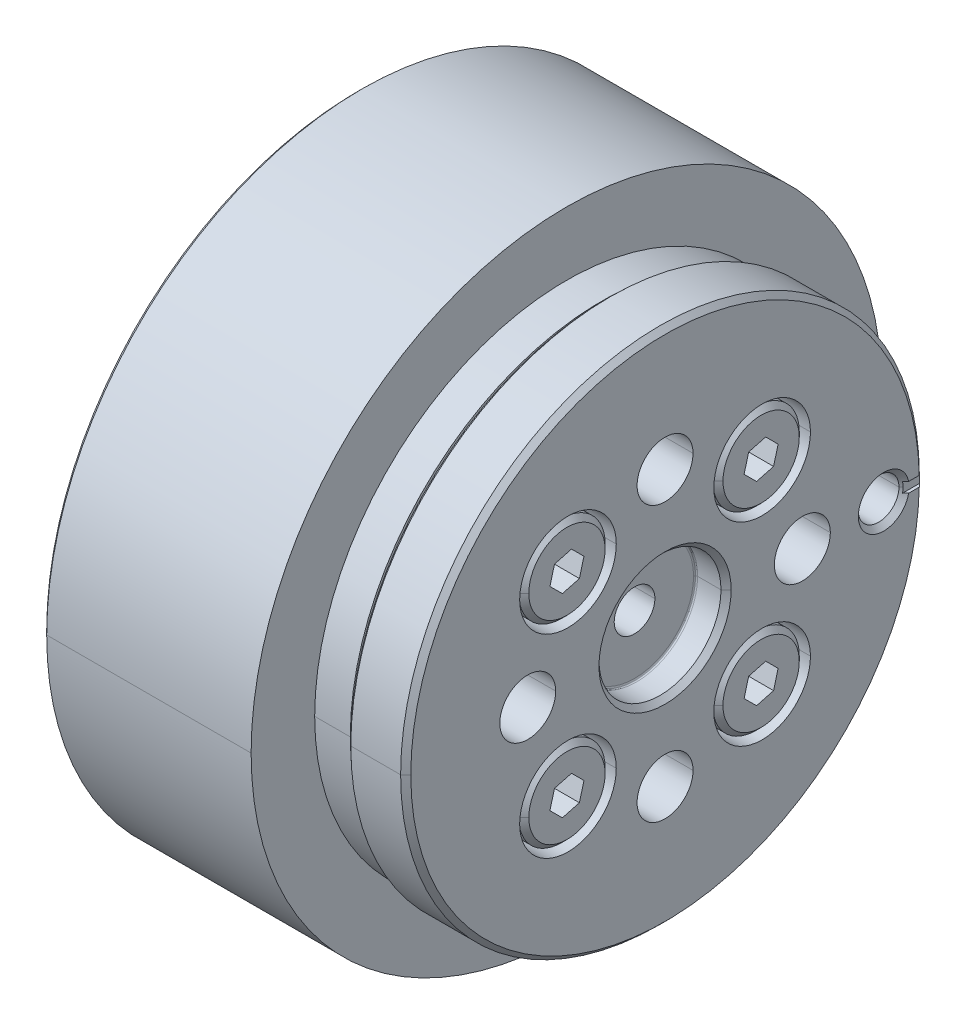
ISO-10303-21;
HEADER;
FILE_DESCRIPTION(('STEP AP214'),'2;1');
FILE_NAME('part.step','',(''),(''),'','','');
FILE_SCHEMA(('AUTOMOTIVE_DESIGN { 1 0 10303 214 1 1 1 1 }'));
ENDSEC;
DATA;
#1=APPLICATION_CONTEXT('core data for automotive mechanical design processes');
#2=APPLICATION_PROTOCOL_DEFINITION('international standard','automotive_design',2000,#1);
#3=PRODUCT_CONTEXT('',#1,'mechanical');
#4=PRODUCT('Part','Part','',(#3));
#5=PRODUCT_RELATED_PRODUCT_CATEGORY('part','',(#4));
#6=PRODUCT_DEFINITION_FORMATION('','',#4);
#7=PRODUCT_DEFINITION_CONTEXT('part definition',#1,'design');
#8=PRODUCT_DEFINITION('design','',#6,#7);
#9=PRODUCT_DEFINITION_SHAPE('','',#8);
#10=(LENGTH_UNIT() NAMED_UNIT(*) SI_UNIT(.MILLI.,.METRE.));
#11=(NAMED_UNIT(*) PLANE_ANGLE_UNIT() SI_UNIT($,.RADIAN.));
#12=(NAMED_UNIT(*) SI_UNIT($,.STERADIAN.) SOLID_ANGLE_UNIT());
#13=UNCERTAINTY_MEASURE_WITH_UNIT(LENGTH_MEASURE(1.E-05),#10,'distance_accuracy_value','');
#14=(GEOMETRIC_REPRESENTATION_CONTEXT(3) GLOBAL_UNCERTAINTY_ASSIGNED_CONTEXT((#13)) GLOBAL_UNIT_ASSIGNED_CONTEXT((#10,
#11,#12)) REPRESENTATION_CONTEXT('',''));
#15=CARTESIAN_POINT('',(0.,0.,0.));
#16=DIRECTION('',(0.,0.,1.));
#17=DIRECTION('',(1.,0.,0.));
#18=AXIS2_PLACEMENT_3D('',#15,#16,#17);
#19=CARTESIAN_POINT('',(0.,0.,0.));
#20=DIRECTION('',(1.,0.,0.));
#21=DIRECTION('',(0.,1.,0.));
#22=AXIS2_PLACEMENT_3D('',#19,#20,#21);
#23=PLANE('',#22);
#24=CARTESIAN_POINT('',(0.,0.,0.));
#25=DIRECTION('',(-1.,0.,0.));
#26=DIRECTION('',(0.,0.,1.));
#27=AXIS2_PLACEMENT_3D('',#24,#25,#26);
#28=CIRCLE('',#27,24.35);
#29=CARTESIAN_POINT('',(0.,0.,24.35));
#30=VERTEX_POINT('',#29);
#31=CARTESIAN_POINT('',(0.,0.,-24.35));
#32=VERTEX_POINT('',#31);
#33=EDGE_CURVE('E10',#30,#32,#28,.T.);
#34=ORIENTED_EDGE('',*,*,#33,.T.);
#35=CARTESIAN_POINT('',(0.,0.,0.));
#36=DIRECTION('',(-1.,0.,0.));
#37=DIRECTION('',(0.,0.,-1.));
#38=AXIS2_PLACEMENT_3D('',#35,#36,#37);
#39=CIRCLE('',#38,24.35);
#40=EDGE_CURVE('E26',#32,#30,#39,.T.);
#41=ORIENTED_EDGE('',*,*,#40,.T.);
#42=EDGE_LOOP('',(#34,#41));
#43=FACE_BOUND('',#42,.T.);
#44=CARTESIAN_POINT('',(0.,0.,0.));
#45=DIRECTION('',(1.,0.,0.));
#46=DIRECTION('',(0.,0.,1.));
#47=AXIS2_PLACEMENT_3D('',#44,#45,#46);
#48=CIRCLE('',#47,21.);
#49=CARTESIAN_POINT('',(0.,0.,21.));
#50=VERTEX_POINT('',#49);
#51=CARTESIAN_POINT('',(0.,0.,-21.));
#52=VERTEX_POINT('',#51);
#53=EDGE_CURVE('E1107',#50,#52,#48,.T.);
#54=ORIENTED_EDGE('',*,*,#53,.T.);
#55=CARTESIAN_POINT('',(0.,0.,0.));
#56=DIRECTION('',(1.,0.,0.));
#57=DIRECTION('',(0.,0.,-1.));
#58=AXIS2_PLACEMENT_3D('',#55,#56,#57);
#59=CIRCLE('',#58,21.);
#60=EDGE_CURVE('E1464',#52,#50,#59,.T.);
#61=ORIENTED_EDGE('',*,*,#60,.T.);
#62=EDGE_LOOP('',(#54,#61));
#63=FACE_BOUND('',#62,.T.);
#64=ADVANCED_FACE('F15',(#43,#63),#23,.F.);
#65=CARTESIAN_POINT('',(0.2,0.,0.));
#66=DIRECTION('',(1.,0.,0.));
#67=DIRECTION('',(0.,0.,-1.));
#68=AXIS2_PLACEMENT_3D('',#65,#66,#67);
#69=CONICAL_SURFACE('',#68,24.55,0.7853981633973);
#70=DIRECTION('',(0.707106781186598,0.,0.707106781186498));
#71=VECTOR('',#70,1.);
#72=CARTESIAN_POINT('',(0.,0.,24.35));
#73=LINE('',#72,#71);
#74=CARTESIAN_POINT('',(0.4,0.,24.75));
#75=VERTEX_POINT('',#74);
#76=EDGE_CURVE('E1296',#30,#75,#73,.T.);
#77=ORIENTED_EDGE('',*,*,#76,.F.);
#78=ORIENTED_EDGE('',*,*,#40,.F.);
#79=DIRECTION('',(0.707106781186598,0.,-0.707106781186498));
#80=VECTOR('',#79,1.);
#81=CARTESIAN_POINT('',(0.,0.,-24.35));
#82=LINE('',#81,#80);
#83=CARTESIAN_POINT('',(0.4,0.,-24.75));
#84=VERTEX_POINT('',#83);
#85=EDGE_CURVE('E1299',#32,#84,#82,.T.);
#86=ORIENTED_EDGE('',*,*,#85,.T.);
#87=CARTESIAN_POINT('',(0.4,0.,0.));
#88=DIRECTION('',(-1.,0.,0.));
#89=DIRECTION('',(0.,0.,-1.));
#90=AXIS2_PLACEMENT_3D('',#87,#88,#89);
#91=CIRCLE('',#90,24.75);
#92=EDGE_CURVE('E1291',#84,#75,#91,.T.);
#93=ORIENTED_EDGE('',*,*,#92,.T.);
#94=EDGE_LOOP('',(#77,#78,#86,#93));
#95=FACE_BOUND('',#94,.T.);
#96=ADVANCED_FACE('F1245',(#95),#69,.T.);
#97=CARTESIAN_POINT('',(24.5,0.,0.));
#98=DIRECTION('',(1.,0.,0.));
#99=DIRECTION('',(0.,0.,-1.));
#100=AXIS2_PLACEMENT_3D('',#97,#98,#99);
#101=CYLINDRICAL_SURFACE('',#100,24.75);
#102=DIRECTION('',(1.,0.,0.));
#103=VECTOR('',#102,1.);
#104=CARTESIAN_POINT('',(0.4,0.,24.75));
#105=LINE('',#104,#103);
#106=CARTESIAN_POINT('',(2.,0.,24.75));
#107=VERTEX_POINT('',#106);
#108=EDGE_CURVE('E849',#75,#107,#105,.T.);
#109=ORIENTED_EDGE('',*,*,#108,.F.);
#110=ORIENTED_EDGE('',*,*,#92,.F.);
#111=DIRECTION('',(1.,0.,0.));
#112=VECTOR('',#111,1.);
#113=CARTESIAN_POINT('',(0.4,0.,-24.75));
#114=LINE('',#113,#112);
#115=CARTESIAN_POINT('',(2.,0.,-24.75));
#116=VERTEX_POINT('',#115);
#117=EDGE_CURVE('E1302',#84,#116,#114,.T.);
#118=ORIENTED_EDGE('',*,*,#117,.T.);
#119=CARTESIAN_POINT('',(2.,0.,0.));
#120=DIRECTION('',(1.,0.,0.));
#121=DIRECTION('',(0.,0.,1.));
#122=AXIS2_PLACEMENT_3D('',#119,#120,#121);
#123=CIRCLE('',#122,24.75);
#124=EDGE_CURVE('E813',#107,#116,#123,.T.);
#125=ORIENTED_EDGE('',*,*,#124,.F.);
#126=EDGE_LOOP('',(#109,#110,#118,#125));
#127=FACE_BOUND('',#126,.T.);
#128=ADVANCED_FACE('F1252',(#127),#101,.T.);
#129=CARTESIAN_POINT('',(2.,24.75,0.));
#130=DIRECTION('',(1.,0.,0.));
#131=DIRECTION('',(0.,1.,0.));
#132=AXIS2_PLACEMENT_3D('',#129,#130,#131);
#133=PLANE('',#132);
#134=CARTESIAN_POINT('',(2.,0.,0.));
#135=DIRECTION('',(-1.,0.,0.));
#136=DIRECTION('',(0.,0.,1.));
#137=AXIS2_PLACEMENT_3D('',#134,#135,#136);
#138=CIRCLE('',#137,30.6);
#139=CARTESIAN_POINT('',(2.,0.,30.6));
#140=VERTEX_POINT('',#139);
#141=CARTESIAN_POINT('',(2.,0.,-30.6));
#142=VERTEX_POINT('',#141);
#143=EDGE_CURVE('E1345',#140,#142,#138,.T.);
#144=ORIENTED_EDGE('',*,*,#143,.T.);
#145=CARTESIAN_POINT('',(2.,0.,0.));
#146=DIRECTION('',(-1.,0.,0.));
#147=DIRECTION('',(0.,0.,-1.));
#148=AXIS2_PLACEMENT_3D('',#145,#146,#147);
#149=CIRCLE('',#148,30.6);
#150=EDGE_CURVE('E817',#142,#140,#149,.T.);
#151=ORIENTED_EDGE('',*,*,#150,.T.);
#152=EDGE_LOOP('',(#144,#151));
#153=FACE_BOUND('',#152,.T.);
#154=ORIENTED_EDGE('',*,*,#124,.T.);
#155=CARTESIAN_POINT('',(2.,0.,0.));
#156=DIRECTION('',(1.,0.,0.));
#157=DIRECTION('',(0.,0.,-1.));
#158=AXIS2_PLACEMENT_3D('',#155,#156,#157);
#159=CIRCLE('',#158,24.75);
#160=EDGE_CURVE('E818',#116,#107,#159,.T.);
#161=ORIENTED_EDGE('',*,*,#160,.T.);
#162=EDGE_LOOP('',(#154,#161));
#163=FACE_BOUND('',#162,.T.);
#164=ADVANCED_FACE('F1277',(#153,#163),#133,.F.);
#165=CARTESIAN_POINT('',(2.2,0.,0.));
#166=DIRECTION('',(1.,0.,0.));
#167=DIRECTION('',(0.,0.,-1.));
#168=AXIS2_PLACEMENT_3D('',#165,#166,#167);
#169=CONICAL_SURFACE('',#168,30.8,0.7853981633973);
#170=DIRECTION('',(0.707106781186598,0.,0.707106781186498));
#171=VECTOR('',#170,1.);
#172=CARTESIAN_POINT('',(2.,0.,30.6));
#173=LINE('',#172,#171);
#174=CARTESIAN_POINT('',(2.4,0.,31.));
#175=VERTEX_POINT('',#174);
#176=EDGE_CURVE('E848',#140,#175,#173,.T.);
#177=ORIENTED_EDGE('',*,*,#176,.F.);
#178=ORIENTED_EDGE('',*,*,#150,.F.);
#179=DIRECTION('',(0.707106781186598,0.,-0.707106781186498));
#180=VECTOR('',#179,1.);
#181=CARTESIAN_POINT('',(2.,0.,-30.6));
#182=LINE('',#181,#180);
#183=CARTESIAN_POINT('',(2.4,0.,-31.));
#184=VERTEX_POINT('',#183);
#185=EDGE_CURVE('E874',#142,#184,#182,.T.);
#186=ORIENTED_EDGE('',*,*,#185,.T.);
#187=CARTESIAN_POINT('',(2.4,0.,0.));
#188=DIRECTION('',(-1.,0.,0.));
#189=DIRECTION('',(0.,0.,-1.));
#190=AXIS2_PLACEMENT_3D('',#187,#188,#189);
#191=CIRCLE('',#190,31.);
#192=EDGE_CURVE('E999',#184,#175,#191,.T.);
#193=ORIENTED_EDGE('',*,*,#192,.T.);
#194=EDGE_LOOP('',(#177,#178,#186,#193));
#195=FACE_BOUND('',#194,.T.);
#196=ADVANCED_FACE('F1283',(#195),#169,.T.);
#197=CARTESIAN_POINT('',(24.5,0.,0.));
#198=DIRECTION('',(1.,0.,0.));
#199=DIRECTION('',(0.,0.,-1.));
#200=AXIS2_PLACEMENT_3D('',#197,#198,#199);
#201=CYLINDRICAL_SURFACE('',#200,31.);
#202=DIRECTION('',(1.,0.,0.));
#203=VECTOR('',#202,1.);
#204=CARTESIAN_POINT('',(2.4,0.,31.));
#205=LINE('',#204,#203);
#206=CARTESIAN_POINT('',(22.5,0.,31.));
#207=VERTEX_POINT('',#206);
#208=EDGE_CURVE('E1175',#175,#207,#205,.T.);
#209=ORIENTED_EDGE('',*,*,#208,.F.);
#210=ORIENTED_EDGE('',*,*,#192,.F.);
#211=DIRECTION('',(1.,0.,0.));
#212=VECTOR('',#211,1.);
#213=CARTESIAN_POINT('',(2.4,0.,-31.));
#214=LINE('',#213,#212);
#215=CARTESIAN_POINT('',(22.5,0.,-31.));
#216=VERTEX_POINT('',#215);
#217=EDGE_CURVE('E1169',#184,#216,#214,.T.);
#218=ORIENTED_EDGE('',*,*,#217,.T.);
#219=CARTESIAN_POINT('',(22.5,0.,0.));
#220=DIRECTION('',(1.,0.,0.));
#221=DIRECTION('',(0.,0.,1.));
#222=AXIS2_PLACEMENT_3D('',#219,#220,#221);
#223=CIRCLE('',#222,31.);
#224=EDGE_CURVE('E1166',#207,#216,#223,.T.);
#225=ORIENTED_EDGE('',*,*,#224,.F.);
#226=EDGE_LOOP('',(#209,#210,#218,#225));
#227=FACE_BOUND('',#226,.T.);
#228=ADVANCED_FACE('F2111',(#227),#201,.T.);
#229=CARTESIAN_POINT('',(22.5,31.,0.));
#230=DIRECTION('',(-1.,0.,0.));
#231=DIRECTION('',(0.,0.,1.));
#232=AXIS2_PLACEMENT_3D('',#229,#230,#231);
#233=PLANE('',#232);
#234=ORIENTED_EDGE('',*,*,#224,.T.);
#235=CARTESIAN_POINT('',(22.5,0.,0.));
#236=DIRECTION('',(1.,0.,0.));
#237=DIRECTION('',(0.,0.,-1.));
#238=AXIS2_PLACEMENT_3D('',#235,#236,#237);
#239=CIRCLE('',#238,31.);
#240=EDGE_CURVE('E1170',#216,#207,#239,.T.);
#241=ORIENTED_EDGE('',*,*,#240,.T.);
#242=EDGE_LOOP('',(#234,#241));
#243=FACE_BOUND('',#242,.T.);
#244=CARTESIAN_POINT('',(22.5,0.,0.));
#245=DIRECTION('',(-1.,0.,0.));
#246=DIRECTION('',(0.,0.,1.));
#247=AXIS2_PLACEMENT_3D('',#244,#245,#246);
#248=CIRCLE('',#247,24.75);
#249=CARTESIAN_POINT('',(22.5,0.,24.75));
#250=VERTEX_POINT('',#249);
#251=CARTESIAN_POINT('',(22.5,0.,-24.75));
#252=VERTEX_POINT('',#251);
#253=EDGE_CURVE('E1352',#250,#252,#248,.T.);
#254=ORIENTED_EDGE('',*,*,#253,.T.);
#255=CARTESIAN_POINT('',(22.5,0.,0.));
#256=DIRECTION('',(-1.,0.,0.));
#257=DIRECTION('',(0.,0.,-1.));
#258=AXIS2_PLACEMENT_3D('',#255,#256,#257);
#259=CIRCLE('',#258,24.75);
#260=EDGE_CURVE('E1356',#252,#250,#259,.T.);
#261=ORIENTED_EDGE('',*,*,#260,.T.);
#262=EDGE_LOOP('',(#254,#261));
#263=FACE_BOUND('',#262,.T.);
#264=ADVANCED_FACE('F3425',(#243,#263),#233,.F.);
#265=CARTESIAN_POINT('',(24.5,0.,0.));
#266=DIRECTION('',(1.,0.,0.));
#267=DIRECTION('',(0.,0.,-1.));
#268=AXIS2_PLACEMENT_3D('',#265,#266,#267);
#269=CYLINDRICAL_SURFACE('',#268,24.75);
#270=DIRECTION('',(1.,0.,0.));
#271=VECTOR('',#270,1.);
#272=CARTESIAN_POINT('',(22.5,0.,24.75));
#273=LINE('',#272,#271);
#274=CARTESIAN_POINT('',(26.,0.,24.75));
#275=VERTEX_POINT('',#274);
#276=EDGE_CURVE('E1171',#250,#275,#273,.T.);
#277=ORIENTED_EDGE('',*,*,#276,.F.);
#278=ORIENTED_EDGE('',*,*,#260,.F.);
#279=DIRECTION('',(1.,0.,0.));
#280=VECTOR('',#279,1.);
#281=CARTESIAN_POINT('',(22.5,0.,-24.75));
#282=LINE('',#281,#280);
#283=CARTESIAN_POINT('',(26.,0.,-24.75));
#284=VERTEX_POINT('',#283);
#285=EDGE_CURVE('E1069',#252,#284,#282,.T.);
#286=ORIENTED_EDGE('',*,*,#285,.T.);
#287=CARTESIAN_POINT('',(26.,0.,0.));
#288=DIRECTION('',(1.,0.,0.));
#289=DIRECTION('',(0.,0.,1.));
#290=AXIS2_PLACEMENT_3D('',#287,#288,#289);
#291=CIRCLE('',#290,24.75);
#292=EDGE_CURVE('E1065',#275,#284,#291,.T.);
#293=ORIENTED_EDGE('',*,*,#292,.F.);
#294=EDGE_LOOP('',(#277,#278,#286,#293));
#295=FACE_BOUND('',#294,.T.);
#296=ADVANCED_FACE('F2024',(#295),#269,.T.);
#297=CARTESIAN_POINT('',(26.,24.75,0.));
#298=DIRECTION('',(-1.,0.,0.));
#299=DIRECTION('',(0.,0.,1.));
#300=AXIS2_PLACEMENT_3D('',#297,#298,#299);
#301=PLANE('',#300);
#302=ORIENTED_EDGE('',*,*,#292,.T.);
#303=CARTESIAN_POINT('',(26.,0.,0.));
#304=DIRECTION('',(1.,0.,0.));
#305=DIRECTION('',(0.,0.,-1.));
#306=AXIS2_PLACEMENT_3D('',#303,#304,#305);
#307=CIRCLE('',#306,24.75);
#308=EDGE_CURVE('E1070',#284,#275,#307,.T.);
#309=ORIENTED_EDGE('',*,*,#308,.T.);
#310=EDGE_LOOP('',(#302,#309));
#311=FACE_BOUND('',#310,.T.);
#312=CARTESIAN_POINT('',(26.,0.,0.));
#313=DIRECTION('',(-1.,0.,0.));
#314=DIRECTION('',(0.,0.,1.));
#315=AXIS2_PLACEMENT_3D('',#312,#313,#314);
#316=CIRCLE('',#315,19.);
#317=CARTESIAN_POINT('',(26.,0.,19.));
#318=VERTEX_POINT('',#317);
#319=CARTESIAN_POINT('',(26.,0.,-19.));
#320=VERTEX_POINT('',#319);
#321=EDGE_CURVE('E1430',#318,#320,#316,.T.);
#322=ORIENTED_EDGE('',*,*,#321,.T.);
#323=CARTESIAN_POINT('',(26.,0.,0.));
#324=DIRECTION('',(-1.,0.,0.));
#325=DIRECTION('',(0.,0.,-1.));
#326=AXIS2_PLACEMENT_3D('',#323,#324,#325);
#327=CIRCLE('',#326,19.);
#328=EDGE_CURVE('E1541',#320,#318,#327,.T.);
#329=ORIENTED_EDGE('',*,*,#328,.T.);
#330=EDGE_LOOP('',(#322,#329));
#331=FACE_BOUND('',#330,.T.);
#332=ADVANCED_FACE('F1703',(#311,#331),#301,.F.);
#333=CARTESIAN_POINT('',(24.5,0.,0.));
#334=DIRECTION('',(1.,0.,0.));
#335=DIRECTION('',(0.,0.,-1.));
#336=AXIS2_PLACEMENT_3D('',#333,#334,#335);
#337=CYLINDRICAL_SURFACE('',#336,19.);
#338=DIRECTION('',(1.,0.,0.));
#339=VECTOR('',#338,1.);
#340=CARTESIAN_POINT('',(26.,0.,19.));
#341=LINE('',#340,#339);
#342=CARTESIAN_POINT('',(26.5,0.,19.));
#343=VERTEX_POINT('',#342);
#344=EDGE_CURVE('E946',#318,#343,#341,.T.);
#345=ORIENTED_EDGE('',*,*,#344,.F.);
#346=ORIENTED_EDGE('',*,*,#328,.F.);
#347=DIRECTION('',(1.,0.,0.));
#348=VECTOR('',#347,1.);
#349=CARTESIAN_POINT('',(26.,0.,-19.));
#350=LINE('',#349,#348);
#351=CARTESIAN_POINT('',(26.5,0.,-19.));
#352=VERTEX_POINT('',#351);
#353=EDGE_CURVE('E1545',#320,#352,#350,.T.);
#354=ORIENTED_EDGE('',*,*,#353,.T.);
#355=CARTESIAN_POINT('',(26.5,0.,0.));
#356=DIRECTION('',(1.,0.,0.));
#357=DIRECTION('',(0.,0.,1.));
#358=AXIS2_PLACEMENT_3D('',#355,#356,#357);
#359=CIRCLE('',#358,19.);
#360=EDGE_CURVE('E719',#343,#352,#359,.T.);
#361=ORIENTED_EDGE('',*,*,#360,.F.);
#362=EDGE_LOOP('',(#345,#346,#354,#361));
#363=FACE_BOUND('',#362,.T.);
#364=ADVANCED_FACE('F1714',(#363),#337,.T.);
#365=CARTESIAN_POINT('',(26.5,19.,0.));
#366=DIRECTION('',(1.,0.,0.));
#367=DIRECTION('',(0.,1.,0.));
#368=AXIS2_PLACEMENT_3D('',#365,#366,#367);
#369=PLANE('',#368);
#370=CARTESIAN_POINT('',(26.5,0.,0.));
#371=DIRECTION('',(-1.,0.,0.));
#372=DIRECTION('',(0.,0.,1.));
#373=AXIS2_PLACEMENT_3D('',#370,#371,#372);
#374=CIRCLE('',#373,25.2);
#375=CARTESIAN_POINT('',(26.5,0.,25.2));
#376=VERTEX_POINT('',#375);
#377=CARTESIAN_POINT('',(26.5,0.,-25.2));
#378=VERTEX_POINT('',#377);
#379=EDGE_CURVE('E2202',#376,#378,#374,.T.);
#380=ORIENTED_EDGE('',*,*,#379,.T.);
#381=CARTESIAN_POINT('',(26.5,0.,0.));
#382=DIRECTION('',(-1.,0.,0.));
#383=DIRECTION('',(0.,0.,-1.));
#384=AXIS2_PLACEMENT_3D('',#381,#382,#383);
#385=CIRCLE('',#384,25.2);
#386=EDGE_CURVE('E1043',#378,#376,#385,.T.);
#387=ORIENTED_EDGE('',*,*,#386,.T.);
#388=EDGE_LOOP('',(#380,#387));
#389=FACE_BOUND('',#388,.T.);
#390=ORIENTED_EDGE('',*,*,#360,.T.);
#391=CARTESIAN_POINT('',(26.5,0.,0.));
#392=DIRECTION('',(1.,0.,0.));
#393=DIRECTION('',(0.,0.,-1.));
#394=AXIS2_PLACEMENT_3D('',#391,#392,#393);
#395=CIRCLE('',#394,19.);
#396=EDGE_CURVE('E715',#352,#343,#395,.T.);
#397=ORIENTED_EDGE('',*,*,#396,.T.);
#398=EDGE_LOOP('',(#390,#397));
#399=FACE_BOUND('',#398,.T.);
#400=ADVANCED_FACE('F1716',(#389,#399),#369,.F.);
#401=CARTESIAN_POINT('',(26.65,0.,0.));
#402=DIRECTION('',(1.,0.,0.));
#403=DIRECTION('',(0.,0.,-1.));
#404=AXIS2_PLACEMENT_3D('',#401,#402,#403);
#405=CONICAL_SURFACE('',#404,25.35,0.7853981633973);
#406=DIRECTION('',(0.707106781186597,0.,0.707106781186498));
#407=VECTOR('',#406,1.);
#408=CARTESIAN_POINT('',(26.5,0.,25.2));
#409=LINE('',#408,#407);
#410=CARTESIAN_POINT('',(26.8,0.,25.5));
#411=VERTEX_POINT('',#410);
#412=EDGE_CURVE('E1511',#376,#411,#409,.T.);
#413=ORIENTED_EDGE('',*,*,#412,.F.);
#414=ORIENTED_EDGE('',*,*,#386,.F.);
#415=DIRECTION('',(0.707106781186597,0.,-0.707106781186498));
#416=VECTOR('',#415,1.);
#417=CARTESIAN_POINT('',(26.5,0.,-25.2));
#418=LINE('',#417,#416);
#419=CARTESIAN_POINT('',(26.8,0.,-25.5));
#420=VERTEX_POINT('',#419);
#421=EDGE_CURVE('E720',#378,#420,#418,.T.);
#422=ORIENTED_EDGE('',*,*,#421,.T.);
#423=CARTESIAN_POINT('',(26.8,0.,0.));
#424=DIRECTION('',(-1.,0.,0.));
#425=DIRECTION('',(0.,0.,-1.));
#426=AXIS2_PLACEMENT_3D('',#423,#424,#425);
#427=CIRCLE('',#426,25.5);
#428=EDGE_CURVE('E837',#420,#411,#427,.T.);
#429=ORIENTED_EDGE('',*,*,#428,.T.);
#430=EDGE_LOOP('',(#413,#414,#422,#429));
#431=FACE_BOUND('',#430,.T.);
#432=ADVANCED_FACE('F1718',(#431),#405,.T.);
#433=CARTESIAN_POINT('',(24.5,0.,0.));
#434=DIRECTION('',(1.,0.,0.));
#435=DIRECTION('',(0.,0.,-1.));
#436=AXIS2_PLACEMENT_3D('',#433,#434,#435);
#437=CYLINDRICAL_SURFACE('',#436,25.5);
#438=DIRECTION('',(1.,0.,0.));
#439=VECTOR('',#438,1.);
#440=CARTESIAN_POINT('',(26.8,0.,25.5));
#441=LINE('',#440,#439);
#442=CARTESIAN_POINT('',(31.7,0.,25.5));
#443=VERTEX_POINT('',#442);
#444=EDGE_CURVE('E1138',#411,#443,#441,.T.);
#445=ORIENTED_EDGE('',*,*,#444,.F.);
#446=ORIENTED_EDGE('',*,*,#428,.F.);
#447=DIRECTION('',(1.,0.,0.));
#448=VECTOR('',#447,1.);
#449=CARTESIAN_POINT('',(26.8,0.,-25.5));
#450=LINE('',#449,#448);
#451=CARTESIAN_POINT('',(31.7,0.,-25.5));
#452=VERTEX_POINT('',#451);
#453=EDGE_CURVE('E1379',#420,#452,#450,.T.);
#454=ORIENTED_EDGE('',*,*,#453,.T.);
#455=CARTESIAN_POINT('',(31.7,0.,0.));
#456=DIRECTION('',(1.,0.,0.));
#457=DIRECTION('',(0.,0.,1.));
#458=AXIS2_PLACEMENT_3D('',#455,#456,#457);
#459=CIRCLE('',#458,25.5);
#460=EDGE_CURVE('E1092',#443,#452,#459,.T.);
#461=ORIENTED_EDGE('',*,*,#460,.F.);
#462=EDGE_LOOP('',(#445,#446,#454,#461));
#463=FACE_BOUND('',#462,.T.);
#464=ADVANCED_FACE('F1263',(#463),#437,.T.);
#465=CARTESIAN_POINT('',(31.95,0.,0.));
#466=DIRECTION('',(-1.,0.,0.));
#467=DIRECTION('',(0.,0.,1.));
#468=AXIS2_PLACEMENT_3D('',#465,#466,#467);
#469=CONICAL_SURFACE('',#468,25.25,0.7853981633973);
#470=DIRECTION('',(-0.707106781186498,0.,0.707106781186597));
#471=VECTOR('',#470,1.);
#472=CARTESIAN_POINT('',(32.2,0.,25.));
#473=LINE('',#472,#471);
#474=CARTESIAN_POINT('',(32.2,0.,25.));
#475=VERTEX_POINT('',#474);
#476=EDGE_CURVE('E1375',#475,#443,#473,.T.);
#477=ORIENTED_EDGE('',*,*,#476,.T.);
#478=ORIENTED_EDGE('',*,*,#460,.T.);
#479=DIRECTION('',(-0.707106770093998,0.,-0.707106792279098));
#480=VECTOR('',#479,1.);
#481=CARTESIAN_POINT('',(31.9,0.,-25.29999999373));
#482=LINE('',#481,#480);
#483=CARTESIAN_POINT('',(31.9,0.,-25.29999999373));
#484=VERTEX_POINT('',#483);
#485=EDGE_CURVE('E1020',#484,#452,#482,.T.);
#486=ORIENTED_EDGE('',*,*,#485,.F.);
#487=CARTESIAN_POINT('',(31.9,0.,0.));
#488=DIRECTION('',(1.,0.,0.));
#489=DIRECTION('',(0.,-0.0197628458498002,-0.999804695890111));
#490=AXIS2_PLACEMENT_3D('',#487,#488,#489);
#491=CIRCLE('',#490,25.3);
#492=CARTESIAN_POINT('',(31.9,-0.5,-25.29505880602));
#493=VERTEX_POINT('',#492);
#494=EDGE_CURVE('E742',#493,#484,#491,.T.);
#495=ORIENTED_EDGE('',*,*,#494,.F.);
#496=CARTESIAN_POINT('',(31.9,-0.5,-25.29505880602));
#497=CARTESIAN_POINT('',(31.93333335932,-0.5,-25.26171893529));
#498=CARTESIAN_POINT('',(32.00000006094,-0.5,-25.19503915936));
#499=CARTESIAN_POINT('',(32.10000006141,-0.5,-25.09501939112));
#500=CARTESIAN_POINT('',(32.16666669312,-0.5,-25.02833947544));
#501=CARTESIAN_POINT('',(32.2,-0.5,-24.9949994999));
#502=(BOUNDED_CURVE() B_SPLINE_CURVE(3,(#496,#497,#498,#499,#500,#501),.UNSPECIFIED.,.F.,
.F.) B_SPLINE_CURVE_WITH_KNOTS((4,1,1,4),(0.,0.3333333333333,0.6666666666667,1.),
.UNSPECIFIED.) CURVE() GEOMETRIC_REPRESENTATION_ITEM() RATIONAL_B_SPLINE_CURVE((1.,1.,1.,1.,1.,1.)) REPRESENTATION_ITEM(''));
#503=CARTESIAN_POINT('',(32.2,-0.5,-24.9949994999));
#504=VERTEX_POINT('',#503);
#505=EDGE_CURVE('E1086',#493,#504,#502,.T.);
#506=ORIENTED_EDGE('',*,*,#505,.T.);
#507=CARTESIAN_POINT('',(32.2,0.,0.));
#508=DIRECTION('',(1.,0.,0.));
#509=DIRECTION('',(0.,0.,1.));
#510=AXIS2_PLACEMENT_3D('',#507,#508,#509);
#511=CIRCLE('',#510,25.);
#512=EDGE_CURVE('E1387',#475,#504,#511,.T.);
#513=ORIENTED_EDGE('',*,*,#512,.F.);
#514=EDGE_LOOP('',(#477,#478,#486,#495,#506,#513));
#515=FACE_BOUND('',#514,.T.);
#516=ADVANCED_FACE('F1259',(#515),#469,.T.);
#517=CARTESIAN_POINT('',(32.2,25.,0.));
#518=DIRECTION('',(-1.,0.,0.));
#519=DIRECTION('',(0.,0.,1.));
#520=AXIS2_PLACEMENT_3D('',#517,#518,#519);
#521=PLANE('',#520);
#522=CARTESIAN_POINT('',(32.2,0.,-21.5));
#523=DIRECTION('',(-1.,0.,0.));
#524=DIRECTION('',(0.,0.,1.));
#525=AXIS2_PLACEMENT_3D('',#522,#523,#524);
#526=CIRCLE('',#525,2.5);
#527=CARTESIAN_POINT('',(32.2,0.,-19.));
#528=VERTEX_POINT('',#527);
#529=CARTESIAN_POINT('',(32.2,0.5,-23.94948974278));
#530=VERTEX_POINT('',#529);
#531=EDGE_CURVE('E774',#528,#530,#526,.T.);
#532=ORIENTED_EDGE('',*,*,#531,.T.);
#533=DIRECTION('',(0.,0.,-1.));
#534=VECTOR('',#533,1.);
#535=CARTESIAN_POINT('',(32.2,0.5,-23.94948974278));
#536=LINE('',#535,#534);
#537=CARTESIAN_POINT('',(32.2,0.5,-24.9949994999));
#538=VERTEX_POINT('',#537);
#539=EDGE_CURVE('E770',#530,#538,#536,.T.);
#540=ORIENTED_EDGE('',*,*,#539,.T.);
#541=CARTESIAN_POINT('',(32.2,0.,0.));
#542=DIRECTION('',(1.,0.,0.));
#543=DIRECTION('',(0.,0.02,-0.999799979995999));
#544=AXIS2_PLACEMENT_3D('',#541,#542,#543);
#545=CIRCLE('',#544,25.);
#546=EDGE_CURVE('E775',#538,#475,#545,.T.);
#547=ORIENTED_EDGE('',*,*,#546,.T.);
#548=ORIENTED_EDGE('',*,*,#512,.T.);
#549=DIRECTION('',(0.,0.,1.));
#550=VECTOR('',#549,1.);
#551=CARTESIAN_POINT('',(32.2,-0.5,-24.9949994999));
#552=LINE('',#551,#550);
#553=CARTESIAN_POINT('',(32.2,-0.5,-23.94948974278));
#554=VERTEX_POINT('',#553);
#555=EDGE_CURVE('E1390',#504,#554,#552,.T.);
#556=ORIENTED_EDGE('',*,*,#555,.T.);
#557=CARTESIAN_POINT('',(32.2,0.,-21.5));
#558=DIRECTION('',(-1.,0.,0.));
#559=DIRECTION('',(0.,-0.199999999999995,-0.979795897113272));
#560=AXIS2_PLACEMENT_3D('',#557,#558,#559);
#561=CIRCLE('',#560,2.5);
#562=EDGE_CURVE('E1159',#554,#528,#561,.T.);
#563=ORIENTED_EDGE('',*,*,#562,.T.);
#564=EDGE_LOOP('',(#532,#540,#547,#548,#556,#563));
#565=FACE_BOUND('',#564,.T.);
#566=CARTESIAN_POINT('',(32.2,13.5,0.));
#567=DIRECTION('',(-1.,0.,0.));
#568=DIRECTION('',(0.,0.,-1.));
#569=AXIS2_PLACEMENT_3D('',#566,#567,#568);
#570=CIRCLE('',#569,2.75);
#571=CARTESIAN_POINT('',(32.2,13.5,-2.75));
#572=VERTEX_POINT('',#571);
#573=CARTESIAN_POINT('',(32.2,13.5,2.75));
#574=VERTEX_POINT('',#573);
#575=EDGE_CURVE('E1155',#572,#574,#570,.T.);
#576=ORIENTED_EDGE('',*,*,#575,.T.);
#577=CARTESIAN_POINT('',(32.2,13.5,0.));
#578=DIRECTION('',(-1.,0.,0.));
#579=DIRECTION('',(0.,0.,1.));
#580=AXIS2_PLACEMENT_3D('',#577,#578,#579);
#581=CIRCLE('',#580,2.75);
#582=EDGE_CURVE('E1160',#574,#572,#581,.T.);
#583=ORIENTED_EDGE('',*,*,#582,.T.);
#584=EDGE_LOOP('',(#576,#583));
#585=FACE_BOUND('',#584,.T.);
#586=CARTESIAN_POINT('',(32.2,0.,13.5));
#587=DIRECTION('',(-1.,0.,0.));
#588=DIRECTION('',(0.,0.,-1.));
#589=AXIS2_PLACEMENT_3D('',#586,#587,#588);
#590=CIRCLE('',#589,2.75);
#591=CARTESIAN_POINT('',(32.2,0.,10.75));
#592=VERTEX_POINT('',#591);
#593=CARTESIAN_POINT('',(32.2,0.,16.25));
#594=VERTEX_POINT('',#593);
#595=EDGE_CURVE('E1394',#592,#594,#590,.T.);
#596=ORIENTED_EDGE('',*,*,#595,.T.);
#597=CARTESIAN_POINT('',(32.2,0.,13.5));
#598=DIRECTION('',(-1.,0.,0.));
#599=DIRECTION('',(0.,0.,1.));
#600=AXIS2_PLACEMENT_3D('',#597,#598,#599);
#601=CIRCLE('',#600,2.75);
#602=EDGE_CURVE('E1398',#594,#592,#601,.T.);
#603=ORIENTED_EDGE('',*,*,#602,.T.);
#604=EDGE_LOOP('',(#596,#603));
#605=FACE_BOUND('',#604,.T.);
#606=CARTESIAN_POINT('',(32.2,-13.5,0.));
#607=DIRECTION('',(-1.,0.,0.));
#608=DIRECTION('',(0.,0.,-1.));
#609=AXIS2_PLACEMENT_3D('',#606,#607,#608);
#610=CIRCLE('',#609,2.75);
#611=CARTESIAN_POINT('',(32.2,-13.5,-2.75));
#612=VERTEX_POINT('',#611);
#613=CARTESIAN_POINT('',(32.2,-13.5,2.75));
#614=VERTEX_POINT('',#613);
#615=EDGE_CURVE('E1521',#612,#614,#610,.T.);
#616=ORIENTED_EDGE('',*,*,#615,.T.);
#617=CARTESIAN_POINT('',(32.2,-13.5,0.));
#618=DIRECTION('',(-1.,0.,0.));
#619=DIRECTION('',(0.,0.,1.));
#620=AXIS2_PLACEMENT_3D('',#617,#618,#619);
#621=CIRCLE('',#620,2.75);
#622=EDGE_CURVE('E1525',#614,#612,#621,.T.);
#623=ORIENTED_EDGE('',*,*,#622,.T.);
#624=EDGE_LOOP('',(#616,#623));
#625=FACE_BOUND('',#624,.T.);
#626=CARTESIAN_POINT('',(32.2,0.,-13.5));
#627=DIRECTION('',(-1.,0.,0.));
#628=DIRECTION('',(0.,0.,-1.));
#629=AXIS2_PLACEMENT_3D('',#626,#627,#628);
#630=CIRCLE('',#629,2.75);
#631=CARTESIAN_POINT('',(32.2,0.,-16.25));
#632=VERTEX_POINT('',#631);
#633=CARTESIAN_POINT('',(32.2,0.,-10.75));
#634=VERTEX_POINT('',#633);
#635=EDGE_CURVE('E1878',#632,#634,#630,.T.);
#636=ORIENTED_EDGE('',*,*,#635,.T.);
#637=CARTESIAN_POINT('',(32.2,0.,-13.5));
#638=DIRECTION('',(-1.,0.,0.));
#639=DIRECTION('',(0.,0.,1.));
#640=AXIS2_PLACEMENT_3D('',#637,#638,#639);
#641=CIRCLE('',#640,2.75);
#642=EDGE_CURVE('E1074',#634,#632,#641,.T.);
#643=ORIENTED_EDGE('',*,*,#642,.T.);
#644=EDGE_LOOP('',(#636,#643));
#645=FACE_BOUND('',#644,.T.);
#646=CARTESIAN_POINT('',(32.2,0.,0.));
#647=DIRECTION('',(-1.,0.,0.));
#648=DIRECTION('',(0.,0.,1.));
#649=AXIS2_PLACEMENT_3D('',#646,#647,#648);
#650=CIRCLE('',#649,6.5);
#651=CARTESIAN_POINT('',(32.2,0.,6.5));
#652=VERTEX_POINT('',#651);
#653=CARTESIAN_POINT('',(32.2,0.,-6.5));
#654=VERTEX_POINT('',#653);
#655=EDGE_CURVE('E1055',#652,#654,#650,.T.);
#656=ORIENTED_EDGE('',*,*,#655,.T.);
#657=CARTESIAN_POINT('',(32.2,0.,0.));
#658=DIRECTION('',(-1.,0.,0.));
#659=DIRECTION('',(0.,0.,-1.));
#660=AXIS2_PLACEMENT_3D('',#657,#658,#659);
#661=CIRCLE('',#660,6.5);
#662=EDGE_CURVE('E1052',#654,#652,#661,.T.);
#663=ORIENTED_EDGE('',*,*,#662,.T.);
#664=EDGE_LOOP('',(#656,#663));
#665=FACE_BOUND('',#664,.T.);
#666=CARTESIAN_POINT('',(32.2,9.545941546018,9.545941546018));
#667=DIRECTION('',(-1.,0.,0.));
#668=DIRECTION('',(0.,0.,1.));
#669=AXIS2_PLACEMENT_3D('',#666,#667,#668);
#670=CIRCLE('',#669,4.75);
#671=CARTESIAN_POINT('',(32.2,9.545941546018,14.29594154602));
#672=VERTEX_POINT('',#671);
#673=CARTESIAN_POINT('',(32.2,9.545941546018,4.795941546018));
#674=VERTEX_POINT('',#673);
#675=EDGE_CURVE('E1056',#672,#674,#670,.T.);
#676=ORIENTED_EDGE('',*,*,#675,.T.);
#677=CARTESIAN_POINT('',(32.2,9.545941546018,9.545941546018));
#678=DIRECTION('',(-1.,0.,0.));
#679=DIRECTION('',(0.,0.,-1.));
#680=AXIS2_PLACEMENT_3D('',#677,#678,#679);
#681=CIRCLE('',#680,4.75);
#682=EDGE_CURVE('E1060',#674,#672,#681,.T.);
#683=ORIENTED_EDGE('',*,*,#682,.T.);
#684=EDGE_LOOP('',(#676,#683));
#685=FACE_BOUND('',#684,.T.);
#686=CARTESIAN_POINT('',(32.2,-9.545941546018,9.545941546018));
#687=DIRECTION('',(-1.,0.,0.));
#688=DIRECTION('',(0.,0.,1.));
#689=AXIS2_PLACEMENT_3D('',#686,#687,#688);
#690=CIRCLE('',#689,4.75);
#691=CARTESIAN_POINT('',(32.2,-9.545941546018,14.29594154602));
#692=VERTEX_POINT('',#691);
#693=CARTESIAN_POINT('',(32.2,-9.545941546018,4.795941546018));
#694=VERTEX_POINT('',#693);
#695=EDGE_CURVE('E1141',#692,#694,#690,.T.);
#696=ORIENTED_EDGE('',*,*,#695,.T.);
#697=CARTESIAN_POINT('',(32.2,-9.545941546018,9.545941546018));
#698=DIRECTION('',(-1.,0.,0.));
#699=DIRECTION('',(0.,0.,-1.));
#700=AXIS2_PLACEMENT_3D('',#697,#698,#699);
#701=CIRCLE('',#700,4.75);
#702=EDGE_CURVE('E811',#694,#692,#701,.T.);
#703=ORIENTED_EDGE('',*,*,#702,.T.);
#704=EDGE_LOOP('',(#696,#703));
#705=FACE_BOUND('',#704,.T.);
#706=CARTESIAN_POINT('',(32.2,-9.545941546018,-9.545941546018));
#707=DIRECTION('',(-1.,0.,0.));
#708=DIRECTION('',(0.,0.,1.));
#709=AXIS2_PLACEMENT_3D('',#706,#707,#708);
#710=CIRCLE('',#709,4.75);
#711=CARTESIAN_POINT('',(32.2,-9.545941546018,-4.795941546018));
#712=VERTEX_POINT('',#711);
#713=CARTESIAN_POINT('',(32.2,-9.545941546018,-14.29594154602));
#714=VERTEX_POINT('',#713);
#715=EDGE_CURVE('E807',#712,#714,#710,.T.);
#716=ORIENTED_EDGE('',*,*,#715,.T.);
#717=CARTESIAN_POINT('',(32.2,-9.545941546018,-9.545941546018));
#718=DIRECTION('',(-1.,0.,0.));
#719=DIRECTION('',(0.,0.,-1.));
#720=AXIS2_PLACEMENT_3D('',#717,#718,#719);
#721=CIRCLE('',#720,4.75);
#722=EDGE_CURVE('E812',#714,#712,#721,.T.);
#723=ORIENTED_EDGE('',*,*,#722,.T.);
#724=EDGE_LOOP('',(#716,#723));
#725=FACE_BOUND('',#724,.T.);
#726=CARTESIAN_POINT('',(32.2,9.545941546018,-9.545941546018));
#727=DIRECTION('',(-1.,0.,0.));
#728=DIRECTION('',(0.,0.,1.));
#729=AXIS2_PLACEMENT_3D('',#726,#727,#728);
#730=CIRCLE('',#729,4.75);
#731=CARTESIAN_POINT('',(32.2,9.545941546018,-4.795941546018));
#732=VERTEX_POINT('',#731);
#733=CARTESIAN_POINT('',(32.2,9.545941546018,-14.29594154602));
#734=VERTEX_POINT('',#733);
#735=EDGE_CURVE('E1046',#732,#734,#730,.T.);
#736=ORIENTED_EDGE('',*,*,#735,.T.);
#737=CARTESIAN_POINT('',(32.2,9.545941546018,-9.545941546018));
#738=DIRECTION('',(-1.,0.,0.));
#739=DIRECTION('',(0.,0.,-1.));
#740=AXIS2_PLACEMENT_3D('',#737,#738,#739);
#741=CIRCLE('',#740,4.75);
#742=EDGE_CURVE('E950',#734,#732,#741,.T.);
#743=ORIENTED_EDGE('',*,*,#742,.T.);
#744=EDGE_LOOP('',(#736,#743));
#745=FACE_BOUND('',#744,.T.);
#746=ADVANCED_FACE('F1262',(#565,#585,#605,#625,#645,#665,#685,#705,#725,#745),#521,.F.);
#747=CARTESIAN_POINT('',(31.95,0.,0.));
#748=DIRECTION('',(1.,0.,0.));
#749=DIRECTION('',(0.,0.,-1.));
#750=AXIS2_PLACEMENT_3D('',#747,#748,#749);
#751=CONICAL_SURFACE('',#750,6.25,0.7853981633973);
#752=DIRECTION('',(0.707106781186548,0.,0.707106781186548));
#753=VECTOR('',#752,1.);
#754=CARTESIAN_POINT('',(31.7,0.,6.));
#755=LINE('',#754,#753);
#756=CARTESIAN_POINT('',(31.7,0.,6.));
#757=VERTEX_POINT('',#756);
#758=EDGE_CURVE('E899',#757,#652,#755,.T.);
#759=ORIENTED_EDGE('',*,*,#758,.T.);
#760=ORIENTED_EDGE('',*,*,#662,.F.);
#761=DIRECTION('',(0.707106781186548,0.,-0.707106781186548));
#762=VECTOR('',#761,1.);
#763=CARTESIAN_POINT('',(31.7,0.,-6.));
#764=LINE('',#763,#762);
#765=CARTESIAN_POINT('',(31.7,0.,-6.));
#766=VERTEX_POINT('',#765);
#767=EDGE_CURVE('E764',#766,#654,#764,.T.);
#768=ORIENTED_EDGE('',*,*,#767,.F.);
#769=CARTESIAN_POINT('',(31.7,0.,0.));
#770=DIRECTION('',(-1.,0.,0.));
#771=DIRECTION('',(0.,0.,-1.));
#772=AXIS2_PLACEMENT_3D('',#769,#770,#771);
#773=CIRCLE('',#772,6.);
#774=EDGE_CURVE('E895',#766,#757,#773,.T.);
#775=ORIENTED_EDGE('',*,*,#774,.T.);
#776=EDGE_LOOP('',(#759,#760,#768,#775));
#777=FACE_BOUND('',#776,.T.);
#778=ADVANCED_FACE('F1732',(#777),#751,.F.);
#779=CARTESIAN_POINT('',(24.5,0.,0.));
#780=DIRECTION('',(1.,0.,0.));
#781=DIRECTION('',(0.,0.,-1.));
#782=AXIS2_PLACEMENT_3D('',#779,#780,#781);
#783=CYLINDRICAL_SURFACE('',#782,6.);
#784=DIRECTION('',(1.,0.,0.));
#785=VECTOR('',#784,1.);
#786=CARTESIAN_POINT('',(29.4,0.,6.));
#787=LINE('',#786,#785);
#788=CARTESIAN_POINT('',(29.4,0.,6.));
#789=VERTEX_POINT('',#788);
#790=EDGE_CURVE('E900',#789,#757,#787,.T.);
#791=ORIENTED_EDGE('',*,*,#790,.T.);
#792=ORIENTED_EDGE('',*,*,#774,.F.);
#793=DIRECTION('',(1.,0.,0.));
#794=VECTOR('',#793,1.);
#795=CARTESIAN_POINT('',(29.4,0.,-6.));
#796=LINE('',#795,#794);
#797=CARTESIAN_POINT('',(29.4,0.,-6.));
#798=VERTEX_POINT('',#797);
#799=EDGE_CURVE('E768',#798,#766,#796,.T.);
#800=ORIENTED_EDGE('',*,*,#799,.F.);
#801=CARTESIAN_POINT('',(29.4,0.,0.));
#802=DIRECTION('',(1.,0.,0.));
#803=DIRECTION('',(0.,0.,1.));
#804=AXIS2_PLACEMENT_3D('',#801,#802,#803);
#805=CIRCLE('',#804,6.);
#806=EDGE_CURVE('E842',#789,#798,#805,.T.);
#807=ORIENTED_EDGE('',*,*,#806,.F.);
#808=EDGE_LOOP('',(#791,#792,#800,#807));
#809=FACE_BOUND('',#808,.T.);
#810=ADVANCED_FACE('F2050',(#809),#783,.F.);
#811=CARTESIAN_POINT('',(29.4,0.,0.));
#812=DIRECTION('',(1.,0.,0.));
#813=DIRECTION('',(0.,0.,-1.));
#814=AXIS2_PLACEMENT_3D('',#811,#812,#813);
#815=TOROIDAL_SURFACE('',#814,5.8,0.2);
#816=CARTESIAN_POINT('',(29.4,0.,-5.8));
#817=DIRECTION('',(0.,-1.,0.));
#818=DIRECTION('',(-0.707106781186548,0.,-0.707106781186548));
#819=AXIS2_PLACEMENT_3D('',#816,#817,#818);
#820=CIRCLE('',#819,0.2);
#821=CARTESIAN_POINT('',(29.25857864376,0.,-5.941421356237));
#822=VERTEX_POINT('',#821);
#823=EDGE_CURVE('E838',#822,#798,#820,.T.);
#824=ORIENTED_EDGE('',*,*,#823,.F.);
#825=CARTESIAN_POINT('',(29.25857864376,0.,0.));
#826=DIRECTION('',(1.,0.,0.));
#827=DIRECTION('',(0.,0.,1.));
#828=AXIS2_PLACEMENT_3D('',#825,#826,#827);
#829=CIRCLE('',#828,5.941421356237);
#830=CARTESIAN_POINT('',(29.25857864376,0.,5.941421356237));
#831=VERTEX_POINT('',#830);
#832=EDGE_CURVE('E850',#831,#822,#829,.T.);
#833=ORIENTED_EDGE('',*,*,#832,.F.);
#834=CARTESIAN_POINT('',(29.4,0.,5.8));
#835=DIRECTION('',(0.,1.,0.));
#836=DIRECTION('',(-0.707106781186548,0.,0.707106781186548));
#837=AXIS2_PLACEMENT_3D('',#834,#835,#836);
#838=CIRCLE('',#837,0.2);
#839=EDGE_CURVE('E1480',#831,#789,#838,.T.);
#840=ORIENTED_EDGE('',*,*,#839,.T.);
#841=ORIENTED_EDGE('',*,*,#806,.T.);
#842=EDGE_LOOP('',(#824,#833,#840,#841));
#843=FACE_BOUND('',#842,.T.);
#844=ADVANCED_FACE('F2053',(#843),#815,.F.);
#845=CARTESIAN_POINT('',(29.4,0.,0.));
#846=DIRECTION('',(1.,0.,0.));
#847=DIRECTION('',(0.,0.,-1.));
#848=AXIS2_PLACEMENT_3D('',#845,#846,#847);
#849=TOROIDAL_SURFACE('',#848,5.8,0.2);
#850=ORIENTED_EDGE('',*,*,#839,.F.);
#851=CARTESIAN_POINT('',(29.25857864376,0.,0.));
#852=DIRECTION('',(1.,0.,0.));
#853=DIRECTION('',(0.,0.,-1.));
#854=AXIS2_PLACEMENT_3D('',#851,#852,#853);
#855=CIRCLE('',#854,5.941421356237);
#856=EDGE_CURVE('E983',#822,#831,#855,.T.);
#857=ORIENTED_EDGE('',*,*,#856,.F.);
#858=ORIENTED_EDGE('',*,*,#823,.T.);
#859=CARTESIAN_POINT('',(29.4,0.,0.));
#860=DIRECTION('',(1.,0.,0.));
#861=DIRECTION('',(0.,0.,-1.));
#862=AXIS2_PLACEMENT_3D('',#859,#860,#861);
#863=CIRCLE('',#862,6.);
#864=EDGE_CURVE('E843',#798,#789,#863,.T.);
#865=ORIENTED_EDGE('',*,*,#864,.T.);
#866=EDGE_LOOP('',(#850,#857,#858,#865));
#867=FACE_BOUND('',#866,.T.);
#868=ADVANCED_FACE('F3902',(#867),#849,.F.);
#869=CARTESIAN_POINT('',(24.5,0.,0.));
#870=DIRECTION('',(1.,0.,0.));
#871=DIRECTION('',(0.,0.,-1.));
#872=AXIS2_PLACEMENT_3D('',#869,#870,#871);
#873=CYLINDRICAL_SURFACE('',#872,6.);
#874=ORIENTED_EDGE('',*,*,#799,.T.);
#875=CARTESIAN_POINT('',(31.7,0.,0.));
#876=DIRECTION('',(-1.,0.,0.));
#877=DIRECTION('',(0.,0.,1.));
#878=AXIS2_PLACEMENT_3D('',#875,#876,#877);
#879=CIRCLE('',#878,6.);
#880=EDGE_CURVE('E769',#757,#766,#879,.T.);
#881=ORIENTED_EDGE('',*,*,#880,.F.);
#882=ORIENTED_EDGE('',*,*,#790,.F.);
#883=ORIENTED_EDGE('',*,*,#864,.F.);
#884=EDGE_LOOP('',(#874,#881,#882,#883));
#885=FACE_BOUND('',#884,.T.);
#886=ADVANCED_FACE('F2008',(#885),#873,.F.);
#887=CARTESIAN_POINT('',(31.95,0.,0.));
#888=DIRECTION('',(1.,0.,0.));
#889=DIRECTION('',(0.,0.,-1.));
#890=AXIS2_PLACEMENT_3D('',#887,#888,#889);
#891=CONICAL_SURFACE('',#890,6.25,0.7853981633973);
#892=ORIENTED_EDGE('',*,*,#767,.T.);
#893=ORIENTED_EDGE('',*,*,#655,.F.);
#894=ORIENTED_EDGE('',*,*,#758,.F.);
#895=ORIENTED_EDGE('',*,*,#880,.T.);
#896=EDGE_LOOP('',(#892,#893,#894,#895));
#897=FACE_BOUND('',#896,.T.);
#898=ADVANCED_FACE('F1773',(#897),#891,.F.);
#899=CARTESIAN_POINT('',(29.4,0.,0.));
#900=DIRECTION('',(1.,0.,0.));
#901=DIRECTION('',(0.,0.,-1.));
#902=AXIS2_PLACEMENT_3D('',#899,#900,#901);
#903=TOROIDAL_SURFACE('',#902,5.8,0.2);
#904=CARTESIAN_POINT('',(29.4,0.,-5.8));
#905=DIRECTION('',(0.,-1.,0.));
#906=DIRECTION('',(-1.,0.,0.));
#907=AXIS2_PLACEMENT_3D('',#904,#905,#906);
#908=CIRCLE('',#907,0.2);
#909=CARTESIAN_POINT('',(29.2,0.,-5.8));
#910=VERTEX_POINT('',#909);
#911=EDGE_CURVE('E979',#910,#822,#908,.T.);
#912=ORIENTED_EDGE('',*,*,#911,.T.);
#913=ORIENTED_EDGE('',*,*,#856,.T.);
#914=CARTESIAN_POINT('',(29.4,0.,5.8));
#915=DIRECTION('',(0.,1.,0.));
#916=DIRECTION('',(-1.,0.,0.));
#917=AXIS2_PLACEMENT_3D('',#914,#915,#916);
#918=CIRCLE('',#917,0.2);
#919=CARTESIAN_POINT('',(29.2,0.,5.8));
#920=VERTEX_POINT('',#919);
#921=EDGE_CURVE('E854',#920,#831,#918,.T.);
#922=ORIENTED_EDGE('',*,*,#921,.F.);
#923=CARTESIAN_POINT('',(29.2,0.,0.));
#924=DIRECTION('',(1.,0.,0.));
#925=DIRECTION('',(0.,0.,-1.));
#926=AXIS2_PLACEMENT_3D('',#923,#924,#925);
#927=CIRCLE('',#926,5.8);
#928=EDGE_CURVE('E1124',#910,#920,#927,.T.);
#929=ORIENTED_EDGE('',*,*,#928,.F.);
#930=EDGE_LOOP('',(#912,#913,#922,#929));
#931=FACE_BOUND('',#930,.T.);
#932=ADVANCED_FACE('F1769',(#931),#903,.F.);
#933=CARTESIAN_POINT('',(29.2,5.8,0.));
#934=DIRECTION('',(-1.,0.,0.));
#935=DIRECTION('',(0.,0.,1.));
#936=AXIS2_PLACEMENT_3D('',#933,#934,#935);
#937=PLANE('',#936);
#938=CARTESIAN_POINT('',(29.2,0.,0.));
#939=DIRECTION('',(1.,0.,0.));
#940=DIRECTION('',(0.,0.,1.));
#941=AXIS2_PLACEMENT_3D('',#938,#939,#940);
#942=CIRCLE('',#941,5.8);
#943=EDGE_CURVE('E1128',#920,#910,#942,.T.);
#944=ORIENTED_EDGE('',*,*,#943,.T.);
#945=ORIENTED_EDGE('',*,*,#928,.T.);
#946=EDGE_LOOP('',(#944,#945));
#947=FACE_BOUND('',#946,.T.);
#948=CARTESIAN_POINT('',(29.2,0.,0.));
#949=DIRECTION('',(-1.,0.,0.));
#950=DIRECTION('',(0.,0.,1.));
#951=AXIS2_PLACEMENT_3D('',#948,#949,#950);
#952=CIRCLE('',#951,2.);
#953=CARTESIAN_POINT('',(29.2,0.,2.));
#954=VERTEX_POINT('',#953);
#955=CARTESIAN_POINT('',(29.2,0.,-2.));
#956=VERTEX_POINT('',#955);
#957=EDGE_CURVE('E1129',#954,#956,#952,.T.);
#958=ORIENTED_EDGE('',*,*,#957,.T.);
#959=CARTESIAN_POINT('',(29.2,0.,0.));
#960=DIRECTION('',(-1.,0.,0.));
#961=DIRECTION('',(0.,0.,-1.));
#962=AXIS2_PLACEMENT_3D('',#959,#960,#961);
#963=CIRCLE('',#962,2.);
#964=EDGE_CURVE('E1911',#956,#954,#963,.T.);
#965=ORIENTED_EDGE('',*,*,#964,.T.);
#966=EDGE_LOOP('',(#958,#965));
#967=FACE_BOUND('',#966,.T.);
#968=ADVANCED_FACE('F1772',(#947,#967),#937,.F.);
#969=CARTESIAN_POINT('',(24.5,0.,0.));
#970=DIRECTION('',(1.,0.,0.));
#971=DIRECTION('',(0.,0.,-1.));
#972=AXIS2_PLACEMENT_3D('',#969,#970,#971);
#973=CYLINDRICAL_SURFACE('',#972,2.);
#974=DIRECTION('',(1.,0.,0.));
#975=VECTOR('',#974,1.);
#976=CARTESIAN_POINT('',(24.5,0.,2.));
#977=LINE('',#976,#975);
#978=CARTESIAN_POINT('',(24.5,0.,2.));
#979=VERTEX_POINT('',#978);
#980=EDGE_CURVE('E869',#979,#954,#977,.T.);
#981=ORIENTED_EDGE('',*,*,#980,.T.);
#982=ORIENTED_EDGE('',*,*,#964,.F.);
#983=DIRECTION('',(1.,0.,0.));
#984=VECTOR('',#983,1.);
#985=CARTESIAN_POINT('',(24.5,0.,-2.));
#986=LINE('',#985,#984);
#987=CARTESIAN_POINT('',(24.5,0.,-2.));
#988=VERTEX_POINT('',#987);
#989=EDGE_CURVE('E1064',#988,#956,#986,.T.);
#990=ORIENTED_EDGE('',*,*,#989,.F.);
#991=CARTESIAN_POINT('',(24.5,0.,0.));
#992=DIRECTION('',(1.,0.,0.));
#993=DIRECTION('',(0.,0.,1.));
#994=AXIS2_PLACEMENT_3D('',#991,#992,#993);
#995=CIRCLE('',#994,2.);
#996=EDGE_CURVE('E865',#979,#988,#995,.T.);
#997=ORIENTED_EDGE('',*,*,#996,.F.);
#998=EDGE_LOOP('',(#981,#982,#990,#997));
#999=FACE_BOUND('',#998,.T.);
#1000=ADVANCED_FACE('F1968',(#999),#973,.F.);
#1001=CARTESIAN_POINT('',(24.5,2.,0.));
#1002=DIRECTION('',(-1.,0.,0.));
#1003=DIRECTION('',(0.,0.,1.));
#1004=AXIS2_PLACEMENT_3D('',#1001,#1002,#1003);
#1005=PLANE('',#1004);
#1006=ORIENTED_EDGE('',*,*,#996,.T.);
#1007=CARTESIAN_POINT('',(24.5,0.,0.));
#1008=DIRECTION('',(1.,0.,0.));
#1009=DIRECTION('',(0.,0.,-1.));
#1010=AXIS2_PLACEMENT_3D('',#1007,#1008,#1009);
#1011=CIRCLE('',#1010,2.);
#1012=EDGE_CURVE('E870',#988,#979,#1011,.T.);
#1013=ORIENTED_EDGE('',*,*,#1012,.T.);
#1014=EDGE_LOOP('',(#1006,#1013));
#1015=FACE_BOUND('',#1014,.T.);
#1016=ADVANCED_FACE('F1980',(#1015),#1005,.F.);
#1017=CARTESIAN_POINT('',(24.5,0.,0.));
#1018=DIRECTION('',(1.,0.,0.));
#1019=DIRECTION('',(0.,0.,-1.));
#1020=AXIS2_PLACEMENT_3D('',#1017,#1018,#1019);
#1021=CYLINDRICAL_SURFACE('',#1020,2.);
#1022=ORIENTED_EDGE('',*,*,#989,.T.);
#1023=ORIENTED_EDGE('',*,*,#957,.F.);
#1024=ORIENTED_EDGE('',*,*,#980,.F.);
#1025=ORIENTED_EDGE('',*,*,#1012,.F.);
#1026=EDGE_LOOP('',(#1022,#1023,#1024,#1025));
#1027=FACE_BOUND('',#1026,.T.);
#1028=ADVANCED_FACE('F1977',(#1027),#1021,.F.);
#1029=CARTESIAN_POINT('',(29.4,0.,0.));
#1030=DIRECTION('',(1.,0.,0.));
#1031=DIRECTION('',(0.,0.,-1.));
#1032=AXIS2_PLACEMENT_3D('',#1029,#1030,#1031);
#1033=TOROIDAL_SURFACE('',#1032,5.8,0.2);
#1034=ORIENTED_EDGE('',*,*,#921,.T.);
#1035=ORIENTED_EDGE('',*,*,#832,.T.);
#1036=ORIENTED_EDGE('',*,*,#911,.F.);
#1037=ORIENTED_EDGE('',*,*,#943,.F.);
#1038=EDGE_LOOP('',(#1034,#1035,#1036,#1037));
#1039=FACE_BOUND('',#1038,.T.);
#1040=ADVANCED_FACE('F1961',(#1039),#1033,.F.);
#1041=CARTESIAN_POINT('',(18.5,13.5,0.));
#1042=DIRECTION('',(-1.,0.,0.));
#1043=DIRECTION('',(0.,0.,1.));
#1044=AXIS2_PLACEMENT_3D('',#1041,#1042,#1043);
#1045=CYLINDRICAL_SURFACE('',#1044,2.75);
#1046=DIRECTION('',(-1.,0.,0.));
#1047=VECTOR('',#1046,1.);
#1048=CARTESIAN_POINT('',(32.2,13.5,-2.75));
#1049=LINE('',#1048,#1047);
#1050=CARTESIAN_POINT('',(26.5,13.5,-2.75));
#1051=VERTEX_POINT('',#1050);
#1052=EDGE_CURVE('E727',#572,#1051,#1049,.T.);
#1053=ORIENTED_EDGE('',*,*,#1052,.F.);
#1054=ORIENTED_EDGE('',*,*,#582,.F.);
#1055=DIRECTION('',(-1.,0.,0.));
#1056=VECTOR('',#1055,1.);
#1057=CARTESIAN_POINT('',(32.2,13.5,2.75));
#1058=LINE('',#1057,#1056);
#1059=CARTESIAN_POINT('',(26.5,13.5,2.75));
#1060=VERTEX_POINT('',#1059);
#1061=EDGE_CURVE('E855',#574,#1060,#1058,.T.);
#1062=ORIENTED_EDGE('',*,*,#1061,.T.);
#1063=CARTESIAN_POINT('',(26.5,13.5,0.));
#1064=DIRECTION('',(1.,0.,0.));
#1065=DIRECTION('',(0.,0.,-1.));
#1066=AXIS2_PLACEMENT_3D('',#1063,#1064,#1065);
#1067=CIRCLE('',#1066,2.75);
#1068=EDGE_CURVE('E1078',#1051,#1060,#1067,.T.);
#1069=ORIENTED_EDGE('',*,*,#1068,.F.);
#1070=EDGE_LOOP('',(#1053,#1054,#1062,#1069));
#1071=FACE_BOUND('',#1070,.T.);
#1072=ADVANCED_FACE('F2002',(#1071),#1045,.F.);
#1073=CARTESIAN_POINT('',(26.5,10.75,0.));
#1074=DIRECTION('',(1.,0.,0.));
#1075=DIRECTION('',(0.,1.,0.));
#1076=AXIS2_PLACEMENT_3D('',#1073,#1074,#1075);
#1077=PLANE('',#1076);
#1078=ORIENTED_EDGE('',*,*,#1068,.T.);
#1079=CARTESIAN_POINT('',(26.5,13.5,0.));
#1080=DIRECTION('',(1.,0.,0.));
#1081=DIRECTION('',(0.,0.,1.));
#1082=AXIS2_PLACEMENT_3D('',#1079,#1080,#1081);
#1083=CIRCLE('',#1082,2.75);
#1084=EDGE_CURVE('E884',#1060,#1051,#1083,.T.);
#1085=ORIENTED_EDGE('',*,*,#1084,.T.);
#1086=EDGE_LOOP('',(#1078,#1085));
#1087=FACE_BOUND('',#1086,.T.);
#1088=CARTESIAN_POINT('',(26.5,13.5,0.));
#1089=DIRECTION('',(-1.,0.,0.));
#1090=DIRECTION('',(0.,0.,-1.));
#1091=AXIS2_PLACEMENT_3D('',#1088,#1089,#1090);
#1092=CIRCLE('',#1091,2.5);
#1093=CARTESIAN_POINT('',(26.5,13.5,-2.5));
#1094=VERTEX_POINT('',#1093);
#1095=CARTESIAN_POINT('',(26.5,13.5,2.5));
#1096=VERTEX_POINT('',#1095);
#1097=EDGE_CURVE('E751',#1094,#1096,#1092,.T.);
#1098=ORIENTED_EDGE('',*,*,#1097,.T.);
#1099=CARTESIAN_POINT('',(26.5,13.5,0.));
#1100=DIRECTION('',(-1.,0.,0.));
#1101=DIRECTION('',(0.,0.,1.));
#1102=AXIS2_PLACEMENT_3D('',#1099,#1100,#1101);
#1103=CIRCLE('',#1102,2.5);
#1104=EDGE_CURVE('E748',#1096,#1094,#1103,.T.);
#1105=ORIENTED_EDGE('',*,*,#1104,.T.);
#1106=EDGE_LOOP('',(#1098,#1105));
#1107=FACE_BOUND('',#1106,.T.);
#1108=ADVANCED_FACE('F1240',(#1087,#1107),#1077,.T.);
#1109=CARTESIAN_POINT('',(18.5,13.5,0.));
#1110=DIRECTION('',(-1.,0.,0.));
#1111=DIRECTION('',(0.,0.,1.));
#1112=AXIS2_PLACEMENT_3D('',#1109,#1110,#1111);
#1113=CYLINDRICAL_SURFACE('',#1112,2.5);
#1114=DIRECTION('',(-1.,0.,0.));
#1115=VECTOR('',#1114,1.);
#1116=CARTESIAN_POINT('',(26.5,13.5,-2.5));
#1117=LINE('',#1116,#1115);
#1118=CARTESIAN_POINT('',(18.5,13.5,-2.5));
#1119=VERTEX_POINT('',#1118);
#1120=EDGE_CURVE('E730',#1094,#1119,#1117,.T.);
#1121=ORIENTED_EDGE('',*,*,#1120,.F.);
#1122=ORIENTED_EDGE('',*,*,#1104,.F.);
#1123=DIRECTION('',(-1.,0.,0.));
#1124=VECTOR('',#1123,1.);
#1125=CARTESIAN_POINT('',(26.5,13.5,2.5));
#1126=LINE('',#1125,#1124);
#1127=CARTESIAN_POINT('',(18.5,13.5,2.5));
#1128=VERTEX_POINT('',#1127);
#1129=EDGE_CURVE('E752',#1096,#1128,#1126,.T.);
#1130=ORIENTED_EDGE('',*,*,#1129,.T.);
#1131=CARTESIAN_POINT('',(18.5,13.5,0.));
#1132=DIRECTION('',(1.,0.,0.));
#1133=DIRECTION('',(0.,0.,-1.));
#1134=AXIS2_PLACEMENT_3D('',#1131,#1132,#1133);
#1135=CIRCLE('',#1134,2.5);
#1136=EDGE_CURVE('E992',#1119,#1128,#1135,.T.);
#1137=ORIENTED_EDGE('',*,*,#1136,.F.);
#1138=EDGE_LOOP('',(#1121,#1122,#1130,#1137));
#1139=FACE_BOUND('',#1138,.T.);
#1140=ADVANCED_FACE('F1225',(#1139),#1113,.F.);
#1141=CARTESIAN_POINT('',(18.5,11.,0.));
#1142=DIRECTION('',(1.,0.,0.));
#1143=DIRECTION('',(0.,1.,0.));
#1144=AXIS2_PLACEMENT_3D('',#1141,#1142,#1143);
#1145=PLANE('',#1144);
#1146=ORIENTED_EDGE('',*,*,#1136,.T.);
#1147=CARTESIAN_POINT('',(18.5,13.5,0.));
#1148=DIRECTION('',(1.,0.,0.));
#1149=DIRECTION('',(0.,0.,1.));
#1150=AXIS2_PLACEMENT_3D('',#1147,#1148,#1149);
#1151=CIRCLE('',#1150,2.5);
#1152=EDGE_CURVE('E1082',#1128,#1119,#1151,.T.);
#1153=ORIENTED_EDGE('',*,*,#1152,.T.);
#1154=EDGE_LOOP('',(#1146,#1153));
#1155=FACE_BOUND('',#1154,.T.);
#1156=ADVANCED_FACE('F1229',(#1155),#1145,.T.);
#1157=CARTESIAN_POINT('',(18.5,13.5,0.));
#1158=DIRECTION('',(-1.,0.,0.));
#1159=DIRECTION('',(0.,0.,1.));
#1160=AXIS2_PLACEMENT_3D('',#1157,#1158,#1159);
#1161=CYLINDRICAL_SURFACE('',#1160,2.5);
#1162=ORIENTED_EDGE('',*,*,#1129,.F.);
#1163=ORIENTED_EDGE('',*,*,#1097,.F.);
#1164=ORIENTED_EDGE('',*,*,#1120,.T.);
#1165=ORIENTED_EDGE('',*,*,#1152,.F.);
#1166=EDGE_LOOP('',(#1162,#1163,#1164,#1165));
#1167=FACE_BOUND('',#1166,.T.);
#1168=ADVANCED_FACE('F1223',(#1167),#1161,.F.);
#1169=CARTESIAN_POINT('',(18.5,13.5,0.));
#1170=DIRECTION('',(-1.,0.,0.));
#1171=DIRECTION('',(0.,0.,1.));
#1172=AXIS2_PLACEMENT_3D('',#1169,#1170,#1171);
#1173=CYLINDRICAL_SURFACE('',#1172,2.75);
#1174=ORIENTED_EDGE('',*,*,#1061,.F.);
#1175=ORIENTED_EDGE('',*,*,#575,.F.);
#1176=ORIENTED_EDGE('',*,*,#1052,.T.);
#1177=ORIENTED_EDGE('',*,*,#1084,.F.);
#1178=EDGE_LOOP('',(#1174,#1175,#1176,#1177));
#1179=FACE_BOUND('',#1178,.T.);
#1180=ADVANCED_FACE('F1238',(#1179),#1173,.F.);
#1181=CARTESIAN_POINT('',(18.5,0.,13.5));
#1182=DIRECTION('',(-1.,0.,0.));
#1183=DIRECTION('',(0.,0.,1.));
#1184=AXIS2_PLACEMENT_3D('',#1181,#1182,#1183);
#1185=CYLINDRICAL_SURFACE('',#1184,2.75);
#1186=DIRECTION('',(-1.,0.,0.));
#1187=VECTOR('',#1186,1.);
#1188=CARTESIAN_POINT('',(32.2,0.,10.75));
#1189=LINE('',#1188,#1187);
#1190=CARTESIAN_POINT('',(26.5,0.,10.75));
#1191=VERTEX_POINT('',#1190);
#1192=EDGE_CURVE('E1436',#592,#1191,#1189,.T.);
#1193=ORIENTED_EDGE('',*,*,#1192,.F.);
#1194=ORIENTED_EDGE('',*,*,#602,.F.);
#1195=DIRECTION('',(-1.,0.,0.));
#1196=VECTOR('',#1195,1.);
#1197=CARTESIAN_POINT('',(32.2,0.,16.25));
#1198=LINE('',#1197,#1196);
#1199=CARTESIAN_POINT('',(26.5,0.,16.25));
#1200=VERTEX_POINT('',#1199);
#1201=EDGE_CURVE('E731',#594,#1200,#1198,.T.);
#1202=ORIENTED_EDGE('',*,*,#1201,.T.);
#1203=CARTESIAN_POINT('',(26.5,0.,13.5));
#1204=DIRECTION('',(1.,0.,0.));
#1205=DIRECTION('',(0.,0.,-1.));
#1206=AXIS2_PLACEMENT_3D('',#1203,#1204,#1205);
#1207=CIRCLE('',#1206,2.75);
#1208=EDGE_CURVE('E732',#1191,#1200,#1207,.T.);
#1209=ORIENTED_EDGE('',*,*,#1208,.F.);
#1210=EDGE_LOOP('',(#1193,#1194,#1202,#1209));
#1211=FACE_BOUND('',#1210,.T.);
#1212=ADVANCED_FACE('F3460',(#1211),#1185,.F.);
#1213=CARTESIAN_POINT('',(26.5,-2.75,13.5));
#1214=DIRECTION('',(1.,0.,0.));
#1215=DIRECTION('',(0.,1.,0.));
#1216=AXIS2_PLACEMENT_3D('',#1213,#1214,#1215);
#1217=PLANE('',#1216);
#1218=ORIENTED_EDGE('',*,*,#1208,.T.);
#1219=CARTESIAN_POINT('',(26.5,0.,13.5));
#1220=DIRECTION('',(1.,0.,0.));
#1221=DIRECTION('',(0.,0.,1.));
#1222=AXIS2_PLACEMENT_3D('',#1219,#1220,#1221);
#1223=CIRCLE('',#1222,2.75);
#1224=EDGE_CURVE('E736',#1200,#1191,#1223,.T.);
#1225=ORIENTED_EDGE('',*,*,#1224,.T.);
#1226=EDGE_LOOP('',(#1218,#1225));
#1227=FACE_BOUND('',#1226,.T.);
#1228=CARTESIAN_POINT('',(26.5,0.,13.5));
#1229=DIRECTION('',(-1.,0.,0.));
#1230=DIRECTION('',(0.,0.,-1.));
#1231=AXIS2_PLACEMENT_3D('',#1228,#1229,#1230);
#1232=CIRCLE('',#1231,2.5);
#1233=CARTESIAN_POINT('',(26.5,0.,11.));
#1234=VERTEX_POINT('',#1233);
#1235=CARTESIAN_POINT('',(26.5,0.,16.));
#1236=VERTEX_POINT('',#1235);
#1237=EDGE_CURVE('E779',#1234,#1236,#1232,.T.);
#1238=ORIENTED_EDGE('',*,*,#1237,.T.);
#1239=CARTESIAN_POINT('',(26.5,0.,13.5));
#1240=DIRECTION('',(-1.,0.,0.));
#1241=DIRECTION('',(0.,0.,1.));
#1242=AXIS2_PLACEMENT_3D('',#1239,#1240,#1241);
#1243=CIRCLE('',#1242,2.5);
#1244=EDGE_CURVE('E819',#1236,#1234,#1243,.T.);
#1245=ORIENTED_EDGE('',*,*,#1244,.T.);
#1246=EDGE_LOOP('',(#1238,#1245));
#1247=FACE_BOUND('',#1246,.T.);
#1248=ADVANCED_FACE('F2064',(#1227,#1247),#1217,.T.);
#1249=CARTESIAN_POINT('',(18.5,0.,13.5));
#1250=DIRECTION('',(-1.,0.,0.));
#1251=DIRECTION('',(0.,0.,1.));
#1252=AXIS2_PLACEMENT_3D('',#1249,#1250,#1251);
#1253=CYLINDRICAL_SURFACE('',#1252,2.5);
#1254=DIRECTION('',(-1.,0.,0.));
#1255=VECTOR('',#1254,1.);
#1256=CARTESIAN_POINT('',(26.5,0.,11.));
#1257=LINE('',#1256,#1255);
#1258=CARTESIAN_POINT('',(18.5,0.,11.));
#1259=VERTEX_POINT('',#1258);
#1260=EDGE_CURVE('E1439',#1234,#1259,#1257,.T.);
#1261=ORIENTED_EDGE('',*,*,#1260,.F.);
#1262=ORIENTED_EDGE('',*,*,#1244,.F.);
#1263=DIRECTION('',(-1.,0.,0.));
#1264=VECTOR('',#1263,1.);
#1265=CARTESIAN_POINT('',(26.5,0.,16.));
#1266=LINE('',#1265,#1264);
#1267=CARTESIAN_POINT('',(18.5,0.,16.));
#1268=VERTEX_POINT('',#1267);
#1269=EDGE_CURVE('E822',#1236,#1268,#1266,.T.);
#1270=ORIENTED_EDGE('',*,*,#1269,.T.);
#1271=CARTESIAN_POINT('',(18.5,0.,13.5));
#1272=DIRECTION('',(1.,0.,0.));
#1273=DIRECTION('',(0.,0.,-1.));
#1274=AXIS2_PLACEMENT_3D('',#1271,#1272,#1273);
#1275=CIRCLE('',#1274,2.5);
#1276=EDGE_CURVE('E1470',#1259,#1268,#1275,.T.);
#1277=ORIENTED_EDGE('',*,*,#1276,.F.);
#1278=EDGE_LOOP('',(#1261,#1262,#1270,#1277));
#1279=FACE_BOUND('',#1278,.T.);
#1280=ADVANCED_FACE('F2060',(#1279),#1253,.F.);
#1281=CARTESIAN_POINT('',(18.5,-2.5,13.5));
#1282=DIRECTION('',(1.,0.,0.));
#1283=DIRECTION('',(0.,1.,0.));
#1284=AXIS2_PLACEMENT_3D('',#1281,#1282,#1283);
#1285=PLANE('',#1284);
#1286=ORIENTED_EDGE('',*,*,#1276,.T.);
#1287=CARTESIAN_POINT('',(18.5,0.,13.5));
#1288=DIRECTION('',(1.,0.,0.));
#1289=DIRECTION('',(0.,0.,1.));
#1290=AXIS2_PLACEMENT_3D('',#1287,#1288,#1289);
#1291=CIRCLE('',#1290,2.5);
#1292=EDGE_CURVE('E1473',#1268,#1259,#1291,.T.);
#1293=ORIENTED_EDGE('',*,*,#1292,.T.);
#1294=EDGE_LOOP('',(#1286,#1293));
#1295=FACE_BOUND('',#1294,.T.);
#1296=ADVANCED_FACE('F2063',(#1295),#1285,.T.);
#1297=CARTESIAN_POINT('',(18.5,0.,13.5));
#1298=DIRECTION('',(-1.,0.,0.));
#1299=DIRECTION('',(0.,0.,1.));
#1300=AXIS2_PLACEMENT_3D('',#1297,#1298,#1299);
#1301=CYLINDRICAL_SURFACE('',#1300,2.5);
#1302=ORIENTED_EDGE('',*,*,#1269,.F.);
#1303=ORIENTED_EDGE('',*,*,#1237,.F.);
#1304=ORIENTED_EDGE('',*,*,#1260,.T.);
#1305=ORIENTED_EDGE('',*,*,#1292,.F.);
#1306=EDGE_LOOP('',(#1302,#1303,#1304,#1305));
#1307=FACE_BOUND('',#1306,.T.);
#1308=ADVANCED_FACE('F1257',(#1307),#1301,.F.);
#1309=CARTESIAN_POINT('',(18.5,0.,13.5));
#1310=DIRECTION('',(-1.,0.,0.));
#1311=DIRECTION('',(0.,0.,1.));
#1312=AXIS2_PLACEMENT_3D('',#1309,#1310,#1311);
#1313=CYLINDRICAL_SURFACE('',#1312,2.75);
#1314=ORIENTED_EDGE('',*,*,#1201,.F.);
#1315=ORIENTED_EDGE('',*,*,#595,.F.);
#1316=ORIENTED_EDGE('',*,*,#1192,.T.);
#1317=ORIENTED_EDGE('',*,*,#1224,.F.);
#1318=EDGE_LOOP('',(#1314,#1315,#1316,#1317));
#1319=FACE_BOUND('',#1318,.T.);
#1320=ADVANCED_FACE('F1786',(#1319),#1313,.F.);
#1321=CARTESIAN_POINT('',(18.5,-13.5,0.));
#1322=DIRECTION('',(-1.,0.,0.));
#1323=DIRECTION('',(0.,0.,1.));
#1324=AXIS2_PLACEMENT_3D('',#1321,#1322,#1323);
#1325=CYLINDRICAL_SURFACE('',#1324,2.75);
#1326=DIRECTION('',(-1.,0.,0.));
#1327=VECTOR('',#1326,1.);
#1328=CARTESIAN_POINT('',(32.2,-13.5,-2.75));
#1329=LINE('',#1328,#1327);
#1330=CARTESIAN_POINT('',(26.5,-13.5,-2.75));
#1331=VERTEX_POINT('',#1330);
#1332=EDGE_CURVE('E743',#612,#1331,#1329,.T.);
#1333=ORIENTED_EDGE('',*,*,#1332,.F.);
#1334=ORIENTED_EDGE('',*,*,#622,.F.);
#1335=DIRECTION('',(-1.,0.,0.));
#1336=VECTOR('',#1335,1.);
#1337=CARTESIAN_POINT('',(32.2,-13.5,2.75));
#1338=LINE('',#1337,#1336);
#1339=CARTESIAN_POINT('',(26.5,-13.5,2.75));
#1340=VERTEX_POINT('',#1339);
#1341=EDGE_CURVE('E1440',#614,#1340,#1338,.T.);
#1342=ORIENTED_EDGE('',*,*,#1341,.T.);
#1343=CARTESIAN_POINT('',(26.5,-13.5,0.));
#1344=DIRECTION('',(1.,0.,0.));
#1345=DIRECTION('',(0.,0.,-1.));
#1346=AXIS2_PLACEMENT_3D('',#1343,#1344,#1345);
#1347=CIRCLE('',#1346,2.75);
#1348=EDGE_CURVE('E1040',#1331,#1340,#1347,.T.);
#1349=ORIENTED_EDGE('',*,*,#1348,.F.);
#1350=EDGE_LOOP('',(#1333,#1334,#1342,#1349));
#1351=FACE_BOUND('',#1350,.T.);
#1352=ADVANCED_FACE('F1788',(#1351),#1325,.F.);
#1353=CARTESIAN_POINT('',(26.5,-16.25,0.));
#1354=DIRECTION('',(1.,0.,0.));
#1355=DIRECTION('',(0.,1.,0.));
#1356=AXIS2_PLACEMENT_3D('',#1353,#1354,#1355);
#1357=PLANE('',#1356);
#1358=ORIENTED_EDGE('',*,*,#1348,.T.);
#1359=CARTESIAN_POINT('',(26.5,-13.5,0.));
#1360=DIRECTION('',(1.,0.,0.));
#1361=DIRECTION('',(0.,0.,1.));
#1362=AXIS2_PLACEMENT_3D('',#1359,#1360,#1361);
#1363=CIRCLE('',#1362,2.75);
#1364=EDGE_CURVE('E1036',#1340,#1331,#1363,.T.);
#1365=ORIENTED_EDGE('',*,*,#1364,.T.);
#1366=EDGE_LOOP('',(#1358,#1365));
#1367=FACE_BOUND('',#1366,.T.);
#1368=CARTESIAN_POINT('',(26.5,-13.5,0.));
#1369=DIRECTION('',(-1.,0.,0.));
#1370=DIRECTION('',(0.,0.,-1.));
#1371=AXIS2_PLACEMENT_3D('',#1368,#1369,#1370);
#1372=CIRCLE('',#1371,2.5);
#1373=CARTESIAN_POINT('',(26.5,-13.5,-2.5));
#1374=VERTEX_POINT('',#1373);
#1375=CARTESIAN_POINT('',(26.5,-13.5,2.5));
#1376=VERTEX_POINT('',#1375);
#1377=EDGE_CURVE('E19',#1374,#1376,#1372,.T.);
#1378=ORIENTED_EDGE('',*,*,#1377,.T.);
#1379=CARTESIAN_POINT('',(26.5,-13.5,0.));
#1380=DIRECTION('',(-1.,0.,0.));
#1381=DIRECTION('',(0.,0.,1.));
#1382=AXIS2_PLACEMENT_3D('',#1379,#1380,#1381);
#1383=CIRCLE('',#1382,2.5);
#1384=EDGE_CURVE('E879',#1376,#1374,#1383,.T.);
#1385=ORIENTED_EDGE('',*,*,#1384,.T.);
#1386=EDGE_LOOP('',(#1378,#1385));
#1387=FACE_BOUND('',#1386,.T.);
#1388=ADVANCED_FACE('F1269',(#1367,#1387),#1357,.T.);
#1389=CARTESIAN_POINT('',(18.5,-13.5,0.));
#1390=DIRECTION('',(-1.,0.,0.));
#1391=DIRECTION('',(0.,0.,1.));
#1392=AXIS2_PLACEMENT_3D('',#1389,#1390,#1391);
#1393=CYLINDRICAL_SURFACE('',#1392,2.5);
#1394=DIRECTION('',(-1.,0.,0.));
#1395=VECTOR('',#1394,1.);
#1396=CARTESIAN_POINT('',(26.5,-13.5,-2.5));
#1397=LINE('',#1396,#1395);
#1398=CARTESIAN_POINT('',(18.5,-13.5,-2.5));
#1399=VERTEX_POINT('',#1398);
#1400=EDGE_CURVE('E745',#1374,#1399,#1397,.T.);
#1401=ORIENTED_EDGE('',*,*,#1400,.F.);
#1402=ORIENTED_EDGE('',*,*,#1384,.F.);
#1403=DIRECTION('',(-1.,0.,0.));
#1404=VECTOR('',#1403,1.);
#1405=CARTESIAN_POINT('',(26.5,-13.5,2.5));
#1406=LINE('',#1405,#1404);
#1407=CARTESIAN_POINT('',(18.5,-13.5,2.5));
#1408=VERTEX_POINT('',#1407);
#1409=EDGE_CURVE('E875',#1376,#1408,#1406,.T.);
#1410=ORIENTED_EDGE('',*,*,#1409,.T.);
#1411=CARTESIAN_POINT('',(18.5,-13.5,0.));
#1412=DIRECTION('',(1.,0.,0.));
#1413=DIRECTION('',(0.,0.,-1.));
#1414=AXIS2_PLACEMENT_3D('',#1411,#1412,#1413);
#1415=CIRCLE('',#1414,2.5);
#1416=EDGE_CURVE('E880',#1399,#1408,#1415,.T.);
#1417=ORIENTED_EDGE('',*,*,#1416,.F.);
#1418=EDGE_LOOP('',(#1401,#1402,#1410,#1417));
#1419=FACE_BOUND('',#1418,.T.);
#1420=ADVANCED_FACE('F1265',(#1419),#1393,.F.);
#1421=CARTESIAN_POINT('',(18.5,-16.,0.));
#1422=DIRECTION('',(1.,0.,0.));
#1423=DIRECTION('',(0.,1.,0.));
#1424=AXIS2_PLACEMENT_3D('',#1421,#1422,#1423);
#1425=PLANE('',#1424);
#1426=ORIENTED_EDGE('',*,*,#1416,.T.);
#1427=CARTESIAN_POINT('',(18.5,-13.5,0.));
#1428=DIRECTION('',(1.,0.,0.));
#1429=DIRECTION('',(0.,0.,1.));
#1430=AXIS2_PLACEMENT_3D('',#1427,#1428,#1429);
#1431=CIRCLE('',#1430,2.5);
#1432=EDGE_CURVE('E1002',#1408,#1399,#1431,.T.);
#1433=ORIENTED_EDGE('',*,*,#1432,.T.);
#1434=EDGE_LOOP('',(#1426,#1433));
#1435=FACE_BOUND('',#1434,.T.);
#1436=ADVANCED_FACE('F1268',(#1435),#1425,.T.);
#1437=CARTESIAN_POINT('',(18.5,-13.5,0.));
#1438=DIRECTION('',(-1.,0.,0.));
#1439=DIRECTION('',(0.,0.,1.));
#1440=AXIS2_PLACEMENT_3D('',#1437,#1438,#1439);
#1441=CYLINDRICAL_SURFACE('',#1440,2.5);
#1442=ORIENTED_EDGE('',*,*,#1409,.F.);
#1443=ORIENTED_EDGE('',*,*,#1377,.F.);
#1444=ORIENTED_EDGE('',*,*,#1400,.T.);
#1445=ORIENTED_EDGE('',*,*,#1432,.F.);
#1446=EDGE_LOOP('',(#1442,#1443,#1444,#1445));
#1447=FACE_BOUND('',#1446,.T.);
#1448=ADVANCED_FACE('F1819',(#1447),#1441,.F.);
#1449=CARTESIAN_POINT('',(18.5,-13.5,0.));
#1450=DIRECTION('',(-1.,0.,0.));
#1451=DIRECTION('',(0.,0.,1.));
#1452=AXIS2_PLACEMENT_3D('',#1449,#1450,#1451);
#1453=CYLINDRICAL_SURFACE('',#1452,2.75);
#1454=ORIENTED_EDGE('',*,*,#1341,.F.);
#1455=ORIENTED_EDGE('',*,*,#615,.F.);
#1456=ORIENTED_EDGE('',*,*,#1332,.T.);
#1457=ORIENTED_EDGE('',*,*,#1364,.F.);
#1458=EDGE_LOOP('',(#1454,#1455,#1456,#1457));
#1459=FACE_BOUND('',#1458,.T.);
#1460=ADVANCED_FACE('F1816',(#1459),#1453,.F.);
#1461=CARTESIAN_POINT('',(18.5,0.,-13.5));
#1462=DIRECTION('',(-1.,0.,0.));
#1463=DIRECTION('',(0.,0.,1.));
#1464=AXIS2_PLACEMENT_3D('',#1461,#1462,#1463);
#1465=CYLINDRICAL_SURFACE('',#1464,2.75);
#1466=DIRECTION('',(-1.,0.,0.));
#1467=VECTOR('',#1466,1.);
#1468=CARTESIAN_POINT('',(32.2,0.,-16.25));
#1469=LINE('',#1468,#1467);
#1470=CARTESIAN_POINT('',(26.5,0.,-16.25));
#1471=VERTEX_POINT('',#1470);
#1472=EDGE_CURVE('E794',#632,#1471,#1469,.T.);
#1473=ORIENTED_EDGE('',*,*,#1472,.F.);
#1474=ORIENTED_EDGE('',*,*,#642,.F.);
#1475=DIRECTION('',(-1.,0.,0.));
#1476=VECTOR('',#1475,1.);
#1477=CARTESIAN_POINT('',(32.2,0.,-10.75));
#1478=LINE('',#1477,#1476);
#1479=CARTESIAN_POINT('',(26.5,0.,-10.75));
#1480=VERTEX_POINT('',#1479);
#1481=EDGE_CURVE('E746',#634,#1480,#1478,.T.);
#1482=ORIENTED_EDGE('',*,*,#1481,.T.);
#1483=CARTESIAN_POINT('',(26.5,0.,-13.5));
#1484=DIRECTION('',(1.,0.,0.));
#1485=DIRECTION('',(0.,0.,-1.));
#1486=AXIS2_PLACEMENT_3D('',#1483,#1484,#1485);
#1487=CIRCLE('',#1486,2.75);
#1488=EDGE_CURVE('E1111',#1471,#1480,#1487,.T.);
#1489=ORIENTED_EDGE('',*,*,#1488,.F.);
#1490=EDGE_LOOP('',(#1473,#1474,#1482,#1489));
#1491=FACE_BOUND('',#1490,.T.);
#1492=ADVANCED_FACE('F1818',(#1491),#1465,.F.);
#1493=CARTESIAN_POINT('',(26.5,-2.75,-13.5));
#1494=DIRECTION('',(1.,0.,0.));
#1495=DIRECTION('',(0.,1.,0.));
#1496=AXIS2_PLACEMENT_3D('',#1493,#1494,#1495);
#1497=PLANE('',#1496);
#1498=ORIENTED_EDGE('',*,*,#1488,.T.);
#1499=CARTESIAN_POINT('',(26.5,0.,-13.5));
#1500=DIRECTION('',(1.,0.,0.));
#1501=DIRECTION('',(0.,0.,1.));
#1502=AXIS2_PLACEMENT_3D('',#1499,#1500,#1501);
#1503=CIRCLE('',#1502,2.75);
#1504=EDGE_CURVE('E2221',#1480,#1471,#1503,.T.);
#1505=ORIENTED_EDGE('',*,*,#1504,.T.);
#1506=EDGE_LOOP('',(#1498,#1505));
#1507=FACE_BOUND('',#1506,.T.);
#1508=CARTESIAN_POINT('',(26.5,0.,-13.5));
#1509=DIRECTION('',(-1.,0.,0.));
#1510=DIRECTION('',(0.,0.,-1.));
#1511=AXIS2_PLACEMENT_3D('',#1508,#1509,#1510);
#1512=CIRCLE('',#1511,2.5);
#1513=CARTESIAN_POINT('',(26.5,0.,-16.));
#1514=VERTEX_POINT('',#1513);
#1515=CARTESIAN_POINT('',(26.5,0.,-11.));
#1516=VERTEX_POINT('',#1515);
#1517=EDGE_CURVE('E762',#1514,#1516,#1512,.T.);
#1518=ORIENTED_EDGE('',*,*,#1517,.T.);
#1519=CARTESIAN_POINT('',(26.5,0.,-13.5));
#1520=DIRECTION('',(-1.,0.,0.));
#1521=DIRECTION('',(0.,0.,1.));
#1522=AXIS2_PLACEMENT_3D('',#1519,#1520,#1521);
#1523=CIRCLE('',#1522,2.5);
#1524=EDGE_CURVE('E759',#1516,#1514,#1523,.T.);
#1525=ORIENTED_EDGE('',*,*,#1524,.T.);
#1526=EDGE_LOOP('',(#1518,#1525));
#1527=FACE_BOUND('',#1526,.T.);
#1528=ADVANCED_FACE('F2078',(#1507,#1527),#1497,.T.);
#1529=CARTESIAN_POINT('',(18.5,0.,-13.5));
#1530=DIRECTION('',(-1.,0.,0.));
#1531=DIRECTION('',(0.,0.,1.));
#1532=AXIS2_PLACEMENT_3D('',#1529,#1530,#1531);
#1533=CYLINDRICAL_SURFACE('',#1532,2.5);
#1534=DIRECTION('',(-1.,0.,0.));
#1535=VECTOR('',#1534,1.);
#1536=CARTESIAN_POINT('',(26.5,0.,-16.));
#1537=LINE('',#1536,#1535);
#1538=CARTESIAN_POINT('',(18.5,0.,-16.));
#1539=VERTEX_POINT('',#1538);
#1540=EDGE_CURVE('E785',#1514,#1539,#1537,.T.);
#1541=ORIENTED_EDGE('',*,*,#1540,.F.);
#1542=ORIENTED_EDGE('',*,*,#1524,.F.);
#1543=DIRECTION('',(-1.,0.,0.));
#1544=VECTOR('',#1543,1.);
#1545=CARTESIAN_POINT('',(26.5,0.,-11.));
#1546=LINE('',#1545,#1544);
#1547=CARTESIAN_POINT('',(18.5,0.,-11.));
#1548=VERTEX_POINT('',#1547);
#1549=EDGE_CURVE('E763',#1516,#1548,#1546,.T.);
#1550=ORIENTED_EDGE('',*,*,#1549,.T.);
#1551=CARTESIAN_POINT('',(18.5,0.,-13.5));
#1552=DIRECTION('',(1.,0.,0.));
#1553=DIRECTION('',(0.,0.,-1.));
#1554=AXIS2_PLACEMENT_3D('',#1551,#1552,#1553);
#1555=CIRCLE('',#1554,2.5);
#1556=EDGE_CURVE('E784',#1539,#1548,#1555,.T.);
#1557=ORIENTED_EDGE('',*,*,#1556,.F.);
#1558=EDGE_LOOP('',(#1541,#1542,#1550,#1557));
#1559=FACE_BOUND('',#1558,.T.);
#1560=ADVANCED_FACE('F1744',(#1559),#1533,.F.);
#1561=CARTESIAN_POINT('',(18.5,-2.5,-13.5));
#1562=DIRECTION('',(1.,0.,0.));
#1563=DIRECTION('',(0.,1.,0.));
#1564=AXIS2_PLACEMENT_3D('',#1561,#1562,#1563);
#1565=PLANE('',#1564);
#1566=ORIENTED_EDGE('',*,*,#1556,.T.);
#1567=CARTESIAN_POINT('',(18.5,0.,-13.5));
#1568=DIRECTION('',(1.,0.,0.));
#1569=DIRECTION('',(0.,0.,1.));
#1570=AXIS2_PLACEMENT_3D('',#1567,#1568,#1569);
#1571=CIRCLE('',#1570,2.5);
#1572=EDGE_CURVE('E780',#1548,#1539,#1571,.T.);
#1573=ORIENTED_EDGE('',*,*,#1572,.T.);
#1574=EDGE_LOOP('',(#1566,#1573));
#1575=FACE_BOUND('',#1574,.T.);
#1576=ADVANCED_FACE('F1740',(#1575),#1565,.T.);
#1577=CARTESIAN_POINT('',(18.5,0.,-13.5));
#1578=DIRECTION('',(-1.,0.,0.));
#1579=DIRECTION('',(0.,0.,1.));
#1580=AXIS2_PLACEMENT_3D('',#1577,#1578,#1579);
#1581=CYLINDRICAL_SURFACE('',#1580,2.5);
#1582=ORIENTED_EDGE('',*,*,#1549,.F.);
#1583=ORIENTED_EDGE('',*,*,#1517,.F.);
#1584=ORIENTED_EDGE('',*,*,#1540,.T.);
#1585=ORIENTED_EDGE('',*,*,#1572,.F.);
#1586=EDGE_LOOP('',(#1582,#1583,#1584,#1585));
#1587=FACE_BOUND('',#1586,.T.);
#1588=ADVANCED_FACE('F1743',(#1587),#1581,.F.);
#1589=CARTESIAN_POINT('',(18.5,0.,-13.5));
#1590=DIRECTION('',(-1.,0.,0.));
#1591=DIRECTION('',(0.,0.,1.));
#1592=AXIS2_PLACEMENT_3D('',#1589,#1590,#1591);
#1593=CYLINDRICAL_SURFACE('',#1592,2.75);
#1594=ORIENTED_EDGE('',*,*,#1481,.F.);
#1595=ORIENTED_EDGE('',*,*,#635,.F.);
#1596=ORIENTED_EDGE('',*,*,#1472,.T.);
#1597=ORIENTED_EDGE('',*,*,#1504,.F.);
#1598=EDGE_LOOP('',(#1594,#1595,#1596,#1597));
#1599=FACE_BOUND('',#1598,.T.);
#1600=ADVANCED_FACE('F1997',(#1599),#1593,.F.);
#1601=CARTESIAN_POINT('',(31.95,0.,-21.5));
#1602=DIRECTION('',(1.,0.,0.));
#1603=DIRECTION('',(0.,0.,-1.));
#1604=AXIS2_PLACEMENT_3D('',#1601,#1602,#1603);
#1605=CONICAL_SURFACE('',#1604,2.25,0.7853981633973);
#1606=CARTESIAN_POINT('',(31.9,0.,-21.5));
#1607=DIRECTION('',(-1.,0.,0.));
#1608=DIRECTION('',(0.,0.,-1.));
#1609=AXIS2_PLACEMENT_3D('',#1606,#1607,#1608);
#1610=CIRCLE('',#1609,2.2);
#1611=CARTESIAN_POINT('',(31.9,0.,-23.6999999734));
#1612=VERTEX_POINT('',#1611);
#1613=CARTESIAN_POINT('',(31.9,-0.5,-23.64242852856));
#1614=VERTEX_POINT('',#1613);
#1615=EDGE_CURVE('E1165',#1612,#1614,#1610,.T.);
#1616=ORIENTED_EDGE('',*,*,#1615,.F.);
#1617=DIRECTION('',(0.707106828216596,0.,-0.707106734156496));
#1618=VECTOR('',#1617,1.);
#1619=CARTESIAN_POINT('',(31.7,0.,-23.5));
#1620=LINE('',#1619,#1618);
#1621=CARTESIAN_POINT('',(31.7,0.,-23.5));
#1622=VERTEX_POINT('',#1621);
#1623=EDGE_CURVE('E471',#1622,#1612,#1620,.T.);
#1624=ORIENTED_EDGE('',*,*,#1623,.F.);
#1625=CARTESIAN_POINT('',(31.7,0.,-21.5));
#1626=DIRECTION('',(-1.,0.,0.));
#1627=DIRECTION('',(0.,0.,-1.));
#1628=AXIS2_PLACEMENT_3D('',#1625,#1626,#1627);
#1629=CIRCLE('',#1628,2.);
#1630=CARTESIAN_POINT('',(31.7,0.,-19.5));
#1631=VERTEX_POINT('',#1630);
#1632=EDGE_CURVE('E891',#1622,#1631,#1629,.T.);
#1633=ORIENTED_EDGE('',*,*,#1632,.T.);
#1634=DIRECTION('',(0.707106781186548,0.,0.707106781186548));
#1635=VECTOR('',#1634,1.);
#1636=CARTESIAN_POINT('',(31.7,0.,-19.5));
#1637=LINE('',#1636,#1635);
#1638=EDGE_CURVE('E894',#1631,#528,#1637,.T.);
#1639=ORIENTED_EDGE('',*,*,#1638,.T.);
#1640=ORIENTED_EDGE('',*,*,#562,.F.);
#1641=CARTESIAN_POINT('',(32.2,-0.5,-23.94948974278));
#1642=CARTESIAN_POINT('',(32.1649976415,-0.5,-23.91376561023));
#1643=CARTESIAN_POINT('',(32.09610445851,-0.5,-23.84338928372));
#1644=CARTESIAN_POINT('',(31.99610268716,-0.5,-23.74103723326));
#1645=CARTESIAN_POINT('',(31.93166255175,-0.5,-23.67494191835));
#1646=CARTESIAN_POINT('',(31.9,-0.5,-23.64242852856));
#1647=(BOUNDED_CURVE() B_SPLINE_CURVE(3,(#1641,#1642,#1643,#1644,#1645,#1646),.UNSPECIFIED.,.F.,
.F.) B_SPLINE_CURVE_WITH_KNOTS((4,1,1,4),(0.,0.3333333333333,0.6666666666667,1.),
.UNSPECIFIED.) CURVE() GEOMETRIC_REPRESENTATION_ITEM() RATIONAL_B_SPLINE_CURVE((1.,1.,1.,1.,1.,1.)) REPRESENTATION_ITEM(''));
#1648=EDGE_CURVE('E741',#554,#1614,#1647,.T.);
#1649=ORIENTED_EDGE('',*,*,#1648,.T.);
#1650=EDGE_LOOP('',(#1616,#1624,#1633,#1639,#1640,#1649));
#1651=FACE_BOUND('',#1650,.T.);
#1652=ADVANCED_FACE('F2000',(#1651),#1605,.F.);
#1653=CARTESIAN_POINT('',(31.9,-0.5,-21.8));
#1654=DIRECTION('',(0.,-1.,0.));
#1655=DIRECTION('',(0.,0.,-1.));
#1656=AXIS2_PLACEMENT_3D('',#1653,#1654,#1655);
#1657=PLANE('',#1656);
#1658=ORIENTED_EDGE('',*,*,#1648,.F.);
#1659=ORIENTED_EDGE('',*,*,#555,.F.);
#1660=ORIENTED_EDGE('',*,*,#505,.F.);
#1661=DIRECTION('',(0.,0.,1.));
#1662=VECTOR('',#1661,1.);
#1663=CARTESIAN_POINT('',(31.9,-0.5,-25.29505880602));
#1664=LINE('',#1663,#1662);
#1665=EDGE_CURVE('E737',#493,#1614,#1664,.T.);
#1666=ORIENTED_EDGE('',*,*,#1665,.T.);
#1667=EDGE_LOOP('',(#1658,#1659,#1660,#1666));
#1668=FACE_BOUND('',#1667,.T.);
#1669=ADVANCED_FACE('F1795',(#1668),#1657,.F.);
#1670=CARTESIAN_POINT('',(31.9,0.,0.));
#1671=DIRECTION('',(1.,0.,0.));
#1672=DIRECTION('',(0.,1.,0.));
#1673=AXIS2_PLACEMENT_3D('',#1670,#1671,#1672);
#1674=PLANE('',#1673);
#1675=ORIENTED_EDGE('',*,*,#1665,.F.);
#1676=ORIENTED_EDGE('',*,*,#494,.T.);
#1677=CARTESIAN_POINT('',(31.9,0.,0.));
#1678=DIRECTION('',(1.,0.,0.));
#1679=DIRECTION('',(0.,0.,-1.));
#1680=AXIS2_PLACEMENT_3D('',#1677,#1678,#1679);
#1681=CIRCLE('',#1680,25.3);
#1682=CARTESIAN_POINT('',(31.9,0.5,-25.29505880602));
#1683=VERTEX_POINT('',#1682);
#1684=EDGE_CURVE('E1019',#484,#1683,#1681,.T.);
#1685=ORIENTED_EDGE('',*,*,#1684,.T.);
#1686=DIRECTION('',(0.,0.,-1.));
#1687=VECTOR('',#1686,1.);
#1688=CARTESIAN_POINT('',(31.9,0.5,-23.64242852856));
#1689=LINE('',#1688,#1687);
#1690=CARTESIAN_POINT('',(31.9,0.5,-23.64242852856));
#1691=VERTEX_POINT('',#1690);
#1692=EDGE_CURVE('E666',#1691,#1683,#1689,.T.);
#1693=ORIENTED_EDGE('',*,*,#1692,.F.);
#1694=CARTESIAN_POINT('',(31.9,0.,-21.5));
#1695=DIRECTION('',(-1.,0.,0.));
#1696=DIRECTION('',(0.,0.227272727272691,-0.973831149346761));
#1697=AXIS2_PLACEMENT_3D('',#1694,#1695,#1696);
#1698=CIRCLE('',#1697,2.2);
#1699=EDGE_CURVE('E1161',#1691,#1612,#1698,.T.);
#1700=ORIENTED_EDGE('',*,*,#1699,.T.);
#1701=ORIENTED_EDGE('',*,*,#1615,.T.);
#1702=EDGE_LOOP('',(#1675,#1676,#1685,#1693,#1700,#1701));
#1703=FACE_BOUND('',#1702,.T.);
#1704=ADVANCED_FACE('F1791',(#1703),#1674,.T.);
#1705=CARTESIAN_POINT('',(31.95,0.,-21.5));
#1706=DIRECTION('',(1.,0.,0.));
#1707=DIRECTION('',(0.,0.,-1.));
#1708=AXIS2_PLACEMENT_3D('',#1705,#1706,#1707);
#1709=CONICAL_SURFACE('',#1708,2.25,0.7853981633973);
#1710=CARTESIAN_POINT('',(31.9,0.5,-23.64242852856));
#1711=CARTESIAN_POINT('',(31.93166255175,0.5,-23.67494191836));
#1712=CARTESIAN_POINT('',(31.99610268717,0.5,-23.74103723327));
#1713=CARTESIAN_POINT('',(32.09610445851,0.5,-23.84338928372));
#1714=CARTESIAN_POINT('',(32.1649976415,0.5,-23.91376561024));
#1715=CARTESIAN_POINT('',(32.2,0.5,-23.94948974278));
#1716=(BOUNDED_CURVE() B_SPLINE_CURVE(3,(#1710,#1711,#1712,#1713,#1714,#1715),.UNSPECIFIED.,.F.,
.F.) B_SPLINE_CURVE_WITH_KNOTS((4,1,1,4),(0.,0.3333333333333,0.6666666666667,1.),
.UNSPECIFIED.) CURVE() GEOMETRIC_REPRESENTATION_ITEM() RATIONAL_B_SPLINE_CURVE((1.,1.,1.,1.,1.,1.)) REPRESENTATION_ITEM(''));
#1717=EDGE_CURVE('E1077',#1691,#530,#1716,.T.);
#1718=ORIENTED_EDGE('',*,*,#1717,.T.);
#1719=ORIENTED_EDGE('',*,*,#531,.F.);
#1720=ORIENTED_EDGE('',*,*,#1638,.F.);
#1721=CARTESIAN_POINT('',(31.7,0.,-21.5));
#1722=DIRECTION('',(-1.,0.,0.));
#1723=DIRECTION('',(0.,0.,1.));
#1724=AXIS2_PLACEMENT_3D('',#1721,#1722,#1723);
#1725=CIRCLE('',#1724,2.);
#1726=EDGE_CURVE('E484',#1631,#1622,#1725,.T.);
#1727=ORIENTED_EDGE('',*,*,#1726,.T.);
#1728=ORIENTED_EDGE('',*,*,#1623,.T.);
#1729=ORIENTED_EDGE('',*,*,#1699,.F.);
#1730=EDGE_LOOP('',(#1718,#1719,#1720,#1727,#1728,#1729));
#1731=FACE_BOUND('',#1730,.T.);
#1732=ADVANCED_FACE('F1794',(#1731),#1709,.F.);
#1733=CARTESIAN_POINT('',(32.2,0.,-21.5));
#1734=DIRECTION('',(1.,0.,0.));
#1735=DIRECTION('',(0.,0.,-1.));
#1736=AXIS2_PLACEMENT_3D('',#1733,#1734,#1735);
#1737=CYLINDRICAL_SURFACE('',#1736,2.);
#1738=DIRECTION('',(1.,0.,0.));
#1739=VECTOR('',#1738,1.);
#1740=CARTESIAN_POINT('',(28.2,0.,-19.5));
#1741=LINE('',#1740,#1739);
#1742=CARTESIAN_POINT('',(28.2,0.,-19.5));
#1743=VERTEX_POINT('',#1742);
#1744=EDGE_CURVE('E669',#1743,#1631,#1741,.T.);
#1745=ORIENTED_EDGE('',*,*,#1744,.F.);
#1746=CARTESIAN_POINT('',(28.2,0.,-21.5));
#1747=DIRECTION('',(1.,0.,0.));
#1748=DIRECTION('',(0.,0.,-1.));
#1749=AXIS2_PLACEMENT_3D('',#1746,#1747,#1748);
#1750=CIRCLE('',#1749,2.);
#1751=CARTESIAN_POINT('',(28.2,0.,-23.5));
#1752=VERTEX_POINT('',#1751);
#1753=EDGE_CURVE('E660',#1752,#1743,#1750,.T.);
#1754=ORIENTED_EDGE('',*,*,#1753,.F.);
#1755=DIRECTION('',(1.,0.,0.));
#1756=VECTOR('',#1755,1.);
#1757=CARTESIAN_POINT('',(28.2,0.,-23.5));
#1758=LINE('',#1757,#1756);
#1759=EDGE_CURVE('E674',#1752,#1622,#1758,.T.);
#1760=ORIENTED_EDGE('',*,*,#1759,.T.);
#1761=ORIENTED_EDGE('',*,*,#1726,.F.);
#1762=EDGE_LOOP('',(#1745,#1754,#1760,#1761));
#1763=FACE_BOUND('',#1762,.T.);
#1764=ADVANCED_FACE('F670',(#1763),#1737,.F.);
#1765=CARTESIAN_POINT('',(32.2,0.,-21.5));
#1766=DIRECTION('',(1.,0.,0.));
#1767=DIRECTION('',(0.,0.,-1.));
#1768=AXIS2_PLACEMENT_3D('',#1765,#1766,#1767);
#1769=CYLINDRICAL_SURFACE('',#1768,2.);
#1770=ORIENTED_EDGE('',*,*,#1759,.F.);
#1771=CARTESIAN_POINT('',(28.2,0.,-21.5));
#1772=DIRECTION('',(1.,0.,0.));
#1773=DIRECTION('',(0.,0.,1.));
#1774=AXIS2_PLACEMENT_3D('',#1771,#1772,#1773);
#1775=CIRCLE('',#1774,2.);
#1776=EDGE_CURVE('E663',#1743,#1752,#1775,.T.);
#1777=ORIENTED_EDGE('',*,*,#1776,.F.);
#1778=ORIENTED_EDGE('',*,*,#1744,.T.);
#1779=ORIENTED_EDGE('',*,*,#1632,.F.);
#1780=EDGE_LOOP('',(#1770,#1777,#1778,#1779));
#1781=FACE_BOUND('',#1780,.T.);
#1782=ADVANCED_FACE('F676',(#1781),#1769,.F.);
#1783=CARTESIAN_POINT('',(28.2,0.,-21.5));
#1784=DIRECTION('',(1.,0.,0.));
#1785=DIRECTION('',(0.,1.,0.));
#1786=AXIS2_PLACEMENT_3D('',#1783,#1784,#1785);
#1787=PLANE('',#1786);
#1788=ORIENTED_EDGE('',*,*,#1776,.T.);
#1789=ORIENTED_EDGE('',*,*,#1753,.T.);
#1790=EDGE_LOOP('',(#1788,#1789));
#1791=FACE_BOUND('',#1790,.T.);
#1792=ADVANCED_FACE('F661',(#1791),#1787,.T.);
#1793=CARTESIAN_POINT('',(31.9,0.5,-25.5));
#1794=DIRECTION('',(0.,1.,0.));
#1795=DIRECTION('',(1.,0.,0.));
#1796=AXIS2_PLACEMENT_3D('',#1793,#1794,#1795);
#1797=PLANE('',#1796);
#1798=ORIENTED_EDGE('',*,*,#1717,.F.);
#1799=ORIENTED_EDGE('',*,*,#1692,.T.);
#1800=CARTESIAN_POINT('',(32.2,0.5,-24.9949994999));
#1801=CARTESIAN_POINT('',(32.16666669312,0.5,-25.02833947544));
#1802=CARTESIAN_POINT('',(32.10000006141,0.5,-25.09501939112));
#1803=CARTESIAN_POINT('',(32.00000006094,0.5,-25.19503915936));
#1804=CARTESIAN_POINT('',(31.93333335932,0.5,-25.26171893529));
#1805=CARTESIAN_POINT('',(31.9,0.5,-25.29505880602));
#1806=(BOUNDED_CURVE() B_SPLINE_CURVE(3,(#1800,#1801,#1802,#1803,#1804,#1805),.UNSPECIFIED.,.F.,
.F.) B_SPLINE_CURVE_WITH_KNOTS((4,1,1,4),(0.,0.3333333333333,0.6666666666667,1.),
.UNSPECIFIED.) CURVE() GEOMETRIC_REPRESENTATION_ITEM() RATIONAL_B_SPLINE_CURVE((1.,1.,1.,1.,1.,1.)) REPRESENTATION_ITEM(''));
#1807=EDGE_CURVE('E1023',#538,#1683,#1806,.T.);
#1808=ORIENTED_EDGE('',*,*,#1807,.F.);
#1809=ORIENTED_EDGE('',*,*,#539,.F.);
#1810=EDGE_LOOP('',(#1798,#1799,#1808,#1809));
#1811=FACE_BOUND('',#1810,.T.);
#1812=ADVANCED_FACE('F1762',(#1811),#1797,.F.);
#1813=CARTESIAN_POINT('',(31.95,0.,0.));
#1814=DIRECTION('',(-1.,0.,0.));
#1815=DIRECTION('',(0.,0.,1.));
#1816=AXIS2_PLACEMENT_3D('',#1813,#1814,#1815);
#1817=CONICAL_SURFACE('',#1816,25.25,0.7853981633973);
#1818=ORIENTED_EDGE('',*,*,#1807,.T.);
#1819=ORIENTED_EDGE('',*,*,#1684,.F.);
#1820=ORIENTED_EDGE('',*,*,#485,.T.);
#1821=CARTESIAN_POINT('',(31.7,0.,0.));
#1822=DIRECTION('',(1.,0.,0.));
#1823=DIRECTION('',(0.,0.,-1.));
#1824=AXIS2_PLACEMENT_3D('',#1821,#1822,#1823);
#1825=CIRCLE('',#1824,25.5);
#1826=EDGE_CURVE('E1024',#452,#443,#1825,.T.);
#1827=ORIENTED_EDGE('',*,*,#1826,.T.);
#1828=ORIENTED_EDGE('',*,*,#476,.F.);
#1829=ORIENTED_EDGE('',*,*,#546,.F.);
#1830=EDGE_LOOP('',(#1818,#1819,#1820,#1827,#1828,#1829));
#1831=FACE_BOUND('',#1830,.T.);
#1832=ADVANCED_FACE('F1758',(#1831),#1817,.T.);
#1833=CARTESIAN_POINT('',(24.5,0.,0.));
#1834=DIRECTION('',(1.,0.,0.));
#1835=DIRECTION('',(0.,0.,-1.));
#1836=AXIS2_PLACEMENT_3D('',#1833,#1834,#1835);
#1837=CYLINDRICAL_SURFACE('',#1836,25.5);
#1838=ORIENTED_EDGE('',*,*,#453,.F.);
#1839=CARTESIAN_POINT('',(26.8,0.,0.));
#1840=DIRECTION('',(-1.,0.,0.));
#1841=DIRECTION('',(0.,0.,1.));
#1842=AXIS2_PLACEMENT_3D('',#1839,#1840,#1841);
#1843=CIRCLE('',#1842,25.5);
#1844=EDGE_CURVE('E1031',#411,#420,#1843,.T.);
#1845=ORIENTED_EDGE('',*,*,#1844,.F.);
#1846=ORIENTED_EDGE('',*,*,#444,.T.);
#1847=ORIENTED_EDGE('',*,*,#1826,.F.);
#1848=EDGE_LOOP('',(#1838,#1845,#1846,#1847));
#1849=FACE_BOUND('',#1848,.T.);
#1850=ADVANCED_FACE('F1761',(#1849),#1837,.T.);
#1851=CARTESIAN_POINT('',(26.65,0.,0.));
#1852=DIRECTION('',(1.,0.,0.));
#1853=DIRECTION('',(0.,0.,-1.));
#1854=AXIS2_PLACEMENT_3D('',#1851,#1852,#1853);
#1855=CONICAL_SURFACE('',#1854,25.35,0.7853981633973);
#1856=ORIENTED_EDGE('',*,*,#421,.F.);
#1857=ORIENTED_EDGE('',*,*,#379,.F.);
#1858=ORIENTED_EDGE('',*,*,#412,.T.);
#1859=ORIENTED_EDGE('',*,*,#1844,.T.);
#1860=EDGE_LOOP('',(#1856,#1857,#1858,#1859));
#1861=FACE_BOUND('',#1860,.T.);
#1862=ADVANCED_FACE('F2101',(#1861),#1855,.T.);
#1863=CARTESIAN_POINT('',(32.2,9.545941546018,9.545941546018));
#1864=DIRECTION('',(1.,0.,0.));
#1865=DIRECTION('',(0.,0.,-1.));
#1866=AXIS2_PLACEMENT_3D('',#1863,#1864,#1865);
#1867=CYLINDRICAL_SURFACE('',#1866,4.75);
#1868=DIRECTION('',(1.,0.,0.));
#1869=VECTOR('',#1868,1.);
#1870=CARTESIAN_POINT('',(28.6,9.545941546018,4.795941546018));
#1871=LINE('',#1870,#1869);
#1872=CARTESIAN_POINT('',(28.6,9.545941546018,4.795941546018));
#1873=VERTEX_POINT('',#1872);
#1874=EDGE_CURVE('E1032',#1873,#674,#1871,.T.);
#1875=ORIENTED_EDGE('',*,*,#1874,.F.);
#1876=CARTESIAN_POINT('',(28.6,9.545941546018,9.545941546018));
#1877=DIRECTION('',(1.,0.,0.));
#1878=DIRECTION('',(0.,0.,1.));
#1879=AXIS2_PLACEMENT_3D('',#1876,#1877,#1878);
#1880=CIRCLE('',#1879,4.75);
#1881=CARTESIAN_POINT('',(28.6,9.545941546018,14.29594154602));
#1882=VERTEX_POINT('',#1881);
#1883=EDGE_CURVE('E1115',#1882,#1873,#1880,.T.);
#1884=ORIENTED_EDGE('',*,*,#1883,.F.);
#1885=DIRECTION('',(1.,0.,0.));
#1886=VECTOR('',#1885,1.);
#1887=CARTESIAN_POINT('',(28.6,9.545941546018,14.29594154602));
#1888=LINE('',#1887,#1886);
#1889=EDGE_CURVE('E1027',#1882,#672,#1888,.T.);
#1890=ORIENTED_EDGE('',*,*,#1889,.T.);
#1891=ORIENTED_EDGE('',*,*,#682,.F.);
#1892=EDGE_LOOP('',(#1875,#1884,#1890,#1891));
#1893=FACE_BOUND('',#1892,.T.);
#1894=ADVANCED_FACE('F2120',(#1893),#1867,.F.);
#1895=CARTESIAN_POINT('',(32.2,9.545941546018,9.545941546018));
#1896=DIRECTION('',(1.,0.,0.));
#1897=DIRECTION('',(0.,0.,-1.));
#1898=AXIS2_PLACEMENT_3D('',#1895,#1896,#1897);
#1899=CYLINDRICAL_SURFACE('',#1898,4.75);
#1900=ORIENTED_EDGE('',*,*,#1889,.F.);
#1901=CARTESIAN_POINT('',(28.6,9.545941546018,9.545941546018));
#1902=DIRECTION('',(1.,0.,0.));
#1903=DIRECTION('',(0.,0.,-1.));
#1904=AXIS2_PLACEMENT_3D('',#1901,#1902,#1903);
#1905=CIRCLE('',#1904,4.75);
#1906=EDGE_CURVE('E1007',#1873,#1882,#1905,.T.);
#1907=ORIENTED_EDGE('',*,*,#1906,.F.);
#1908=ORIENTED_EDGE('',*,*,#1874,.T.);
#1909=ORIENTED_EDGE('',*,*,#675,.F.);
#1910=EDGE_LOOP('',(#1900,#1907,#1908,#1909));
#1911=FACE_BOUND('',#1910,.T.);
#1912=ADVANCED_FACE('F2116',(#1911),#1899,.F.);
#1913=CARTESIAN_POINT('',(28.6,12.55114536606,6.540737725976));
#1914=DIRECTION('',(1.,0.,0.));
#1915=DIRECTION('',(0.,1.,0.));
#1916=AXIS2_PLACEMENT_3D('',#1913,#1914,#1915);
#1917=PLANE('',#1916);
#1918=ORIENTED_EDGE('',*,*,#1883,.T.);
#1919=ORIENTED_EDGE('',*,*,#1906,.T.);
#1920=EDGE_LOOP('',(#1918,#1919));
#1921=FACE_BOUND('',#1920,.T.);
#1922=CARTESIAN_POINT('',(28.6,9.545941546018,9.545941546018));
#1923=DIRECTION('',(-1.,0.,0.));
#1924=DIRECTION('',(0.,0.,1.));
#1925=AXIS2_PLACEMENT_3D('',#1922,#1923,#1924);
#1926=CIRCLE('',#1925,4.25);
#1927=CARTESIAN_POINT('',(28.6,9.545941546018,13.79594154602));
#1928=VERTEX_POINT('',#1927);
#1929=CARTESIAN_POINT('',(28.6,9.545941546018,5.295941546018));
#1930=VERTEX_POINT('',#1929);
#1931=EDGE_CURVE('E1003',#1928,#1930,#1926,.T.);
#1932=ORIENTED_EDGE('',*,*,#1931,.T.);
#1933=CARTESIAN_POINT('',(28.6,9.545941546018,9.545941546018));
#1934=DIRECTION('',(-1.,0.,0.));
#1935=DIRECTION('',(0.,0.,-1.));
#1936=AXIS2_PLACEMENT_3D('',#1933,#1934,#1935);
#1937=CIRCLE('',#1936,4.25);
#1938=EDGE_CURVE('E889',#1930,#1928,#1937,.T.);
#1939=ORIENTED_EDGE('',*,*,#1938,.T.);
#1940=EDGE_LOOP('',(#1932,#1939));
#1941=FACE_BOUND('',#1940,.T.);
#1942=ADVANCED_FACE('F2119',(#1921,#1941),#1917,.T.);
#1943=CARTESIAN_POINT('',(32.2,9.545941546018,9.545941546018));
#1944=DIRECTION('',(1.,0.,0.));
#1945=DIRECTION('',(0.,0.,-1.));
#1946=AXIS2_PLACEMENT_3D('',#1943,#1944,#1945);
#1947=CYLINDRICAL_SURFACE('',#1946,4.25);
#1948=DIRECTION('',(1.,0.,0.));
#1949=VECTOR('',#1948,1.);
#1950=CARTESIAN_POINT('',(28.6,9.545941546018,5.295941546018));
#1951=LINE('',#1950,#1949);
#1952=CARTESIAN_POINT('',(31.6,9.545941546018,5.295941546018));
#1953=VERTEX_POINT('',#1952);
#1954=EDGE_CURVE('E885',#1930,#1953,#1951,.T.);
#1955=ORIENTED_EDGE('',*,*,#1954,.T.);
#1956=CARTESIAN_POINT('',(31.6,9.545941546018,9.545941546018));
#1957=DIRECTION('',(1.,0.,0.));
#1958=DIRECTION('',(0.,0.,1.));
#1959=AXIS2_PLACEMENT_3D('',#1956,#1957,#1958);
#1960=CIRCLE('',#1959,4.25);
#1961=CARTESIAN_POINT('',(31.6,9.545941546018,13.79594154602));
#1962=VERTEX_POINT('',#1961);
#1963=EDGE_CURVE('E2176',#1962,#1953,#1960,.T.);
#1964=ORIENTED_EDGE('',*,*,#1963,.F.);
#1965=DIRECTION('',(1.,0.,0.));
#1966=VECTOR('',#1965,1.);
#1967=CARTESIAN_POINT('',(28.6,9.545941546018,13.79594154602));
#1968=LINE('',#1967,#1966);
#1969=EDGE_CURVE('E890',#1928,#1962,#1968,.T.);
#1970=ORIENTED_EDGE('',*,*,#1969,.F.);
#1971=ORIENTED_EDGE('',*,*,#1938,.F.);
#1972=EDGE_LOOP('',(#1955,#1964,#1970,#1971));
#1973=FACE_BOUND('',#1972,.T.);
#1974=ADVANCED_FACE('F2068',(#1973),#1947,.T.);
#1975=CARTESIAN_POINT('',(32.2,9.545941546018,9.545941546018));
#1976=DIRECTION('',(1.,0.,0.));
#1977=DIRECTION('',(0.,0.,-1.));
#1978=AXIS2_PLACEMENT_3D('',#1975,#1976,#1977);
#1979=CYLINDRICAL_SURFACE('',#1978,4.25);
#1980=ORIENTED_EDGE('',*,*,#1969,.T.);
#1981=CARTESIAN_POINT('',(31.6,9.545941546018,9.545941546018));
#1982=DIRECTION('',(1.,0.,0.));
#1983=DIRECTION('',(0.,0.,-1.));
#1984=AXIS2_PLACEMENT_3D('',#1981,#1982,#1983);
#1985=CIRCLE('',#1984,4.25);
#1986=EDGE_CURVE('E1123',#1953,#1962,#1985,.T.);
#1987=ORIENTED_EDGE('',*,*,#1986,.F.);
#1988=ORIENTED_EDGE('',*,*,#1954,.F.);
#1989=ORIENTED_EDGE('',*,*,#1931,.F.);
#1990=EDGE_LOOP('',(#1980,#1987,#1988,#1989));
#1991=FACE_BOUND('',#1990,.T.);
#1992=ADVANCED_FACE('F1799',(#1991),#1979,.T.);
#1993=CARTESIAN_POINT('',(31.85,9.545941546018,9.545941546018));
#1994=DIRECTION('',(-1.,0.,0.));
#1995=DIRECTION('',(0.,0.,1.));
#1996=AXIS2_PLACEMENT_3D('',#1993,#1994,#1995);
#1997=CONICAL_SURFACE('',#1996,4.,0.7853981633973);
#1998=DIRECTION('',(-0.707106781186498,0.,0.707106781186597));
#1999=VECTOR('',#1998,1.);
#2000=CARTESIAN_POINT('',(32.1,9.545941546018,13.29594154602));
#2001=LINE('',#2000,#1999);
#2002=CARTESIAN_POINT('',(32.1,9.545941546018,13.29594154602));
#2003=VERTEX_POINT('',#2002);
#2004=EDGE_CURVE('E1557',#2003,#1962,#2001,.T.);
#2005=ORIENTED_EDGE('',*,*,#2004,.F.);
#2006=CARTESIAN_POINT('',(32.1,9.545941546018,9.545941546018));
#2007=DIRECTION('',(1.,0.,0.));
#2008=DIRECTION('',(0.,0.,-1.));
#2009=AXIS2_PLACEMENT_3D('',#2006,#2007,#2008);
#2010=CIRCLE('',#2009,3.75);
#2011=CARTESIAN_POINT('',(32.1,9.545941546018,5.795941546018));
#2012=VERTEX_POINT('',#2011);
#2013=EDGE_CURVE('E1209',#2012,#2003,#2010,.T.);
#2014=ORIENTED_EDGE('',*,*,#2013,.F.);
#2015=DIRECTION('',(-0.707106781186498,0.,-0.707106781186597));
#2016=VECTOR('',#2015,1.);
#2017=CARTESIAN_POINT('',(32.1,9.545941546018,5.795941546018));
#2018=LINE('',#2017,#2016);
#2019=EDGE_CURVE('E1119',#2012,#1953,#2018,.T.);
#2020=ORIENTED_EDGE('',*,*,#2019,.T.);
#2021=ORIENTED_EDGE('',*,*,#1986,.T.);
#2022=EDGE_LOOP('',(#2005,#2014,#2020,#2021));
#2023=FACE_BOUND('',#2022,.T.);
#2024=ADVANCED_FACE('F1756',(#2023),#1997,.T.);
#2025=CARTESIAN_POINT('',(31.85,9.545941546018,9.545941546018));
#2026=DIRECTION('',(-1.,0.,0.));
#2027=DIRECTION('',(0.,0.,1.));
#2028=AXIS2_PLACEMENT_3D('',#2025,#2026,#2027);
#2029=CONICAL_SURFACE('',#2028,4.,0.7853981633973);
#2030=ORIENTED_EDGE('',*,*,#2019,.F.);
#2031=CARTESIAN_POINT('',(32.1,9.545941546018,9.545941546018));
#2032=DIRECTION('',(1.,0.,0.));
#2033=DIRECTION('',(0.,0.,1.));
#2034=AXIS2_PLACEMENT_3D('',#2031,#2032,#2033);
#2035=CIRCLE('',#2034,3.75);
#2036=EDGE_CURVE('E1211',#2003,#2012,#2035,.T.);
#2037=ORIENTED_EDGE('',*,*,#2036,.F.);
#2038=ORIENTED_EDGE('',*,*,#2004,.T.);
#2039=ORIENTED_EDGE('',*,*,#1963,.T.);
#2040=EDGE_LOOP('',(#2030,#2037,#2038,#2039));
#2041=FACE_BOUND('',#2040,.T.);
#2042=ADVANCED_FACE('F1752',(#2041),#2029,.T.);
#2043=CARTESIAN_POINT('',(32.1,9.545941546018,9.545941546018));
#2044=DIRECTION('',(1.,0.,0.));
#2045=DIRECTION('',(0.,1.,0.));
#2046=AXIS2_PLACEMENT_3D('',#2043,#2044,#2045);
#2047=PLANE('',#2046);
#2048=ORIENTED_EDGE('',*,*,#2036,.T.);
#2049=ORIENTED_EDGE('',*,*,#2013,.T.);
#2050=EDGE_LOOP('',(#2048,#2049));
#2051=FACE_BOUND('',#2050,.T.);
#2052=DIRECTION('',(0.,0.258819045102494,-0.965925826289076));
#2053=VECTOR('',#2052,1.);
#2054=CARTESIAN_POINT('',(32.1,10.77068641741,10.77068641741));
#2055=LINE('',#2054,#2053);
#2056=CARTESIAN_POINT('',(32.1,10.77068641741,10.77068641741));
#2057=VERTEX_POINT('',#2056);
#2058=CARTESIAN_POINT('',(32.1,11.21897415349,9.097653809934));
#2059=VERTEX_POINT('',#2058);
#2060=EDGE_CURVE('E1212',#2057,#2059,#2055,.T.);
#2061=ORIENTED_EDGE('',*,*,#2060,.T.);
#2062=DIRECTION('',(0.,-0.707106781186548,-0.707106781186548));
#2063=VECTOR('',#2062,1.);
#2064=CARTESIAN_POINT('',(32.1,11.21897415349,9.097653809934));
#2065=LINE('',#2064,#2063);
#2066=CARTESIAN_POINT('',(32.1,9.994229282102,7.872908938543));
#2067=VERTEX_POINT('',#2066);
#2068=EDGE_CURVE('E1561',#2059,#2067,#2065,.T.);
#2069=ORIENTED_EDGE('',*,*,#2068,.T.);
#2070=DIRECTION('',(0.,-0.965925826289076,0.258819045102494));
#2071=VECTOR('',#2070,1.);
#2072=CARTESIAN_POINT('',(32.1,9.994229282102,7.872908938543));
#2073=LINE('',#2072,#2071);
#2074=CARTESIAN_POINT('',(32.1,8.321196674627,8.321196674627));
#2075=VERTEX_POINT('',#2074);
#2076=EDGE_CURVE('E1151',#2067,#2075,#2073,.T.);
#2077=ORIENTED_EDGE('',*,*,#2076,.T.);
#2078=DIRECTION('',(0.,-0.258819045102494,0.965925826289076));
#2079=VECTOR('',#2078,1.);
#2080=CARTESIAN_POINT('',(32.1,8.321196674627,8.321196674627));
#2081=LINE('',#2080,#2079);
#2082=CARTESIAN_POINT('',(32.1,7.872908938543,9.994229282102));
#2083=VERTEX_POINT('',#2082);
#2084=EDGE_CURVE('E1147',#2075,#2083,#2081,.T.);
#2085=ORIENTED_EDGE('',*,*,#2084,.T.);
#2086=DIRECTION('',(0.,0.707106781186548,0.707106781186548));
#2087=VECTOR('',#2086,1.);
#2088=CARTESIAN_POINT('',(32.1,7.872908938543,9.994229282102));
#2089=LINE('',#2088,#2087);
#2090=CARTESIAN_POINT('',(32.1,9.097653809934,11.21897415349));
#2091=VERTEX_POINT('',#2090);
#2092=EDGE_CURVE('E922',#2083,#2091,#2089,.T.);
#2093=ORIENTED_EDGE('',*,*,#2092,.T.);
#2094=DIRECTION('',(0.,0.965925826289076,-0.258819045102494));
#2095=VECTOR('',#2094,1.);
#2096=CARTESIAN_POINT('',(32.1,9.097653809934,11.21897415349));
#2097=LINE('',#2096,#2095);
#2098=EDGE_CURVE('E919',#2091,#2057,#2097,.T.);
#2099=ORIENTED_EDGE('',*,*,#2098,.T.);
#2100=EDGE_LOOP('',(#2061,#2069,#2077,#2085,#2093,#2099));
#2101=FACE_BOUND('',#2100,.T.);
#2102=ADVANCED_FACE('F1755',(#2051,#2101),#2047,.T.);
#2103=CARTESIAN_POINT('',(29.5,10.77068641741,10.77068641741));
#2104=DIRECTION('',(0.,0.258819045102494,0.965925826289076));
#2105=DIRECTION('',(1.,0.,0.));
#2106=AXIS2_PLACEMENT_3D('',#2103,#2104,#2105);
#2107=PLANE('',#2106);
#2108=DIRECTION('',(-1.,0.,0.));
#2109=VECTOR('',#2108,1.);
#2110=CARTESIAN_POINT('',(32.1,9.097653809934,11.21897415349));
#2111=LINE('',#2110,#2109);
#2112=CARTESIAN_POINT('',(29.5,9.097653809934,11.21897415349));
#2113=VERTEX_POINT('',#2112);
#2114=EDGE_CURVE('E923',#2091,#2113,#2111,.T.);
#2115=ORIENTED_EDGE('',*,*,#2114,.T.);
#2116=DIRECTION('',(0.,-0.965925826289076,0.258819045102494));
#2117=VECTOR('',#2116,1.);
#2118=CARTESIAN_POINT('',(29.5,10.77068641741,10.77068641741));
#2119=LINE('',#2118,#2117);
#2120=CARTESIAN_POINT('',(29.5,10.77068641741,10.77068641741));
#2121=VERTEX_POINT('',#2120);
#2122=EDGE_CURVE('E863',#2121,#2113,#2119,.T.);
#2123=ORIENTED_EDGE('',*,*,#2122,.F.);
#2124=DIRECTION('',(-1.,0.,0.));
#2125=VECTOR('',#2124,1.);
#2126=CARTESIAN_POINT('',(32.1,10.77068641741,10.77068641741));
#2127=LINE('',#2126,#2125);
#2128=EDGE_CURVE('E1532',#2057,#2121,#2127,.T.);
#2129=ORIENTED_EDGE('',*,*,#2128,.F.);
#2130=ORIENTED_EDGE('',*,*,#2098,.F.);
#2131=EDGE_LOOP('',(#2115,#2123,#2129,#2130));
#2132=FACE_BOUND('',#2131,.T.);
#2133=ADVANCED_FACE('F5717',(#2132),#2107,.F.);
#2134=CARTESIAN_POINT('',(29.5,11.21897415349,9.097653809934));
#2135=DIRECTION('',(0.,0.965925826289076,0.258819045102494));
#2136=DIRECTION('',(1.,0.,0.));
#2137=AXIS2_PLACEMENT_3D('',#2134,#2135,#2136);
#2138=PLANE('',#2137);
#2139=ORIENTED_EDGE('',*,*,#2128,.T.);
#2140=DIRECTION('',(0.,-0.258819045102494,0.965925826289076));
#2141=VECTOR('',#2140,1.);
#2142=CARTESIAN_POINT('',(29.5,11.21897415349,9.097653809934));
#2143=LINE('',#2142,#2141);
#2144=CARTESIAN_POINT('',(29.5,11.21897415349,9.097653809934));
#2145=VERTEX_POINT('',#2144);
#2146=EDGE_CURVE('E995',#2145,#2121,#2143,.T.);
#2147=ORIENTED_EDGE('',*,*,#2146,.F.);
#2148=DIRECTION('',(-1.,0.,0.));
#2149=VECTOR('',#2148,1.);
#2150=CARTESIAN_POINT('',(32.1,11.21897415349,9.097653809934));
#2151=LINE('',#2150,#2149);
#2152=EDGE_CURVE('E905',#2059,#2145,#2151,.T.);
#2153=ORIENTED_EDGE('',*,*,#2152,.F.);
#2154=ORIENTED_EDGE('',*,*,#2060,.F.);
#2155=EDGE_LOOP('',(#2139,#2147,#2153,#2154));
#2156=FACE_BOUND('',#2155,.T.);
#2157=ADVANCED_FACE('F1833',(#2156),#2138,.F.);
#2158=CARTESIAN_POINT('',(29.5,9.994229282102,7.872908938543));
#2159=DIRECTION('',(0.,0.707106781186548,-0.707106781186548));
#2160=DIRECTION('',(-1.,0.,0.));
#2161=AXIS2_PLACEMENT_3D('',#2158,#2159,#2160);
#2162=PLANE('',#2161);
#2163=ORIENTED_EDGE('',*,*,#2068,.F.);
#2164=ORIENTED_EDGE('',*,*,#2152,.T.);
#2165=DIRECTION('',(0.,0.707106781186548,0.707106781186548));
#2166=VECTOR('',#2165,1.);
#2167=CARTESIAN_POINT('',(29.5,9.994229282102,7.872908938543));
#2168=LINE('',#2167,#2166);
#2169=CARTESIAN_POINT('',(29.5,9.994229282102,7.872908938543));
#2170=VERTEX_POINT('',#2169);
#2171=EDGE_CURVE('E1485',#2170,#2145,#2168,.T.);
#2172=ORIENTED_EDGE('',*,*,#2171,.F.);
#2173=DIRECTION('',(-1.,0.,0.));
#2174=VECTOR('',#2173,1.);
#2175=CARTESIAN_POINT('',(32.1,9.994229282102,7.872908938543));
#2176=LINE('',#2175,#2174);
#2177=EDGE_CURVE('E901',#2067,#2170,#2176,.T.);
#2178=ORIENTED_EDGE('',*,*,#2177,.F.);
#2179=EDGE_LOOP('',(#2163,#2164,#2172,#2178));
#2180=FACE_BOUND('',#2179,.T.);
#2181=ADVANCED_FACE('F1824',(#2180),#2162,.F.);
#2182=CARTESIAN_POINT('',(29.5,8.321196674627,8.321196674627));
#2183=DIRECTION('',(0.,-0.258819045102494,-0.965925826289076));
#2184=DIRECTION('',(0.,-0.965925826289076,0.258819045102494));
#2185=AXIS2_PLACEMENT_3D('',#2182,#2183,#2184);
#2186=PLANE('',#2185);
#2187=ORIENTED_EDGE('',*,*,#2177,.T.);
#2188=DIRECTION('',(0.,0.965925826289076,-0.258819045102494));
#2189=VECTOR('',#2188,1.);
#2190=CARTESIAN_POINT('',(29.5,8.321196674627,8.321196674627));
#2191=LINE('',#2190,#2189);
#2192=CARTESIAN_POINT('',(29.5,8.321196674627,8.321196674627));
#2193=VERTEX_POINT('',#2192);
#2194=EDGE_CURVE('E1481',#2193,#2170,#2191,.T.);
#2195=ORIENTED_EDGE('',*,*,#2194,.F.);
#2196=DIRECTION('',(-1.,0.,0.));
#2197=VECTOR('',#2196,1.);
#2198=CARTESIAN_POINT('',(32.1,8.321196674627,8.321196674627));
#2199=LINE('',#2198,#2197);
#2200=EDGE_CURVE('E906',#2075,#2193,#2199,.T.);
#2201=ORIENTED_EDGE('',*,*,#2200,.F.);
#2202=ORIENTED_EDGE('',*,*,#2076,.F.);
#2203=EDGE_LOOP('',(#2187,#2195,#2201,#2202));
#2204=FACE_BOUND('',#2203,.T.);
#2205=ADVANCED_FACE('F1821',(#2204),#2186,.F.);
#2206=CARTESIAN_POINT('',(29.5,7.872908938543,9.994229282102));
#2207=DIRECTION('',(0.,-0.965925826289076,-0.258819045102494));
#2208=DIRECTION('',(0.,0.258819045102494,-0.965925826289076));
#2209=AXIS2_PLACEMENT_3D('',#2206,#2207,#2208);
#2210=PLANE('',#2209);
#2211=ORIENTED_EDGE('',*,*,#2200,.T.);
#2212=DIRECTION('',(0.,0.258819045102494,-0.965925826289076));
#2213=VECTOR('',#2212,1.);
#2214=CARTESIAN_POINT('',(29.5,7.872908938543,9.994229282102));
#2215=LINE('',#2214,#2213);
#2216=CARTESIAN_POINT('',(29.5,7.872908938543,9.994229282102));
#2217=VERTEX_POINT('',#2216);
#2218=EDGE_CURVE('E956',#2217,#2193,#2215,.T.);
#2219=ORIENTED_EDGE('',*,*,#2218,.F.);
#2220=DIRECTION('',(-1.,0.,0.));
#2221=VECTOR('',#2220,1.);
#2222=CARTESIAN_POINT('',(32.1,7.872908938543,9.994229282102));
#2223=LINE('',#2222,#2221);
#2224=EDGE_CURVE('E955',#2083,#2217,#2223,.T.);
#2225=ORIENTED_EDGE('',*,*,#2224,.F.);
#2226=ORIENTED_EDGE('',*,*,#2084,.F.);
#2227=EDGE_LOOP('',(#2211,#2219,#2225,#2226));
#2228=FACE_BOUND('',#2227,.T.);
#2229=ADVANCED_FACE('F1823',(#2228),#2210,.F.);
#2230=CARTESIAN_POINT('',(29.5,9.097653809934,11.21897415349));
#2231=DIRECTION('',(0.,-0.707106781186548,0.707106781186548));
#2232=DIRECTION('',(-1.,0.,0.));
#2233=AXIS2_PLACEMENT_3D('',#2230,#2231,#2232);
#2234=PLANE('',#2233);
#2235=ORIENTED_EDGE('',*,*,#2224,.T.);
#2236=DIRECTION('',(0.,-0.707106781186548,-0.707106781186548));
#2237=VECTOR('',#2236,1.);
#2238=CARTESIAN_POINT('',(29.5,9.097653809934,11.21897415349));
#2239=LINE('',#2238,#2237);
#2240=EDGE_CURVE('E951',#2113,#2217,#2239,.T.);
#2241=ORIENTED_EDGE('',*,*,#2240,.F.);
#2242=ORIENTED_EDGE('',*,*,#2114,.F.);
#2243=ORIENTED_EDGE('',*,*,#2092,.F.);
#2244=EDGE_LOOP('',(#2235,#2241,#2242,#2243));
#2245=FACE_BOUND('',#2244,.T.);
#2246=ADVANCED_FACE('F1814',(#2245),#2234,.F.);
#2247=CARTESIAN_POINT('',(29.5,0.,19.09188309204));
#2248=DIRECTION('',(1.,0.,0.));
#2249=DIRECTION('',(0.,1.,0.));
#2250=AXIS2_PLACEMENT_3D('',#2247,#2248,#2249);
#2251=PLANE('',#2250);
#2252=ORIENTED_EDGE('',*,*,#2240,.T.);
#2253=ORIENTED_EDGE('',*,*,#2218,.T.);
#2254=ORIENTED_EDGE('',*,*,#2194,.T.);
#2255=ORIENTED_EDGE('',*,*,#2171,.T.);
#2256=ORIENTED_EDGE('',*,*,#2146,.T.);
#2257=ORIENTED_EDGE('',*,*,#2122,.T.);
#2258=EDGE_LOOP('',(#2252,#2253,#2254,#2255,#2256,#2257));
#2259=FACE_BOUND('',#2258,.T.);
#2260=ADVANCED_FACE('F1811',(#2259),#2251,.T.);
#2261=CARTESIAN_POINT('',(32.2,-9.545941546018,9.545941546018));
#2262=DIRECTION('',(1.,0.,0.));
#2263=DIRECTION('',(0.,0.,-1.));
#2264=AXIS2_PLACEMENT_3D('',#2261,#2262,#2263);
#2265=CYLINDRICAL_SURFACE('',#2264,4.75);
#2266=DIRECTION('',(1.,0.,0.));
#2267=VECTOR('',#2266,1.);
#2268=CARTESIAN_POINT('',(28.6,-9.545941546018,4.795941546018));
#2269=LINE('',#2268,#2267);
#2270=CARTESIAN_POINT('',(28.6,-9.545941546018,4.795941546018));
#2271=VERTEX_POINT('',#2270);
#2272=EDGE_CURVE('E864',#2271,#694,#2269,.T.);
#2273=ORIENTED_EDGE('',*,*,#2272,.F.);
#2274=CARTESIAN_POINT('',(28.6,-9.545941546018,9.545941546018));
#2275=DIRECTION('',(1.,0.,0.));
#2276=DIRECTION('',(0.,0.,1.));
#2277=AXIS2_PLACEMENT_3D('',#2274,#2275,#2276);
#2278=CIRCLE('',#2277,4.75);
#2279=CARTESIAN_POINT('',(28.6,-9.545941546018,14.29594154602));
#2280=VERTEX_POINT('',#2279);
#2281=EDGE_CURVE('E757',#2280,#2271,#2278,.T.);
#2282=ORIENTED_EDGE('',*,*,#2281,.F.);
#2283=DIRECTION('',(1.,0.,0.));
#2284=VECTOR('',#2283,1.);
#2285=CARTESIAN_POINT('',(28.6,-9.545941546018,14.29594154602));
#2286=LINE('',#2285,#2284);
#2287=EDGE_CURVE('E859',#2280,#692,#2286,.T.);
#2288=ORIENTED_EDGE('',*,*,#2287,.T.);
#2289=ORIENTED_EDGE('',*,*,#702,.F.);
#2290=EDGE_LOOP('',(#2273,#2282,#2288,#2289));
#2291=FACE_BOUND('',#2290,.T.);
#2292=ADVANCED_FACE('F1576',(#2291),#2265,.F.);
#2293=CARTESIAN_POINT('',(32.2,-9.545941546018,9.545941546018));
#2294=DIRECTION('',(1.,0.,0.));
#2295=DIRECTION('',(0.,0.,-1.));
#2296=AXIS2_PLACEMENT_3D('',#2293,#2294,#2295);
#2297=CYLINDRICAL_SURFACE('',#2296,4.75);
#2298=ORIENTED_EDGE('',*,*,#2287,.F.);
#2299=CARTESIAN_POINT('',(28.6,-9.545941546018,9.545941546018));
#2300=DIRECTION('',(1.,0.,0.));
#2301=DIRECTION('',(0.,0.,-1.));
#2302=AXIS2_PLACEMENT_3D('',#2299,#2300,#2301);
#2303=CIRCLE('',#2302,4.75);
#2304=EDGE_CURVE('E753',#2271,#2280,#2303,.T.);
#2305=ORIENTED_EDGE('',*,*,#2304,.F.);
#2306=ORIENTED_EDGE('',*,*,#2272,.T.);
#2307=ORIENTED_EDGE('',*,*,#695,.F.);
#2308=EDGE_LOOP('',(#2298,#2305,#2306,#2307));
#2309=FACE_BOUND('',#2308,.T.);
#2310=ADVANCED_FACE('F1572',(#2309),#2297,.F.);
#2311=CARTESIAN_POINT('',(28.6,-6.540737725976,6.540737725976));
#2312=DIRECTION('',(1.,0.,0.));
#2313=DIRECTION('',(0.,1.,0.));
#2314=AXIS2_PLACEMENT_3D('',#2311,#2312,#2313);
#2315=PLANE('',#2314);
#2316=ORIENTED_EDGE('',*,*,#2281,.T.);
#2317=ORIENTED_EDGE('',*,*,#2304,.T.);
#2318=EDGE_LOOP('',(#2316,#2317));
#2319=FACE_BOUND('',#2318,.T.);
#2320=CARTESIAN_POINT('',(28.6,-9.545941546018,9.545941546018));
#2321=DIRECTION('',(-1.,0.,0.));
#2322=DIRECTION('',(0.,0.,1.));
#2323=AXIS2_PLACEMENT_3D('',#2320,#2321,#2322);
#2324=CIRCLE('',#2323,4.25);
#2325=CARTESIAN_POINT('',(28.6,-9.545941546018,13.79594154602));
#2326=VERTEX_POINT('',#2325);
#2327=CARTESIAN_POINT('',(28.6,-9.545941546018,5.295941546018));
#2328=VERTEX_POINT('',#2327);
#2329=EDGE_CURVE('E758',#2326,#2328,#2324,.T.);
#2330=ORIENTED_EDGE('',*,*,#2329,.T.);
#2331=CARTESIAN_POINT('',(28.6,-9.545941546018,9.545941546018));
#2332=DIRECTION('',(-1.,0.,0.));
#2333=DIRECTION('',(0.,0.,-1.));
#2334=AXIS2_PLACEMENT_3D('',#2331,#2332,#2333);
#2335=CIRCLE('',#2334,4.25);
#2336=EDGE_CURVE('E1455',#2328,#2326,#2335,.T.);
#2337=ORIENTED_EDGE('',*,*,#2336,.T.);
#2338=EDGE_LOOP('',(#2330,#2337));
#2339=FACE_BOUND('',#2338,.T.);
#2340=ADVANCED_FACE('F2047',(#2319,#2339),#2315,.T.);
#2341=CARTESIAN_POINT('',(32.2,-9.545941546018,9.545941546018));
#2342=DIRECTION('',(1.,0.,0.));
#2343=DIRECTION('',(0.,0.,-1.));
#2344=AXIS2_PLACEMENT_3D('',#2341,#2342,#2343);
#2345=CYLINDRICAL_SURFACE('',#2344,4.25);
#2346=DIRECTION('',(1.,0.,0.));
#2347=VECTOR('',#2346,1.);
#2348=CARTESIAN_POINT('',(28.6,-9.545941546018,5.295941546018));
#2349=LINE('',#2348,#2347);
#2350=CARTESIAN_POINT('',(31.6,-9.545941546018,5.295941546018));
#2351=VERTEX_POINT('',#2350);
#2352=EDGE_CURVE('E1870',#2328,#2351,#2349,.T.);
#2353=ORIENTED_EDGE('',*,*,#2352,.T.);
#2354=CARTESIAN_POINT('',(31.6,-9.545941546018,9.545941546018));
#2355=DIRECTION('',(1.,0.,0.));
#2356=DIRECTION('',(0.,0.,1.));
#2357=AXIS2_PLACEMENT_3D('',#2354,#2355,#2356);
#2358=CIRCLE('',#2357,4.25);
#2359=CARTESIAN_POINT('',(31.6,-9.545941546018,13.79594154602));
#2360=VERTEX_POINT('',#2359);
#2361=EDGE_CURVE('E1093',#2360,#2351,#2358,.T.);
#2362=ORIENTED_EDGE('',*,*,#2361,.F.);
#2363=DIRECTION('',(1.,0.,0.));
#2364=VECTOR('',#2363,1.);
#2365=CARTESIAN_POINT('',(28.6,-9.545941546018,13.79594154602));
#2366=LINE('',#2365,#2364);
#2367=EDGE_CURVE('E713',#2326,#2360,#2366,.T.);
#2368=ORIENTED_EDGE('',*,*,#2367,.F.);
#2369=ORIENTED_EDGE('',*,*,#2336,.F.);
#2370=EDGE_LOOP('',(#2353,#2362,#2368,#2369));
#2371=FACE_BOUND('',#2370,.T.);
#2372=ADVANCED_FACE('F2020',(#2371),#2345,.T.);
#2373=CARTESIAN_POINT('',(32.2,-9.545941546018,9.545941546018));
#2374=DIRECTION('',(1.,0.,0.));
#2375=DIRECTION('',(0.,0.,-1.));
#2376=AXIS2_PLACEMENT_3D('',#2373,#2374,#2375);
#2377=CYLINDRICAL_SURFACE('',#2376,4.25);
#2378=ORIENTED_EDGE('',*,*,#2367,.T.);
#2379=CARTESIAN_POINT('',(31.6,-9.545941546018,9.545941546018));
#2380=DIRECTION('',(1.,0.,0.));
#2381=DIRECTION('',(0.,0.,-1.));
#2382=AXIS2_PLACEMENT_3D('',#2379,#2380,#2381);
#2383=CIRCLE('',#2382,4.25);
#2384=EDGE_CURVE('E714',#2351,#2360,#2383,.T.);
#2385=ORIENTED_EDGE('',*,*,#2384,.F.);
#2386=ORIENTED_EDGE('',*,*,#2352,.F.);
#2387=ORIENTED_EDGE('',*,*,#2329,.F.);
#2388=EDGE_LOOP('',(#2378,#2385,#2386,#2387));
#2389=FACE_BOUND('',#2388,.T.);
#2390=ADVANCED_FACE('F1781',(#2389),#2377,.T.);
#2391=CARTESIAN_POINT('',(31.85,-9.545941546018,9.545941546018));
#2392=DIRECTION('',(-1.,0.,0.));
#2393=DIRECTION('',(0.,0.,1.));
#2394=AXIS2_PLACEMENT_3D('',#2391,#2392,#2393);
#2395=CONICAL_SURFACE('',#2394,4.,0.7853981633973);
#2396=DIRECTION('',(-0.707106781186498,0.,0.707106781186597));
#2397=VECTOR('',#2396,1.);
#2398=CARTESIAN_POINT('',(32.1,-9.545941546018,13.29594154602));
#2399=LINE('',#2398,#2397);
#2400=CARTESIAN_POINT('',(32.1,-9.545941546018,13.29594154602));
#2401=VERTEX_POINT('',#2400);
#2402=EDGE_CURVE('E1100',#2401,#2360,#2399,.T.);
#2403=ORIENTED_EDGE('',*,*,#2402,.F.);
#2404=CARTESIAN_POINT('',(32.1,-9.545941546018,9.545941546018));
#2405=DIRECTION('',(1.,0.,0.));
#2406=DIRECTION('',(0.,0.,-1.));
#2407=AXIS2_PLACEMENT_3D('',#2404,#2405,#2406);
#2408=CIRCLE('',#2407,3.75);
#2409=CARTESIAN_POINT('',(32.1,-9.545941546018,5.795941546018));
#2410=VERTEX_POINT('',#2409);
#2411=EDGE_CURVE('E1459',#2410,#2401,#2408,.T.);
#2412=ORIENTED_EDGE('',*,*,#2411,.F.);
#2413=DIRECTION('',(-0.707106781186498,0.,-0.707106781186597));
#2414=VECTOR('',#2413,1.);
#2415=CARTESIAN_POINT('',(32.1,-9.545941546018,5.795941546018));
#2416=LINE('',#2415,#2414);
#2417=EDGE_CURVE('E709',#2410,#2351,#2416,.T.);
#2418=ORIENTED_EDGE('',*,*,#2417,.T.);
#2419=ORIENTED_EDGE('',*,*,#2384,.T.);
#2420=EDGE_LOOP('',(#2403,#2412,#2418,#2419));
#2421=FACE_BOUND('',#2420,.T.);
#2422=ADVANCED_FACE('F1777',(#2421),#2395,.T.);
#2423=CARTESIAN_POINT('',(31.85,-9.545941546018,9.545941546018));
#2424=DIRECTION('',(-1.,0.,0.));
#2425=DIRECTION('',(0.,0.,1.));
#2426=AXIS2_PLACEMENT_3D('',#2423,#2424,#2425);
#2427=CONICAL_SURFACE('',#2426,4.,0.7853981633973);
#2428=ORIENTED_EDGE('',*,*,#2417,.F.);
#2429=CARTESIAN_POINT('',(32.1,-9.545941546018,9.545941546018));
#2430=DIRECTION('',(1.,0.,0.));
#2431=DIRECTION('',(0.,0.,1.));
#2432=AXIS2_PLACEMENT_3D('',#2429,#2430,#2431);
#2433=CIRCLE('',#2432,3.75);
#2434=EDGE_CURVE('E1101',#2401,#2410,#2433,.T.);
#2435=ORIENTED_EDGE('',*,*,#2434,.F.);
#2436=ORIENTED_EDGE('',*,*,#2402,.T.);
#2437=ORIENTED_EDGE('',*,*,#2361,.T.);
#2438=EDGE_LOOP('',(#2428,#2435,#2436,#2437));
#2439=FACE_BOUND('',#2438,.T.);
#2440=ADVANCED_FACE('F1780',(#2439),#2427,.T.);
#2441=CARTESIAN_POINT('',(32.1,-9.545941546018,9.545941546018));
#2442=DIRECTION('',(1.,0.,0.));
#2443=DIRECTION('',(0.,1.,0.));
#2444=AXIS2_PLACEMENT_3D('',#2441,#2442,#2443);
#2445=PLANE('',#2444);
#2446=ORIENTED_EDGE('',*,*,#2434,.T.);
#2447=ORIENTED_EDGE('',*,*,#2411,.T.);
#2448=EDGE_LOOP('',(#2446,#2447));
#2449=FACE_BOUND('',#2448,.T.);
#2450=DIRECTION('',(0.,0.258819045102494,-0.965925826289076));
#2451=VECTOR('',#2450,1.);
#2452=CARTESIAN_POINT('',(32.1,-8.321196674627,10.77068641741));
#2453=LINE('',#2452,#2451);
#2454=CARTESIAN_POINT('',(32.1,-8.321196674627,10.77068641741));
#2455=VERTEX_POINT('',#2454);
#2456=CARTESIAN_POINT('',(32.1,-7.872908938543,9.097653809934));
#2457=VERTEX_POINT('',#2456);
#2458=EDGE_CURVE('E725',#2455,#2457,#2453,.T.);
#2459=ORIENTED_EDGE('',*,*,#2458,.T.);
#2460=DIRECTION('',(0.,-0.707106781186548,-0.707106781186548));
#2461=VECTOR('',#2460,1.);
#2462=CARTESIAN_POINT('',(32.1,-7.872908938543,9.097653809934));
#2463=LINE('',#2462,#2461);
#2464=CARTESIAN_POINT('',(32.1,-9.097653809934,7.872908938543));
#2465=VERTEX_POINT('',#2464);
#2466=EDGE_CURVE('E721',#2457,#2465,#2463,.T.);
#2467=ORIENTED_EDGE('',*,*,#2466,.T.);
#2468=DIRECTION('',(0.,-0.965925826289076,0.258819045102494));
#2469=VECTOR('',#2468,1.);
#2470=CARTESIAN_POINT('',(32.1,-9.097653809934,7.872908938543));
#2471=LINE('',#2470,#2469);
#2472=CARTESIAN_POINT('',(32.1,-10.77068641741,8.321196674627));
#2473=VERTEX_POINT('',#2472);
#2474=EDGE_CURVE('E726',#2465,#2473,#2471,.T.);
#2475=ORIENTED_EDGE('',*,*,#2474,.T.);
#2476=DIRECTION('',(0.,-0.258819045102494,0.965925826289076));
#2477=VECTOR('',#2476,1.);
#2478=CARTESIAN_POINT('',(32.1,-10.77068641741,8.321196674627));
#2479=LINE('',#2478,#2477);
#2480=CARTESIAN_POINT('',(32.1,-11.21897415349,9.994229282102));
#2481=VERTEX_POINT('',#2480);
#2482=EDGE_CURVE('E800',#2473,#2481,#2479,.T.);
#2483=ORIENTED_EDGE('',*,*,#2482,.T.);
#2484=DIRECTION('',(0.,0.707106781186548,0.707106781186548));
#2485=VECTOR('',#2484,1.);
#2486=CARTESIAN_POINT('',(32.1,-11.21897415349,9.994229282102));
#2487=LINE('',#2486,#2485);
#2488=CARTESIAN_POINT('',(32.1,-9.994229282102,11.21897415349));
#2489=VERTEX_POINT('',#2488);
#2490=EDGE_CURVE('E975',#2481,#2489,#2487,.T.);
#2491=ORIENTED_EDGE('',*,*,#2490,.T.);
#2492=DIRECTION('',(0.,0.965925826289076,-0.258819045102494));
#2493=VECTOR('',#2492,1.);
#2494=CARTESIAN_POINT('',(32.1,-9.994229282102,11.21897415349));
#2495=LINE('',#2494,#2493);
#2496=EDGE_CURVE('E911',#2489,#2455,#2495,.T.);
#2497=ORIENTED_EDGE('',*,*,#2496,.T.);
#2498=EDGE_LOOP('',(#2459,#2467,#2475,#2483,#2491,#2497));
#2499=FACE_BOUND('',#2498,.T.);
#2500=ADVANCED_FACE('F1801',(#2449,#2499),#2445,.T.);
#2501=CARTESIAN_POINT('',(29.5,-8.321196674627,10.77068641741));
#2502=DIRECTION('',(0.,0.258819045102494,0.965925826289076));
#2503=DIRECTION('',(1.,0.,0.));
#2504=AXIS2_PLACEMENT_3D('',#2501,#2502,#2503);
#2505=PLANE('',#2504);
#2506=DIRECTION('',(-1.,0.,0.));
#2507=VECTOR('',#2506,1.);
#2508=CARTESIAN_POINT('',(32.1,-9.994229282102,11.21897415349));
#2509=LINE('',#2508,#2507);
#2510=CARTESIAN_POINT('',(29.5,-9.994229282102,11.21897415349));
#2511=VERTEX_POINT('',#2510);
#2512=EDGE_CURVE('E907',#2489,#2511,#2509,.T.);
#2513=ORIENTED_EDGE('',*,*,#2512,.T.);
#2514=DIRECTION('',(0.,-0.965925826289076,0.258819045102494));
#2515=VECTOR('',#2514,1.);
#2516=CARTESIAN_POINT('',(29.5,-8.321196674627,10.77068641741));
#2517=LINE('',#2516,#2515);
#2518=CARTESIAN_POINT('',(29.5,-8.321196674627,10.77068641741));
#2519=VERTEX_POINT('',#2518);
#2520=EDGE_CURVE('E973',#2519,#2511,#2517,.T.);
#2521=ORIENTED_EDGE('',*,*,#2520,.F.);
#2522=DIRECTION('',(-1.,0.,0.));
#2523=VECTOR('',#2522,1.);
#2524=CARTESIAN_POINT('',(32.1,-8.321196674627,10.77068641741));
#2525=LINE('',#2524,#2523);
#2526=EDGE_CURVE('E912',#2455,#2519,#2525,.T.);
#2527=ORIENTED_EDGE('',*,*,#2526,.F.);
#2528=ORIENTED_EDGE('',*,*,#2496,.F.);
#2529=EDGE_LOOP('',(#2513,#2521,#2527,#2528));
#2530=FACE_BOUND('',#2529,.T.);
#2531=ADVANCED_FACE('F1804',(#2530),#2505,.F.);
#2532=CARTESIAN_POINT('',(29.5,-7.872908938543,9.097653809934));
#2533=DIRECTION('',(0.,0.965925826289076,0.258819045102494));
#2534=DIRECTION('',(1.,0.,0.));
#2535=AXIS2_PLACEMENT_3D('',#2532,#2533,#2534);
#2536=PLANE('',#2535);
#2537=ORIENTED_EDGE('',*,*,#2526,.T.);
#2538=DIRECTION('',(0.,-0.258819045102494,0.965925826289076));
#2539=VECTOR('',#2538,1.);
#2540=CARTESIAN_POINT('',(29.5,-7.872908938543,9.097653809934));
#2541=LINE('',#2540,#2539);
#2542=CARTESIAN_POINT('',(29.5,-7.872908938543,9.097653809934));
#2543=VERTEX_POINT('',#2542);
#2544=EDGE_CURVE('E791',#2543,#2519,#2541,.T.);
#2545=ORIENTED_EDGE('',*,*,#2544,.F.);
#2546=DIRECTION('',(-1.,0.,0.));
#2547=VECTOR('',#2546,1.);
#2548=CARTESIAN_POINT('',(32.1,-7.872908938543,9.097653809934));
#2549=LINE('',#2548,#2547);
#2550=EDGE_CURVE('E691',#2457,#2543,#2549,.T.);
#2551=ORIENTED_EDGE('',*,*,#2550,.F.);
#2552=ORIENTED_EDGE('',*,*,#2458,.F.);
#2553=EDGE_LOOP('',(#2537,#2545,#2551,#2552));
#2554=FACE_BOUND('',#2553,.T.);
#2555=ADVANCED_FACE('F2040',(#2554),#2536,.F.);
#2556=CARTESIAN_POINT('',(29.5,-9.097653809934,7.872908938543));
#2557=DIRECTION('',(0.,0.707106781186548,-0.707106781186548));
#2558=DIRECTION('',(-1.,0.,0.));
#2559=AXIS2_PLACEMENT_3D('',#2556,#2557,#2558);
#2560=PLANE('',#2559);
#2561=ORIENTED_EDGE('',*,*,#2466,.F.);
#2562=ORIENTED_EDGE('',*,*,#2550,.T.);
#2563=DIRECTION('',(0.,0.707106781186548,0.707106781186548));
#2564=VECTOR('',#2563,1.);
#2565=CARTESIAN_POINT('',(29.5,-9.097653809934,7.872908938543));
#2566=LINE('',#2565,#2564);
#2567=CARTESIAN_POINT('',(29.5,-9.097653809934,7.872908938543));
#2568=VERTEX_POINT('',#2567);
#2569=EDGE_CURVE('E786',#2568,#2543,#2566,.T.);
#2570=ORIENTED_EDGE('',*,*,#2569,.F.);
#2571=DIRECTION('',(-1.,0.,0.));
#2572=VECTOR('',#2571,1.);
#2573=CARTESIAN_POINT('',(32.1,-9.097653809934,7.872908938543));
#2574=LINE('',#2573,#2572);
#2575=EDGE_CURVE('E688',#2465,#2568,#2574,.T.);
#2576=ORIENTED_EDGE('',*,*,#2575,.F.);
#2577=EDGE_LOOP('',(#2561,#2562,#2570,#2576));
#2578=FACE_BOUND('',#2577,.T.);
#2579=ADVANCED_FACE('F2036',(#2578),#2560,.F.);
#2580=CARTESIAN_POINT('',(29.5,-10.77068641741,8.321196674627));
#2581=DIRECTION('',(0.,-0.258819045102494,-0.965925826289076));
#2582=DIRECTION('',(0.,-0.965925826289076,0.258819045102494));
#2583=AXIS2_PLACEMENT_3D('',#2580,#2581,#2582);
#2584=PLANE('',#2583);
#2585=ORIENTED_EDGE('',*,*,#2575,.T.);
#2586=DIRECTION('',(0.,0.965925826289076,-0.258819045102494));
#2587=VECTOR('',#2586,1.);
#2588=CARTESIAN_POINT('',(29.5,-10.77068641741,8.321196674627));
#2589=LINE('',#2588,#2587);
#2590=CARTESIAN_POINT('',(29.5,-10.77068641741,8.321196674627));
#2591=VERTEX_POINT('',#2590);
#2592=EDGE_CURVE('E790',#2591,#2568,#2589,.T.);
#2593=ORIENTED_EDGE('',*,*,#2592,.F.);
#2594=DIRECTION('',(-1.,0.,0.));
#2595=VECTOR('',#2594,1.);
#2596=CARTESIAN_POINT('',(32.1,-10.77068641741,8.321196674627));
#2597=LINE('',#2596,#2595);
#2598=EDGE_CURVE('E692',#2473,#2591,#2597,.T.);
#2599=ORIENTED_EDGE('',*,*,#2598,.F.);
#2600=ORIENTED_EDGE('',*,*,#2474,.F.);
#2601=EDGE_LOOP('',(#2585,#2593,#2599,#2600));
#2602=FACE_BOUND('',#2601,.T.);
#2603=ADVANCED_FACE('F2039',(#2602),#2584,.F.);
#2604=CARTESIAN_POINT('',(29.5,-11.21897415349,9.994229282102));
#2605=DIRECTION('',(0.,-0.965925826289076,-0.258819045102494));
#2606=DIRECTION('',(0.,0.258819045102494,-0.965925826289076));
#2607=AXIS2_PLACEMENT_3D('',#2604,#2605,#2606);
#2608=PLANE('',#2607);
#2609=ORIENTED_EDGE('',*,*,#2598,.T.);
#2610=DIRECTION('',(0.,0.258819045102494,-0.965925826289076));
#2611=VECTOR('',#2610,1.);
#2612=CARTESIAN_POINT('',(29.5,-11.21897415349,9.994229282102));
#2613=LINE('',#2612,#2611);
#2614=CARTESIAN_POINT('',(29.5,-11.21897415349,9.994229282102));
#2615=VERTEX_POINT('',#2614);
#2616=EDGE_CURVE('E1191',#2615,#2591,#2613,.T.);
#2617=ORIENTED_EDGE('',*,*,#2616,.F.);
#2618=DIRECTION('',(-1.,0.,0.));
#2619=VECTOR('',#2618,1.);
#2620=CARTESIAN_POINT('',(32.1,-11.21897415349,9.994229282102));
#2621=LINE('',#2620,#2619);
#2622=EDGE_CURVE('E1015',#2481,#2615,#2621,.T.);
#2623=ORIENTED_EDGE('',*,*,#2622,.F.);
#2624=ORIENTED_EDGE('',*,*,#2482,.F.);
#2625=EDGE_LOOP('',(#2609,#2617,#2623,#2624));
#2626=FACE_BOUND('',#2625,.T.);
#2627=ADVANCED_FACE('F1274',(#2626),#2608,.F.);
#2628=CARTESIAN_POINT('',(29.5,-9.994229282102,11.21897415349));
#2629=DIRECTION('',(0.,-0.707106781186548,0.707106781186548));
#2630=DIRECTION('',(-1.,0.,0.));
#2631=AXIS2_PLACEMENT_3D('',#2628,#2629,#2630);
#2632=PLANE('',#2631);
#2633=ORIENTED_EDGE('',*,*,#2622,.T.);
#2634=DIRECTION('',(0.,-0.707106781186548,-0.707106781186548));
#2635=VECTOR('',#2634,1.);
#2636=CARTESIAN_POINT('',(29.5,-9.994229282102,11.21897415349));
#2637=LINE('',#2636,#2635);
#2638=EDGE_CURVE('E1195',#2511,#2615,#2637,.T.);
#2639=ORIENTED_EDGE('',*,*,#2638,.F.);
#2640=ORIENTED_EDGE('',*,*,#2512,.F.);
#2641=ORIENTED_EDGE('',*,*,#2490,.F.);
#2642=EDGE_LOOP('',(#2633,#2639,#2640,#2641));
#2643=FACE_BOUND('',#2642,.T.);
#2644=ADVANCED_FACE('F1271',(#2643),#2632,.F.);
#2645=CARTESIAN_POINT('',(29.5,-19.09188309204,19.09188309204));
#2646=DIRECTION('',(1.,0.,0.));
#2647=DIRECTION('',(0.,1.,0.));
#2648=AXIS2_PLACEMENT_3D('',#2645,#2646,#2647);
#2649=PLANE('',#2648);
#2650=ORIENTED_EDGE('',*,*,#2638,.T.);
#2651=ORIENTED_EDGE('',*,*,#2616,.T.);
#2652=ORIENTED_EDGE('',*,*,#2592,.T.);
#2653=ORIENTED_EDGE('',*,*,#2569,.T.);
#2654=ORIENTED_EDGE('',*,*,#2544,.T.);
#2655=ORIENTED_EDGE('',*,*,#2520,.T.);
#2656=EDGE_LOOP('',(#2650,#2651,#2652,#2653,#2654,#2655));
#2657=FACE_BOUND('',#2656,.T.);
#2658=ADVANCED_FACE('F1273',(#2657),#2649,.T.);
#2659=CARTESIAN_POINT('',(32.2,-9.545941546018,-9.545941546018));
#2660=DIRECTION('',(1.,0.,0.));
#2661=DIRECTION('',(0.,0.,-1.));
#2662=AXIS2_PLACEMENT_3D('',#2659,#2660,#2661);
#2663=CYLINDRICAL_SURFACE('',#2662,4.75);
#2664=DIRECTION('',(1.,0.,0.));
#2665=VECTOR('',#2664,1.);
#2666=CARTESIAN_POINT('',(28.6,-9.545941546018,-14.29594154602));
#2667=LINE('',#2666,#2665);
#2668=CARTESIAN_POINT('',(28.6,-9.545941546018,-14.29594154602));
#2669=VERTEX_POINT('',#2668);
#2670=EDGE_CURVE('E974',#2669,#714,#2667,.T.);
#2671=ORIENTED_EDGE('',*,*,#2670,.F.);
#2672=CARTESIAN_POINT('',(28.6,-9.545941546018,-9.545941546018));
#2673=DIRECTION('',(1.,0.,0.));
#2674=DIRECTION('',(0.,0.,1.));
#2675=AXIS2_PLACEMENT_3D('',#2672,#2673,#2674);
#2676=CIRCLE('',#2675,4.75);
#2677=CARTESIAN_POINT('',(28.6,-9.545941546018,-4.795941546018));
#2678=VERTEX_POINT('',#2677);
#2679=EDGE_CURVE('E1420',#2678,#2669,#2676,.T.);
#2680=ORIENTED_EDGE('',*,*,#2679,.F.);
#2681=DIRECTION('',(1.,0.,0.));
#2682=VECTOR('',#2681,1.);
#2683=CARTESIAN_POINT('',(28.6,-9.545941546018,-4.795941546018));
#2684=LINE('',#2683,#2682);
#2685=EDGE_CURVE('E969',#2678,#712,#2684,.T.);
#2686=ORIENTED_EDGE('',*,*,#2685,.T.);
#2687=ORIENTED_EDGE('',*,*,#722,.F.);
#2688=EDGE_LOOP('',(#2671,#2680,#2686,#2687));
#2689=FACE_BOUND('',#2688,.T.);
#2690=ADVANCED_FACE('F1764',(#2689),#2663,.F.);
#2691=CARTESIAN_POINT('',(32.2,-9.545941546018,-9.545941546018));
#2692=DIRECTION('',(1.,0.,0.));
#2693=DIRECTION('',(0.,0.,-1.));
#2694=AXIS2_PLACEMENT_3D('',#2691,#2692,#2693);
#2695=CYLINDRICAL_SURFACE('',#2694,4.75);
#2696=ORIENTED_EDGE('',*,*,#2685,.F.);
#2697=CARTESIAN_POINT('',(28.6,-9.545941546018,-9.545941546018));
#2698=DIRECTION('',(1.,0.,0.));
#2699=DIRECTION('',(0.,0.,-1.));
#2700=AXIS2_PLACEMENT_3D('',#2697,#2698,#2699);
#2701=CIRCLE('',#2700,4.75);
#2702=EDGE_CURVE('E1416',#2669,#2678,#2701,.T.);
#2703=ORIENTED_EDGE('',*,*,#2702,.F.);
#2704=ORIENTED_EDGE('',*,*,#2670,.T.);
#2705=ORIENTED_EDGE('',*,*,#715,.F.);
#2706=EDGE_LOOP('',(#2696,#2703,#2704,#2705));
#2707=FACE_BOUND('',#2706,.T.);
#2708=ADVANCED_FACE('F1767',(#2707),#2695,.F.);
#2709=CARTESIAN_POINT('',(28.6,-6.540737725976,-12.55114536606));
#2710=DIRECTION('',(1.,0.,0.));
#2711=DIRECTION('',(0.,1.,0.));
#2712=AXIS2_PLACEMENT_3D('',#2709,#2710,#2711);
#2713=PLANE('',#2712);
#2714=ORIENTED_EDGE('',*,*,#2679,.T.);
#2715=ORIENTED_EDGE('',*,*,#2702,.T.);
#2716=EDGE_LOOP('',(#2714,#2715));
#2717=FACE_BOUND('',#2716,.T.);
#2718=CARTESIAN_POINT('',(28.6,-9.545941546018,-9.545941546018));
#2719=DIRECTION('',(-1.,0.,0.));
#2720=DIRECTION('',(0.,0.,1.));
#2721=AXIS2_PLACEMENT_3D('',#2718,#2719,#2720);
#2722=CIRCLE('',#2721,4.25);
#2723=CARTESIAN_POINT('',(28.6,-9.545941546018,-5.295941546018));
#2724=VERTEX_POINT('',#2723);
#2725=CARTESIAN_POINT('',(28.6,-9.545941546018,-13.79594154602));
#2726=VERTEX_POINT('',#2725);
#2727=EDGE_CURVE('E1421',#2724,#2726,#2722,.T.);
#2728=ORIENTED_EDGE('',*,*,#2727,.T.);
#2729=CARTESIAN_POINT('',(28.6,-9.545941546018,-9.545941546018));
#2730=DIRECTION('',(-1.,0.,0.));
#2731=DIRECTION('',(0.,0.,-1.));
#2732=AXIS2_PLACEMENT_3D('',#2729,#2730,#2731);
#2733=CIRCLE('',#2732,4.25);
#2734=EDGE_CURVE('E2165',#2726,#2724,#2733,.T.);
#2735=ORIENTED_EDGE('',*,*,#2734,.T.);
#2736=EDGE_LOOP('',(#2728,#2735));
#2737=FACE_BOUND('',#2736,.T.);
#2738=ADVANCED_FACE('F2057',(#2717,#2737),#2713,.T.);
#2739=CARTESIAN_POINT('',(32.2,-9.545941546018,-9.545941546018));
#2740=DIRECTION('',(1.,0.,0.));
#2741=DIRECTION('',(0.,0.,-1.));
#2742=AXIS2_PLACEMENT_3D('',#2739,#2740,#2741);
#2743=CYLINDRICAL_SURFACE('',#2742,4.25);
#2744=DIRECTION('',(1.,0.,0.));
#2745=VECTOR('',#2744,1.);
#2746=CARTESIAN_POINT('',(28.6,-9.545941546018,-13.79594154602));
#2747=LINE('',#2746,#2745);
#2748=CARTESIAN_POINT('',(31.6,-9.545941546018,-13.79594154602));
#2749=VERTEX_POINT('',#2748);
#2750=EDGE_CURVE('E1208',#2726,#2749,#2747,.T.);
#2751=ORIENTED_EDGE('',*,*,#2750,.T.);
#2752=CARTESIAN_POINT('',(31.6,-9.545941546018,-9.545941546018));
#2753=DIRECTION('',(1.,0.,0.));
#2754=DIRECTION('',(0.,0.,1.));
#2755=AXIS2_PLACEMENT_3D('',#2752,#2753,#2754);
#2756=CIRCLE('',#2755,4.25);
#2757=CARTESIAN_POINT('',(31.6,-9.545941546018,-5.295941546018));
#2758=VERTEX_POINT('',#2757);
#2759=EDGE_CURVE('E929',#2758,#2749,#2756,.T.);
#2760=ORIENTED_EDGE('',*,*,#2759,.F.);
#2761=DIRECTION('',(1.,0.,0.));
#2762=VECTOR('',#2761,1.);
#2763=CARTESIAN_POINT('',(28.6,-9.545941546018,-5.295941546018));
#2764=LINE('',#2763,#2762);
#2765=EDGE_CURVE('E988',#2724,#2758,#2764,.T.);
#2766=ORIENTED_EDGE('',*,*,#2765,.F.);
#2767=ORIENTED_EDGE('',*,*,#2734,.F.);
#2768=EDGE_LOOP('',(#2751,#2760,#2766,#2767));
#2769=FACE_BOUND('',#2768,.T.);
#2770=ADVANCED_FACE('F2128',(#2769),#2743,.T.);
#2771=CARTESIAN_POINT('',(32.2,-9.545941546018,-9.545941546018));
#2772=DIRECTION('',(1.,0.,0.));
#2773=DIRECTION('',(0.,0.,-1.));
#2774=AXIS2_PLACEMENT_3D('',#2771,#2772,#2773);
#2775=CYLINDRICAL_SURFACE('',#2774,4.25);
#2776=ORIENTED_EDGE('',*,*,#2765,.T.);
#2777=CARTESIAN_POINT('',(31.6,-9.545941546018,-9.545941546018));
#2778=DIRECTION('',(1.,0.,0.));
#2779=DIRECTION('',(0.,0.,-1.));
#2780=AXIS2_PLACEMENT_3D('',#2777,#2778,#2779);
#2781=CIRCLE('',#2780,4.25);
#2782=EDGE_CURVE('E928',#2749,#2758,#2781,.T.);
#2783=ORIENTED_EDGE('',*,*,#2782,.F.);
#2784=ORIENTED_EDGE('',*,*,#2750,.F.);
#2785=ORIENTED_EDGE('',*,*,#2727,.F.);
#2786=EDGE_LOOP('',(#2776,#2783,#2784,#2785));
#2787=FACE_BOUND('',#2786,.T.);
#2788=ADVANCED_FACE('F3353',(#2787),#2775,.T.);
#2789=CARTESIAN_POINT('',(31.85,-9.545941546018,-9.545941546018));
#2790=DIRECTION('',(-1.,0.,0.));
#2791=DIRECTION('',(0.,0.,1.));
#2792=AXIS2_PLACEMENT_3D('',#2789,#2790,#2791);
#2793=CONICAL_SURFACE('',#2792,4.,0.7853981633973);
#2794=DIRECTION('',(-0.707106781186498,0.,0.707106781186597));
#2795=VECTOR('',#2794,1.);
#2796=CARTESIAN_POINT('',(32.1,-9.545941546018,-5.795941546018));
#2797=LINE('',#2796,#2795);
#2798=CARTESIAN_POINT('',(32.1,-9.545941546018,-5.795941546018));
#2799=VERTEX_POINT('',#2798);
#2800=EDGE_CURVE('E924',#2799,#2758,#2797,.T.);
#2801=ORIENTED_EDGE('',*,*,#2800,.F.);
#2802=CARTESIAN_POINT('',(32.1,-9.545941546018,-9.545941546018));
#2803=DIRECTION('',(1.,0.,0.));
#2804=DIRECTION('',(0.,0.,-1.));
#2805=AXIS2_PLACEMENT_3D('',#2802,#2803,#2804);
#2806=CIRCLE('',#2805,3.75);
#2807=CARTESIAN_POINT('',(32.1,-9.545941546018,-13.29594154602));
#2808=VERTEX_POINT('',#2807);
#2809=EDGE_CURVE('E697',#2808,#2799,#2806,.T.);
#2810=ORIENTED_EDGE('',*,*,#2809,.F.);
#2811=DIRECTION('',(-0.707106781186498,0.,-0.707106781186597));
#2812=VECTOR('',#2811,1.);
#2813=CARTESIAN_POINT('',(32.1,-9.545941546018,-13.29594154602));
#2814=LINE('',#2813,#2812);
#2815=EDGE_CURVE('E984',#2808,#2749,#2814,.T.);
#2816=ORIENTED_EDGE('',*,*,#2815,.T.);
#2817=ORIENTED_EDGE('',*,*,#2782,.T.);
#2818=EDGE_LOOP('',(#2801,#2810,#2816,#2817));
#2819=FACE_BOUND('',#2818,.T.);
#2820=ADVANCED_FACE('F2090',(#2819),#2793,.T.);
#2821=CARTESIAN_POINT('',(31.85,-9.545941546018,-9.545941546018));
#2822=DIRECTION('',(-1.,0.,0.));
#2823=DIRECTION('',(0.,0.,1.));
#2824=AXIS2_PLACEMENT_3D('',#2821,#2822,#2823);
#2825=CONICAL_SURFACE('',#2824,4.,0.7853981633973);
#2826=ORIENTED_EDGE('',*,*,#2815,.F.);
#2827=CARTESIAN_POINT('',(32.1,-9.545941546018,-9.545941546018));
#2828=DIRECTION('',(1.,0.,0.));
#2829=DIRECTION('',(0.,0.,1.));
#2830=AXIS2_PLACEMENT_3D('',#2827,#2828,#2829);
#2831=CIRCLE('',#2830,3.75);
#2832=EDGE_CURVE('E1322',#2799,#2808,#2831,.T.);
#2833=ORIENTED_EDGE('',*,*,#2832,.F.);
#2834=ORIENTED_EDGE('',*,*,#2800,.T.);
#2835=ORIENTED_EDGE('',*,*,#2759,.T.);
#2836=EDGE_LOOP('',(#2826,#2833,#2834,#2835));
#2837=FACE_BOUND('',#2836,.T.);
#2838=ADVANCED_FACE('F1737',(#2837),#2825,.T.);
#2839=CARTESIAN_POINT('',(32.1,-9.545941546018,-9.545941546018));
#2840=DIRECTION('',(1.,0.,0.));
#2841=DIRECTION('',(0.,1.,0.));
#2842=AXIS2_PLACEMENT_3D('',#2839,#2840,#2841);
#2843=PLANE('',#2842);
#2844=ORIENTED_EDGE('',*,*,#2832,.T.);
#2845=ORIENTED_EDGE('',*,*,#2809,.T.);
#2846=EDGE_LOOP('',(#2844,#2845));
#2847=FACE_BOUND('',#2846,.T.);
#2848=DIRECTION('',(0.,0.258819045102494,-0.965925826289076));
#2849=VECTOR('',#2848,1.);
#2850=CARTESIAN_POINT('',(32.1,-8.321196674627,-8.321196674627));
#2851=LINE('',#2850,#2849);
#2852=CARTESIAN_POINT('',(32.1,-8.321196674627,-8.321196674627));
#2853=VERTEX_POINT('',#2852);
#2854=CARTESIAN_POINT('',(32.1,-7.872908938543,-9.994229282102));
#2855=VERTEX_POINT('',#2854);
#2856=EDGE_CURVE('E693',#2853,#2855,#2851,.T.);
#2857=ORIENTED_EDGE('',*,*,#2856,.T.);
#2858=DIRECTION('',(0.,-0.707106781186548,-0.707106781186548));
#2859=VECTOR('',#2858,1.);
#2860=CARTESIAN_POINT('',(32.1,-7.872908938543,-9.994229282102));
#2861=LINE('',#2860,#2859);
#2862=CARTESIAN_POINT('',(32.1,-9.097653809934,-11.21897415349));
#2863=VERTEX_POINT('',#2862);
#2864=EDGE_CURVE('E698',#2855,#2863,#2861,.T.);
#2865=ORIENTED_EDGE('',*,*,#2864,.T.);
#2866=DIRECTION('',(0.,-0.965925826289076,0.258819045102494));
#2867=VECTOR('',#2866,1.);
#2868=CARTESIAN_POINT('',(32.1,-9.097653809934,-11.21897415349));
#2869=LINE('',#2868,#2867);
#2870=CARTESIAN_POINT('',(32.1,-10.77068641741,-10.77068641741));
#2871=VERTEX_POINT('',#2870);
#2872=EDGE_CURVE('E1334',#2863,#2871,#2869,.T.);
#2873=ORIENTED_EDGE('',*,*,#2872,.T.);
#2874=DIRECTION('',(0.,-0.258819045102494,0.965925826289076));
#2875=VECTOR('',#2874,1.);
#2876=CARTESIAN_POINT('',(32.1,-10.77068641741,-10.77068641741));
#2877=LINE('',#2876,#2875);
#2878=CARTESIAN_POINT('',(32.1,-11.21897415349,-9.097653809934));
#2879=VERTEX_POINT('',#2878);
#2880=EDGE_CURVE('E934',#2871,#2879,#2877,.T.);
#2881=ORIENTED_EDGE('',*,*,#2880,.T.);
#2882=DIRECTION('',(0.,0.707106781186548,0.707106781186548));
#2883=VECTOR('',#2882,1.);
#2884=CARTESIAN_POINT('',(32.1,-11.21897415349,-9.097653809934));
#2885=LINE('',#2884,#2883);
#2886=CARTESIAN_POINT('',(32.1,-9.994229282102,-7.872908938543));
#2887=VERTEX_POINT('',#2886);
#2888=EDGE_CURVE('E930',#2879,#2887,#2885,.T.);
#2889=ORIENTED_EDGE('',*,*,#2888,.T.);
#2890=DIRECTION('',(0.,0.965925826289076,-0.258819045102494));
#2891=VECTOR('',#2890,1.);
#2892=CARTESIAN_POINT('',(32.1,-9.994229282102,-7.872908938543));
#2893=LINE('',#2892,#2891);
#2894=EDGE_CURVE('E935',#2887,#2853,#2893,.T.);
#2895=ORIENTED_EDGE('',*,*,#2894,.T.);
#2896=EDGE_LOOP('',(#2857,#2865,#2873,#2881,#2889,#2895));
#2897=FACE_BOUND('',#2896,.T.);
#2898=ADVANCED_FACE('F1734',(#2847,#2897),#2843,.T.);
#2899=CARTESIAN_POINT('',(29.5,-8.321196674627,-8.321196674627));
#2900=DIRECTION('',(0.,0.258819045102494,0.965925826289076));
#2901=DIRECTION('',(1.,0.,0.));
#2902=AXIS2_PLACEMENT_3D('',#2899,#2900,#2901);
#2903=PLANE('',#2902);
#2904=DIRECTION('',(-1.,0.,0.));
#2905=VECTOR('',#2904,1.);
#2906=CARTESIAN_POINT('',(32.1,-9.994229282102,-7.872908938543));
#2907=LINE('',#2906,#2905);
#2908=CARTESIAN_POINT('',(29.5,-9.994229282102,-7.872908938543));
#2909=VERTEX_POINT('',#2908);
#2910=EDGE_CURVE('E961',#2887,#2909,#2907,.T.);
#2911=ORIENTED_EDGE('',*,*,#2910,.T.);
#2912=DIRECTION('',(0.,-0.965925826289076,0.258819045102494));
#2913=VECTOR('',#2912,1.);
#2914=CARTESIAN_POINT('',(29.5,-8.321196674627,-8.321196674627));
#2915=LINE('',#2914,#2913);
#2916=CARTESIAN_POINT('',(29.5,-8.321196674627,-8.321196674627));
#2917=VERTEX_POINT('',#2916);
#2918=EDGE_CURVE('E1178',#2917,#2909,#2915,.T.);
#2919=ORIENTED_EDGE('',*,*,#2918,.F.);
#2920=DIRECTION('',(-1.,0.,0.));
#2921=VECTOR('',#2920,1.);
#2922=CARTESIAN_POINT('',(32.1,-8.321196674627,-8.321196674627));
#2923=LINE('',#2922,#2921);
#2924=EDGE_CURVE('E957',#2853,#2917,#2923,.T.);
#2925=ORIENTED_EDGE('',*,*,#2924,.F.);
#2926=ORIENTED_EDGE('',*,*,#2894,.F.);
#2927=EDGE_LOOP('',(#2911,#2919,#2925,#2926));
#2928=FACE_BOUND('',#2927,.T.);
#2929=ADVANCED_FACE('F1736',(#2928),#2903,.F.);
#2930=CARTESIAN_POINT('',(29.5,-7.872908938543,-9.994229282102));
#2931=DIRECTION('',(0.,0.965925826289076,0.258819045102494));
#2932=DIRECTION('',(1.,0.,0.));
#2933=AXIS2_PLACEMENT_3D('',#2930,#2931,#2932);
#2934=PLANE('',#2933);
#2935=ORIENTED_EDGE('',*,*,#2924,.T.);
#2936=DIRECTION('',(0.,-0.258819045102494,0.965925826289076));
#2937=VECTOR('',#2936,1.);
#2938=CARTESIAN_POINT('',(29.5,-7.872908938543,-9.994229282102));
#2939=LINE('',#2938,#2937);
#2940=CARTESIAN_POINT('',(29.5,-7.872908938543,-9.994229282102));
#2941=VERTEX_POINT('',#2940);
#2942=EDGE_CURVE('E806',#2941,#2917,#2939,.T.);
#2943=ORIENTED_EDGE('',*,*,#2942,.F.);
#2944=DIRECTION('',(-1.,0.,0.));
#2945=VECTOR('',#2944,1.);
#2946=CARTESIAN_POINT('',(32.1,-7.872908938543,-9.994229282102));
#2947=LINE('',#2946,#2945);
#2948=EDGE_CURVE('E962',#2855,#2941,#2947,.T.);
#2949=ORIENTED_EDGE('',*,*,#2948,.F.);
#2950=ORIENTED_EDGE('',*,*,#2856,.F.);
#2951=EDGE_LOOP('',(#2935,#2943,#2949,#2950));
#2952=FACE_BOUND('',#2951,.T.);
#2953=ADVANCED_FACE('F2074',(#2952),#2934,.F.);
#2954=CARTESIAN_POINT('',(29.5,-9.097653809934,-11.21897415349));
#2955=DIRECTION('',(0.,0.707106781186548,-0.707106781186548));
#2956=DIRECTION('',(-1.,0.,0.));
#2957=AXIS2_PLACEMENT_3D('',#2954,#2955,#2956);
#2958=PLANE('',#2957);
#2959=ORIENTED_EDGE('',*,*,#2864,.F.);
#2960=ORIENTED_EDGE('',*,*,#2948,.T.);
#2961=DIRECTION('',(0.,0.707106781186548,0.707106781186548));
#2962=VECTOR('',#2961,1.);
#2963=CARTESIAN_POINT('',(29.5,-9.097653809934,-11.21897415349));
#2964=LINE('',#2963,#2962);
#2965=CARTESIAN_POINT('',(29.5,-9.097653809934,-11.21897415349));
#2966=VERTEX_POINT('',#2965);
#2967=EDGE_CURVE('E801',#2966,#2941,#2964,.T.);
#2968=ORIENTED_EDGE('',*,*,#2967,.F.);
#2969=DIRECTION('',(-1.,0.,0.));
#2970=VECTOR('',#2969,1.);
#2971=CARTESIAN_POINT('',(32.1,-9.097653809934,-11.21897415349));
#2972=LINE('',#2971,#2970);
#2973=EDGE_CURVE('E1360',#2863,#2966,#2972,.T.);
#2974=ORIENTED_EDGE('',*,*,#2973,.F.);
#2975=EDGE_LOOP('',(#2959,#2960,#2968,#2974));
#2976=FACE_BOUND('',#2975,.T.);
#2977=ADVANCED_FACE('F2070',(#2976),#2958,.F.);
#2978=CARTESIAN_POINT('',(29.5,-10.77068641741,-10.77068641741));
#2979=DIRECTION('',(0.,-0.258819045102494,-0.965925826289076));
#2980=DIRECTION('',(0.,-0.965925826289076,0.258819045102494));
#2981=AXIS2_PLACEMENT_3D('',#2978,#2979,#2980);
#2982=PLANE('',#2981);
#2983=ORIENTED_EDGE('',*,*,#2973,.T.);
#2984=DIRECTION('',(0.,0.965925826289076,-0.258819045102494));
#2985=VECTOR('',#2984,1.);
#2986=CARTESIAN_POINT('',(29.5,-10.77068641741,-10.77068641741));
#2987=LINE('',#2986,#2985);
#2988=CARTESIAN_POINT('',(29.5,-10.77068641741,-10.77068641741));
#2989=VERTEX_POINT('',#2988);
#2990=EDGE_CURVE('E805',#2989,#2966,#2987,.T.);
#2991=ORIENTED_EDGE('',*,*,#2990,.F.);
#2992=DIRECTION('',(-1.,0.,0.));
#2993=VECTOR('',#2992,1.);
#2994=CARTESIAN_POINT('',(32.1,-10.77068641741,-10.77068641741));
#2995=LINE('',#2994,#2993);
#2996=EDGE_CURVE('E1365',#2871,#2989,#2995,.T.);
#2997=ORIENTED_EDGE('',*,*,#2996,.F.);
#2998=ORIENTED_EDGE('',*,*,#2872,.F.);
#2999=EDGE_LOOP('',(#2983,#2991,#2997,#2998));
#3000=FACE_BOUND('',#2999,.T.);
#3001=ADVANCED_FACE('F2073',(#3000),#2982,.F.);
#3002=CARTESIAN_POINT('',(29.5,-11.21897415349,-9.097653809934));
#3003=DIRECTION('',(0.,-0.965925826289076,-0.258819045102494));
#3004=DIRECTION('',(0.,0.258819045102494,-0.965925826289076));
#3005=AXIS2_PLACEMENT_3D('',#3002,#3003,#3004);
#3006=PLANE('',#3005);
#3007=ORIENTED_EDGE('',*,*,#2996,.T.);
#3008=DIRECTION('',(0.,0.258819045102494,-0.965925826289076));
#3009=VECTOR('',#3008,1.);
#3010=CARTESIAN_POINT('',(29.5,-11.21897415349,-9.097653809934));
#3011=LINE('',#3010,#3009);
#3012=CARTESIAN_POINT('',(29.5,-11.21897415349,-9.097653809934));
#3013=VERTEX_POINT('',#3012);
#3014=EDGE_CURVE('E1183',#3013,#2989,#3011,.T.);
#3015=ORIENTED_EDGE('',*,*,#3014,.F.);
#3016=DIRECTION('',(-1.,0.,0.));
#3017=VECTOR('',#3016,1.);
#3018=CARTESIAN_POINT('',(32.1,-11.21897415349,-9.097653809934));
#3019=LINE('',#3018,#3017);
#3020=EDGE_CURVE('E1361',#2879,#3013,#3019,.T.);
#3021=ORIENTED_EDGE('',*,*,#3020,.F.);
#3022=ORIENTED_EDGE('',*,*,#2880,.F.);
#3023=EDGE_LOOP('',(#3007,#3015,#3021,#3022));
#3024=FACE_BOUND('',#3023,.T.);
#3025=ADVANCED_FACE('F2132',(#3024),#3006,.F.);
#3026=CARTESIAN_POINT('',(29.5,-9.994229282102,-7.872908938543));
#3027=DIRECTION('',(0.,-0.707106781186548,0.707106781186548));
#3028=DIRECTION('',(-1.,0.,0.));
#3029=AXIS2_PLACEMENT_3D('',#3026,#3027,#3028);
#3030=PLANE('',#3029);
#3031=ORIENTED_EDGE('',*,*,#3020,.T.);
#3032=DIRECTION('',(0.,-0.707106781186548,-0.707106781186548));
#3033=VECTOR('',#3032,1.);
#3034=CARTESIAN_POINT('',(29.5,-9.994229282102,-7.872908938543));
#3035=LINE('',#3034,#3033);
#3036=EDGE_CURVE('E1187',#2909,#3013,#3035,.T.);
#3037=ORIENTED_EDGE('',*,*,#3036,.F.);
#3038=ORIENTED_EDGE('',*,*,#2910,.F.);
#3039=ORIENTED_EDGE('',*,*,#2888,.F.);
#3040=EDGE_LOOP('',(#3031,#3037,#3038,#3039));
#3041=FACE_BOUND('',#3040,.T.);
#3042=ADVANCED_FACE('F2129',(#3041),#3030,.F.);
#3043=CARTESIAN_POINT('',(29.5,-19.09188309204,0.));
#3044=DIRECTION('',(1.,0.,0.));
#3045=DIRECTION('',(0.,1.,0.));
#3046=AXIS2_PLACEMENT_3D('',#3043,#3044,#3045);
#3047=PLANE('',#3046);
#3048=ORIENTED_EDGE('',*,*,#3036,.T.);
#3049=ORIENTED_EDGE('',*,*,#3014,.T.);
#3050=ORIENTED_EDGE('',*,*,#2990,.T.);
#3051=ORIENTED_EDGE('',*,*,#2967,.T.);
#3052=ORIENTED_EDGE('',*,*,#2942,.T.);
#3053=ORIENTED_EDGE('',*,*,#2918,.T.);
#3054=EDGE_LOOP('',(#3048,#3049,#3050,#3051,#3052,#3053));
#3055=FACE_BOUND('',#3054,.T.);
#3056=ADVANCED_FACE('F2131',(#3055),#3047,.T.);
#3057=CARTESIAN_POINT('',(32.2,9.545941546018,-9.545941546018));
#3058=DIRECTION('',(1.,0.,0.));
#3059=DIRECTION('',(0.,0.,-1.));
#3060=AXIS2_PLACEMENT_3D('',#3057,#3058,#3059);
#3061=CYLINDRICAL_SURFACE('',#3060,4.75);
#3062=DIRECTION('',(1.,0.,0.));
#3063=VECTOR('',#3062,1.);
#3064=CARTESIAN_POINT('',(28.6,9.545941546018,-14.29594154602));
#3065=LINE('',#3064,#3063);
#3066=CARTESIAN_POINT('',(28.6,9.545941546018,-14.29594154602));
#3067=VERTEX_POINT('',#3066);
#3068=EDGE_CURVE('E2214',#3067,#734,#3065,.T.);
#3069=ORIENTED_EDGE('',*,*,#3068,.F.);
#3070=CARTESIAN_POINT('',(28.6,9.545941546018,-9.545941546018));
#3071=DIRECTION('',(1.,0.,0.));
#3072=DIRECTION('',(0.,0.,1.));
#3073=AXIS2_PLACEMENT_3D('',#3070,#3071,#3072);
#3074=CIRCLE('',#3073,4.75);
#3075=CARTESIAN_POINT('',(28.6,9.545941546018,-4.795941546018));
#3076=VERTEX_POINT('',#3075);
#3077=EDGE_CURVE('E1886',#3076,#3067,#3074,.T.);
#3078=ORIENTED_EDGE('',*,*,#3077,.F.);
#3079=DIRECTION('',(1.,0.,0.));
#3080=VECTOR('',#3079,1.);
#3081=CARTESIAN_POINT('',(28.6,9.545941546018,-4.795941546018));
#3082=LINE('',#3081,#3080);
#3083=EDGE_CURVE('E1182',#3076,#732,#3082,.T.);
#3084=ORIENTED_EDGE('',*,*,#3083,.T.);
#3085=ORIENTED_EDGE('',*,*,#742,.F.);
#3086=EDGE_LOOP('',(#3069,#3078,#3084,#3085));
#3087=FACE_BOUND('',#3086,.T.);
#3088=ADVANCED_FACE('F2139',(#3087),#3061,.F.);
#3089=CARTESIAN_POINT('',(32.2,9.545941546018,-9.545941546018));
#3090=DIRECTION('',(1.,0.,0.));
#3091=DIRECTION('',(0.,0.,-1.));
#3092=AXIS2_PLACEMENT_3D('',#3089,#3090,#3091);
#3093=CYLINDRICAL_SURFACE('',#3092,4.75);
#3094=ORIENTED_EDGE('',*,*,#3083,.F.);
#3095=CARTESIAN_POINT('',(28.6,9.545941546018,-9.545941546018));
#3096=DIRECTION('',(1.,0.,0.));
#3097=DIRECTION('',(0.,0.,-1.));
#3098=AXIS2_PLACEMENT_3D('',#3095,#3096,#3097);
#3099=CIRCLE('',#3098,4.75);
#3100=EDGE_CURVE('E1408',#3067,#3076,#3099,.T.);
#3101=ORIENTED_EDGE('',*,*,#3100,.F.);
#3102=ORIENTED_EDGE('',*,*,#3068,.T.);
#3103=ORIENTED_EDGE('',*,*,#735,.F.);
#3104=EDGE_LOOP('',(#3094,#3101,#3102,#3103));
#3105=FACE_BOUND('',#3104,.T.);
#3106=ADVANCED_FACE('F3367',(#3105),#3093,.F.);
#3107=CARTESIAN_POINT('',(28.6,12.55114536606,-12.55114536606));
#3108=DIRECTION('',(1.,0.,0.));
#3109=DIRECTION('',(0.,1.,0.));
#3110=AXIS2_PLACEMENT_3D('',#3107,#3108,#3109);
#3111=PLANE('',#3110);
#3112=ORIENTED_EDGE('',*,*,#3077,.T.);
#3113=ORIENTED_EDGE('',*,*,#3100,.T.);
#3114=EDGE_LOOP('',(#3112,#3113));
#3115=FACE_BOUND('',#3114,.T.);
#3116=CARTESIAN_POINT('',(28.6,9.545941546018,-9.545941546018));
#3117=DIRECTION('',(-1.,0.,0.));
#3118=DIRECTION('',(0.,0.,1.));
#3119=AXIS2_PLACEMENT_3D('',#3116,#3117,#3118);
#3120=CIRCLE('',#3119,4.25);
#3121=CARTESIAN_POINT('',(28.6,9.545941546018,-5.295941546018));
#3122=VERTEX_POINT('',#3121);
#3123=CARTESIAN_POINT('',(28.6,9.545941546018,-13.79594154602));
#3124=VERTEX_POINT('',#3123);
#3125=EDGE_CURVE('E826',#3122,#3124,#3120,.T.);
#3126=ORIENTED_EDGE('',*,*,#3125,.T.);
#3127=CARTESIAN_POINT('',(28.6,9.545941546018,-9.545941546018));
#3128=DIRECTION('',(-1.,0.,0.));
#3129=DIRECTION('',(0.,0.,-1.));
#3130=AXIS2_PLACEMENT_3D('',#3127,#3128,#3129);
#3131=CIRCLE('',#3130,4.25);
#3132=EDGE_CURVE('E823',#3124,#3122,#3131,.T.);
#3133=ORIENTED_EDGE('',*,*,#3132,.T.);
#3134=EDGE_LOOP('',(#3126,#3133));
#3135=FACE_BOUND('',#3134,.T.);
#3136=ADVANCED_FACE('F2094',(#3115,#3135),#3111,.T.);
#3137=CARTESIAN_POINT('',(32.2,9.545941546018,-9.545941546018));
#3138=DIRECTION('',(1.,0.,0.));
#3139=DIRECTION('',(0.,0.,-1.));
#3140=AXIS2_PLACEMENT_3D('',#3137,#3138,#3139);
#3141=CYLINDRICAL_SURFACE('',#3140,4.25);
#3142=DIRECTION('',(1.,0.,0.));
#3143=VECTOR('',#3142,1.);
#3144=CARTESIAN_POINT('',(28.6,9.545941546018,-13.79594154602));
#3145=LINE('',#3144,#3143);
#3146=CARTESIAN_POINT('',(31.6,9.545941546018,-13.79594154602));
#3147=VERTEX_POINT('',#3146);
#3148=EDGE_CURVE('E827',#3124,#3147,#3145,.T.);
#3149=ORIENTED_EDGE('',*,*,#3148,.T.);
#3150=CARTESIAN_POINT('',(31.6,9.545941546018,-9.545941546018));
#3151=DIRECTION('',(1.,0.,0.));
#3152=DIRECTION('',(0.,0.,1.));
#3153=AXIS2_PLACEMENT_3D('',#3150,#3151,#3152);
#3154=CIRCLE('',#3153,4.25);
#3155=CARTESIAN_POINT('',(31.6,9.545941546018,-5.295941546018));
#3156=VERTEX_POINT('',#3155);
#3157=EDGE_CURVE('E936',#3156,#3147,#3154,.T.);
#3158=ORIENTED_EDGE('',*,*,#3157,.F.);
#3159=DIRECTION('',(1.,0.,0.));
#3160=VECTOR('',#3159,1.);
#3161=CARTESIAN_POINT('',(28.6,9.545941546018,-5.295941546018));
#3162=LINE('',#3161,#3160);
#3163=EDGE_CURVE('E2185',#3122,#3156,#3162,.T.);
#3164=ORIENTED_EDGE('',*,*,#3163,.F.);
#3165=ORIENTED_EDGE('',*,*,#3132,.F.);
#3166=EDGE_LOOP('',(#3149,#3158,#3164,#3165));
#3167=FACE_BOUND('',#3166,.T.);
#3168=ADVANCED_FACE('F2084',(#3167),#3141,.T.);
#3169=CARTESIAN_POINT('',(32.2,9.545941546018,-9.545941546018));
#3170=DIRECTION('',(1.,0.,0.));
#3171=DIRECTION('',(0.,0.,-1.));
#3172=AXIS2_PLACEMENT_3D('',#3169,#3170,#3171);
#3173=CYLINDRICAL_SURFACE('',#3172,4.25);
#3174=ORIENTED_EDGE('',*,*,#3163,.T.);
#3175=CARTESIAN_POINT('',(31.6,9.545941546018,-9.545941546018));
#3176=DIRECTION('',(1.,0.,0.));
#3177=DIRECTION('',(0.,0.,-1.));
#3178=AXIS2_PLACEMENT_3D('',#3175,#3176,#3177);
#3179=CIRCLE('',#3178,4.25);
#3180=EDGE_CURVE('E1383',#3147,#3156,#3179,.T.);
#3181=ORIENTED_EDGE('',*,*,#3180,.F.);
#3182=ORIENTED_EDGE('',*,*,#3148,.F.);
#3183=ORIENTED_EDGE('',*,*,#3125,.F.);
#3184=EDGE_LOOP('',(#3174,#3181,#3182,#3183));
#3185=FACE_BOUND('',#3184,.T.);
#3186=ADVANCED_FACE('F2080',(#3185),#3173,.T.);
#3187=CARTESIAN_POINT('',(31.85,9.545941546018,-9.545941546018));
#3188=DIRECTION('',(-1.,0.,0.));
#3189=DIRECTION('',(0.,0.,1.));
#3190=AXIS2_PLACEMENT_3D('',#3187,#3188,#3189);
#3191=CONICAL_SURFACE('',#3190,4.,0.7853981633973);
#3192=DIRECTION('',(-0.707106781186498,0.,0.707106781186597));
#3193=VECTOR('',#3192,1.);
#3194=CARTESIAN_POINT('',(32.1,9.545941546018,-5.795941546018));
#3195=LINE('',#3194,#3193);
#3196=CARTESIAN_POINT('',(32.1,9.545941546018,-5.795941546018));
#3197=VERTEX_POINT('',#3196);
#3198=EDGE_CURVE('E940',#3197,#3156,#3195,.T.);
#3199=ORIENTED_EDGE('',*,*,#3198,.F.);
#3200=CARTESIAN_POINT('',(32.1,9.545941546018,-9.545941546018));
#3201=DIRECTION('',(1.,0.,0.));
#3202=DIRECTION('',(0.,0.,-1.));
#3203=AXIS2_PLACEMENT_3D('',#3200,#3201,#3202);
#3204=CIRCLE('',#3203,3.75);
#3205=CARTESIAN_POINT('',(32.1,9.545941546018,-13.29594154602));
#3206=VERTEX_POINT('',#3205);
#3207=EDGE_CURVE('E1011',#3206,#3197,#3204,.T.);
#3208=ORIENTED_EDGE('',*,*,#3207,.F.);
#3209=DIRECTION('',(-0.707106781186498,0.,-0.707106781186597));
#3210=VECTOR('',#3209,1.);
#3211=CARTESIAN_POINT('',(32.1,9.545941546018,-13.29594154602));
#3212=LINE('',#3211,#3210);
#3213=EDGE_CURVE('E2191',#3206,#3147,#3212,.T.);
#3214=ORIENTED_EDGE('',*,*,#3213,.T.);
#3215=ORIENTED_EDGE('',*,*,#3180,.T.);
#3216=EDGE_LOOP('',(#3199,#3208,#3214,#3215));
#3217=FACE_BOUND('',#3216,.T.);
#3218=ADVANCED_FACE('F2083',(#3217),#3191,.T.);
#3219=CARTESIAN_POINT('',(31.85,9.545941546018,-9.545941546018));
#3220=DIRECTION('',(-1.,0.,0.));
#3221=DIRECTION('',(0.,0.,1.));
#3222=AXIS2_PLACEMENT_3D('',#3219,#3220,#3221);
#3223=CONICAL_SURFACE('',#3222,4.,0.7853981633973);
#3224=ORIENTED_EDGE('',*,*,#3213,.F.);
#3225=CARTESIAN_POINT('',(32.1,9.545941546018,-9.545941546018));
#3226=DIRECTION('',(1.,0.,0.));
#3227=DIRECTION('',(0.,0.,1.));
#3228=AXIS2_PLACEMENT_3D('',#3225,#3226,#3227);
#3229=CIRCLE('',#3228,3.75);
#3230=EDGE_CURVE('E941',#3197,#3206,#3229,.T.);
#3231=ORIENTED_EDGE('',*,*,#3230,.F.);
#3232=ORIENTED_EDGE('',*,*,#3198,.T.);
#3233=ORIENTED_EDGE('',*,*,#3157,.T.);
#3234=EDGE_LOOP('',(#3224,#3231,#3232,#3233));
#3235=FACE_BOUND('',#3234,.T.);
#3236=ADVANCED_FACE('F2027',(#3235),#3223,.T.);
#3237=CARTESIAN_POINT('',(32.1,9.545941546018,-9.545941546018));
#3238=DIRECTION('',(1.,0.,0.));
#3239=DIRECTION('',(0.,1.,0.));
#3240=AXIS2_PLACEMENT_3D('',#3237,#3238,#3239);
#3241=PLANE('',#3240);
#3242=ORIENTED_EDGE('',*,*,#3230,.T.);
#3243=ORIENTED_EDGE('',*,*,#3207,.T.);
#3244=EDGE_LOOP('',(#3242,#3243));
#3245=FACE_BOUND('',#3244,.T.);
#3246=DIRECTION('',(0.,0.258819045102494,-0.965925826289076));
#3247=VECTOR('',#3246,1.);
#3248=CARTESIAN_POINT('',(32.1,10.77068641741,-8.321196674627));
#3249=LINE('',#3248,#3247);
#3250=CARTESIAN_POINT('',(32.1,10.77068641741,-8.321196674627));
#3251=VERTEX_POINT('',#3250);
#3252=CARTESIAN_POINT('',(32.1,11.21897415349,-9.994229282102));
#3253=VERTEX_POINT('',#3252);
#3254=EDGE_CURVE('E686',#3251,#3253,#3249,.T.);
#3255=ORIENTED_EDGE('',*,*,#3254,.T.);
#3256=DIRECTION('',(0.,-0.707106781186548,-0.707106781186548));
#3257=VECTOR('',#3256,1.);
#3258=CARTESIAN_POINT('',(32.1,11.21897415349,-9.994229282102));
#3259=LINE('',#3258,#3257);
#3260=CARTESIAN_POINT('',(32.1,9.994229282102,-11.21897415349));
#3261=VERTEX_POINT('',#3260);
#3262=EDGE_CURVE('E967',#3253,#3261,#3259,.T.);
#3263=ORIENTED_EDGE('',*,*,#3262,.T.);
#3264=DIRECTION('',(0.,-0.965925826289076,0.258819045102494));
#3265=VECTOR('',#3264,1.);
#3266=CARTESIAN_POINT('',(32.1,9.994229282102,-11.21897415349));
#3267=LINE('',#3266,#3265);
#3268=CARTESIAN_POINT('',(32.1,8.321196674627,-10.77068641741));
#3269=VERTEX_POINT('',#3268);
#3270=EDGE_CURVE('E963',#3261,#3269,#3267,.T.);
#3271=ORIENTED_EDGE('',*,*,#3270,.T.);
#3272=DIRECTION('',(0.,-0.258819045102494,0.965925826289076));
#3273=VECTOR('',#3272,1.);
#3274=CARTESIAN_POINT('',(32.1,8.321196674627,-10.77068641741));
#3275=LINE('',#3274,#3273);
#3276=CARTESIAN_POINT('',(32.1,7.872908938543,-9.097653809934));
#3277=VERTEX_POINT('',#3276);
#3278=EDGE_CURVE('E968',#3269,#3277,#3275,.T.);
#3279=ORIENTED_EDGE('',*,*,#3278,.T.);
#3280=DIRECTION('',(0.,0.707106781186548,0.707106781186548));
#3281=VECTOR('',#3280,1.);
#3282=CARTESIAN_POINT('',(32.1,7.872908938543,-9.097653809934));
#3283=LINE('',#3282,#3281);
#3284=CARTESIAN_POINT('',(32.1,9.097653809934,-7.872908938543));
#3285=VERTEX_POINT('',#3284);
#3286=EDGE_CURVE('E1319',#3277,#3285,#3283,.T.);
#3287=ORIENTED_EDGE('',*,*,#3286,.T.);
#3288=DIRECTION('',(0.,0.965925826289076,-0.258819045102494));
#3289=VECTOR('',#3288,1.);
#3290=CARTESIAN_POINT('',(32.1,9.097653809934,-7.872908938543));
#3291=LINE('',#3290,#3289);
#3292=EDGE_CURVE('E832',#3285,#3251,#3291,.T.);
#3293=ORIENTED_EDGE('',*,*,#3292,.T.);
#3294=EDGE_LOOP('',(#3255,#3263,#3271,#3279,#3287,#3293));
#3295=FACE_BOUND('',#3294,.T.);
#3296=ADVANCED_FACE('F2012',(#3245,#3295),#3241,.T.);
#3297=CARTESIAN_POINT('',(29.5,10.77068641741,-8.321196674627));
#3298=DIRECTION('',(0.,0.258819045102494,0.965925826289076));
#3299=DIRECTION('',(1.,0.,0.));
#3300=AXIS2_PLACEMENT_3D('',#3297,#3298,#3299);
#3301=PLANE('',#3300);
#3302=DIRECTION('',(-1.,0.,0.));
#3303=VECTOR('',#3302,1.);
#3304=CARTESIAN_POINT('',(32.1,9.097653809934,-7.872908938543));
#3305=LINE('',#3304,#3303);
#3306=CARTESIAN_POINT('',(29.5,9.097653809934,-7.872908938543));
#3307=VERTEX_POINT('',#3306);
#3308=EDGE_CURVE('E828',#3285,#3307,#3305,.T.);
#3309=ORIENTED_EDGE('',*,*,#3308,.T.);
#3310=DIRECTION('',(0.,-0.965925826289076,0.258819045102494));
#3311=VECTOR('',#3310,1.);
#3312=CARTESIAN_POINT('',(29.5,10.77068641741,-8.321196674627));
#3313=LINE('',#3312,#3311);
#3314=CARTESIAN_POINT('',(29.5,10.77068641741,-8.321196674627));
#3315=VERTEX_POINT('',#3314);
#3316=EDGE_CURVE('E942',#3315,#3307,#3313,.T.);
#3317=ORIENTED_EDGE('',*,*,#3316,.F.);
#3318=DIRECTION('',(-1.,0.,0.));
#3319=VECTOR('',#3318,1.);
#3320=CARTESIAN_POINT('',(32.1,10.77068641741,-8.321196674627));
#3321=LINE('',#3320,#3319);
#3322=EDGE_CURVE('E833',#3251,#3315,#3321,.T.);
#3323=ORIENTED_EDGE('',*,*,#3322,.F.);
#3324=ORIENTED_EDGE('',*,*,#3292,.F.);
#3325=EDGE_LOOP('',(#3309,#3317,#3323,#3324));
#3326=FACE_BOUND('',#3325,.T.);
#3327=ADVANCED_FACE('F2010',(#3326),#3301,.F.);
#3328=CARTESIAN_POINT('',(29.5,11.21897415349,-9.994229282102));
#3329=DIRECTION('',(0.,0.965925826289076,0.258819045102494));
#3330=DIRECTION('',(1.,0.,0.));
#3331=AXIS2_PLACEMENT_3D('',#3328,#3329,#3330);
#3332=PLANE('',#3331);
#3333=ORIENTED_EDGE('',*,*,#3322,.T.);
#3334=DIRECTION('',(0.,-0.258819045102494,0.965925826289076));
#3335=VECTOR('',#3334,1.);
#3336=CARTESIAN_POINT('',(29.5,11.21897415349,-9.994229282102));
#3337=LINE('',#3336,#3335);
#3338=CARTESIAN_POINT('',(29.5,11.21897415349,-9.994229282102));
#3339=VERTEX_POINT('',#3338);
#3340=EDGE_CURVE('E945',#3339,#3315,#3337,.T.);
#3341=ORIENTED_EDGE('',*,*,#3340,.F.);
#3342=DIRECTION('',(-1.,0.,0.));
#3343=VECTOR('',#3342,1.);
#3344=CARTESIAN_POINT('',(32.1,11.21897415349,-9.994229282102));
#3345=LINE('',#3344,#3343);
#3346=EDGE_CURVE('E1047',#3253,#3339,#3345,.T.);
#3347=ORIENTED_EDGE('',*,*,#3346,.F.);
#3348=ORIENTED_EDGE('',*,*,#3254,.F.);
#3349=EDGE_LOOP('',(#3333,#3341,#3347,#3348));
#3350=FACE_BOUND('',#3349,.T.);
#3351=ADVANCED_FACE('F1992',(#3350),#3332,.F.);
#3352=CARTESIAN_POINT('',(29.5,9.994229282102,-11.21897415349));
#3353=DIRECTION('',(0.,0.707106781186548,-0.707106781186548));
#3354=DIRECTION('',(-1.,0.,0.));
#3355=AXIS2_PLACEMENT_3D('',#3352,#3353,#3354);
#3356=PLANE('',#3355);
#3357=ORIENTED_EDGE('',*,*,#3262,.F.);
#3358=ORIENTED_EDGE('',*,*,#3346,.T.);
#3359=DIRECTION('',(0.,0.707106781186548,0.707106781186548));
#3360=VECTOR('',#3359,1.);
#3361=CARTESIAN_POINT('',(29.5,9.994229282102,-11.21897415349));
#3362=LINE('',#3361,#3360);
#3363=CARTESIAN_POINT('',(29.5,9.994229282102,-11.21897415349));
#3364=VERTEX_POINT('',#3363);
#3365=EDGE_CURVE('E1409',#3364,#3339,#3362,.T.);
#3366=ORIENTED_EDGE('',*,*,#3365,.F.);
#3367=DIRECTION('',(-1.,0.,0.));
#3368=VECTOR('',#3367,1.);
#3369=CARTESIAN_POINT('',(32.1,9.994229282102,-11.21897415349));
#3370=LINE('',#3369,#3368);
#3371=EDGE_CURVE('E1051',#3261,#3364,#3370,.T.);
#3372=ORIENTED_EDGE('',*,*,#3371,.F.);
#3373=EDGE_LOOP('',(#3357,#3358,#3366,#3372));
#3374=FACE_BOUND('',#3373,.T.);
#3375=ADVANCED_FACE('F17',(#3374),#3356,.F.);
#3376=CARTESIAN_POINT('',(29.5,8.321196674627,-10.77068641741));
#3377=DIRECTION('',(0.,-0.258819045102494,-0.965925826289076));
#3378=DIRECTION('',(0.,-0.965925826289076,0.258819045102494));
#3379=AXIS2_PLACEMENT_3D('',#3376,#3377,#3378);
#3380=PLANE('',#3379);
#3381=ORIENTED_EDGE('',*,*,#3371,.T.);
#3382=DIRECTION('',(0.,0.965925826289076,-0.258819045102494));
#3383=VECTOR('',#3382,1.);
#3384=CARTESIAN_POINT('',(29.5,8.321196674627,-10.77068641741));
#3385=LINE('',#3384,#3383);
#3386=CARTESIAN_POINT('',(29.5,8.321196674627,-10.77068641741));
#3387=VERTEX_POINT('',#3386);
#3388=EDGE_CURVE('E1413',#3387,#3364,#3385,.T.);
#3389=ORIENTED_EDGE('',*,*,#3388,.F.);
#3390=DIRECTION('',(-1.,0.,0.));
#3391=VECTOR('',#3390,1.);
#3392=CARTESIAN_POINT('',(32.1,8.321196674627,-10.77068641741));
#3393=LINE('',#3392,#3391);
#3394=EDGE_CURVE('E1517',#3269,#3387,#3393,.T.);
#3395=ORIENTED_EDGE('',*,*,#3394,.F.);
#3396=ORIENTED_EDGE('',*,*,#3270,.F.);
#3397=EDGE_LOOP('',(#3381,#3389,#3395,#3396));
#3398=FACE_BOUND('',#3397,.T.);
#3399=ADVANCED_FACE('F3641',(#3398),#3380,.F.);
#3400=CARTESIAN_POINT('',(29.5,7.872908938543,-9.097653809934));
#3401=DIRECTION('',(0.,-0.965925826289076,-0.258819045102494));
#3402=DIRECTION('',(0.,0.258819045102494,-0.965925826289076));
#3403=AXIS2_PLACEMENT_3D('',#3400,#3401,#3402);
#3404=PLANE('',#3403);
#3405=ORIENTED_EDGE('',*,*,#3394,.T.);
#3406=DIRECTION('',(0.,0.258819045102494,-0.965925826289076));
#3407=VECTOR('',#3406,1.);
#3408=CARTESIAN_POINT('',(29.5,7.872908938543,-9.097653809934));
#3409=LINE('',#3408,#3407);
#3410=CARTESIAN_POINT('',(29.5,7.872908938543,-9.097653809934));
#3411=VERTEX_POINT('',#3410);
#3412=EDGE_CURVE('E918',#3411,#3387,#3409,.T.);
#3413=ORIENTED_EDGE('',*,*,#3412,.F.);
#3414=DIRECTION('',(-1.,0.,0.));
#3415=VECTOR('',#3414,1.);
#3416=CARTESIAN_POINT('',(32.1,7.872908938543,-9.097653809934));
#3417=LINE('',#3416,#3415);
#3418=EDGE_CURVE('E917',#3277,#3411,#3417,.T.);
#3419=ORIENTED_EDGE('',*,*,#3418,.F.);
#3420=ORIENTED_EDGE('',*,*,#3278,.F.);
#3421=EDGE_LOOP('',(#3405,#3413,#3419,#3420));
#3422=FACE_BOUND('',#3421,.T.);
#3423=ADVANCED_FACE('F3305',(#3422),#3404,.F.);
#3424=CARTESIAN_POINT('',(29.5,9.097653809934,-7.872908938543));
#3425=DIRECTION('',(0.,-0.707106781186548,0.707106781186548));
#3426=DIRECTION('',(-1.,0.,0.));
#3427=AXIS2_PLACEMENT_3D('',#3424,#3425,#3426);
#3428=PLANE('',#3427);
#3429=ORIENTED_EDGE('',*,*,#3418,.T.);
#3430=DIRECTION('',(0.,-0.707106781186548,-0.707106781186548));
#3431=VECTOR('',#3430,1.);
#3432=CARTESIAN_POINT('',(29.5,9.097653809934,-7.872908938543));
#3433=LINE('',#3432,#3431);
#3434=EDGE_CURVE('E913',#3307,#3411,#3433,.T.);
#3435=ORIENTED_EDGE('',*,*,#3434,.F.);
#3436=ORIENTED_EDGE('',*,*,#3308,.F.);
#3437=ORIENTED_EDGE('',*,*,#3286,.F.);
#3438=EDGE_LOOP('',(#3429,#3435,#3436,#3437));
#3439=FACE_BOUND('',#3438,.T.);
#3440=ADVANCED_FACE('F2261',(#3439),#3428,.F.);
#3441=CARTESIAN_POINT('',(29.5,0.,0.));
#3442=DIRECTION('',(1.,0.,0.));
#3443=DIRECTION('',(0.,1.,0.));
#3444=AXIS2_PLACEMENT_3D('',#3441,#3442,#3443);
#3445=PLANE('',#3444);
#3446=ORIENTED_EDGE('',*,*,#3434,.T.);
#3447=ORIENTED_EDGE('',*,*,#3412,.T.);
#3448=ORIENTED_EDGE('',*,*,#3388,.T.);
#3449=ORIENTED_EDGE('',*,*,#3365,.T.);
#3450=ORIENTED_EDGE('',*,*,#3340,.T.);
#3451=ORIENTED_EDGE('',*,*,#3316,.T.);
#3452=EDGE_LOOP('',(#3446,#3447,#3448,#3449,#3450,#3451));
#3453=FACE_BOUND('',#3452,.T.);
#3454=ADVANCED_FACE('F1996',(#3453),#3445,.T.);
#3455=CARTESIAN_POINT('',(24.5,0.,0.));
#3456=DIRECTION('',(1.,0.,0.));
#3457=DIRECTION('',(0.,0.,-1.));
#3458=AXIS2_PLACEMENT_3D('',#3455,#3456,#3457);
#3459=CYLINDRICAL_SURFACE('',#3458,19.);
#3460=ORIENTED_EDGE('',*,*,#353,.F.);
#3461=ORIENTED_EDGE('',*,*,#321,.F.);
#3462=ORIENTED_EDGE('',*,*,#344,.T.);
#3463=ORIENTED_EDGE('',*,*,#396,.F.);
#3464=EDGE_LOOP('',(#3460,#3461,#3462,#3463));
#3465=FACE_BOUND('',#3464,.T.);
#3466=ADVANCED_FACE('F1709',(#3465),#3459,.T.);
#3467=CARTESIAN_POINT('',(24.5,0.,0.));
#3468=DIRECTION('',(1.,0.,0.));
#3469=DIRECTION('',(0.,0.,-1.));
#3470=AXIS2_PLACEMENT_3D('',#3467,#3468,#3469);
#3471=CYLINDRICAL_SURFACE('',#3470,24.75);
#3472=ORIENTED_EDGE('',*,*,#285,.F.);
#3473=ORIENTED_EDGE('',*,*,#253,.F.);
#3474=ORIENTED_EDGE('',*,*,#276,.T.);
#3475=ORIENTED_EDGE('',*,*,#308,.F.);
#3476=EDGE_LOOP('',(#3472,#3473,#3474,#3475));
#3477=FACE_BOUND('',#3476,.T.);
#3478=ADVANCED_FACE('F1750',(#3477),#3471,.T.);
#3479=CARTESIAN_POINT('',(24.5,0.,0.));
#3480=DIRECTION('',(1.,0.,0.));
#3481=DIRECTION('',(0.,0.,-1.));
#3482=AXIS2_PLACEMENT_3D('',#3479,#3480,#3481);
#3483=CYLINDRICAL_SURFACE('',#3482,31.);
#3484=ORIENTED_EDGE('',*,*,#217,.F.);
#3485=CARTESIAN_POINT('',(2.4,0.,0.));
#3486=DIRECTION('',(-1.,0.,0.));
#3487=DIRECTION('',(0.,0.,1.));
#3488=AXIS2_PLACEMENT_3D('',#3485,#3486,#3487);
#3489=CIRCLE('',#3488,31.);
#3490=EDGE_CURVE('E844',#175,#184,#3489,.T.);
#3491=ORIENTED_EDGE('',*,*,#3490,.F.);
#3492=ORIENTED_EDGE('',*,*,#208,.T.);
#3493=ORIENTED_EDGE('',*,*,#240,.F.);
#3494=EDGE_LOOP('',(#3484,#3491,#3492,#3493));
#3495=FACE_BOUND('',#3494,.T.);
#3496=ADVANCED_FACE('F1746',(#3495),#3483,.T.);
#3497=CARTESIAN_POINT('',(2.2,0.,0.));
#3498=DIRECTION('',(1.,0.,0.));
#3499=DIRECTION('',(0.,0.,-1.));
#3500=AXIS2_PLACEMENT_3D('',#3497,#3498,#3499);
#3501=CONICAL_SURFACE('',#3500,30.8,0.7853981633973);
#3502=ORIENTED_EDGE('',*,*,#185,.F.);
#3503=ORIENTED_EDGE('',*,*,#143,.F.);
#3504=ORIENTED_EDGE('',*,*,#176,.T.);
#3505=ORIENTED_EDGE('',*,*,#3490,.T.);
#3506=EDGE_LOOP('',(#3502,#3503,#3504,#3505));
#3507=FACE_BOUND('',#3506,.T.);
#3508=ADVANCED_FACE('F1749',(#3507),#3501,.T.);
#3509=CARTESIAN_POINT('',(24.5,0.,0.));
#3510=DIRECTION('',(1.,0.,0.));
#3511=DIRECTION('',(0.,0.,-1.));
#3512=AXIS2_PLACEMENT_3D('',#3509,#3510,#3511);
#3513=CYLINDRICAL_SURFACE('',#3512,24.75);
#3514=ORIENTED_EDGE('',*,*,#117,.F.);
#3515=CARTESIAN_POINT('',(0.4,0.,0.));
#3516=DIRECTION('',(-1.,0.,0.));
#3517=DIRECTION('',(0.,0.,1.));
#3518=AXIS2_PLACEMENT_3D('',#3515,#3516,#3517);
#3519=CIRCLE('',#3518,24.75);
#3520=EDGE_CURVE('E1304',#75,#84,#3519,.T.);
#3521=ORIENTED_EDGE('',*,*,#3520,.F.);
#3522=ORIENTED_EDGE('',*,*,#108,.T.);
#3523=ORIENTED_EDGE('',*,*,#160,.F.);
#3524=EDGE_LOOP('',(#3514,#3521,#3522,#3523));
#3525=FACE_BOUND('',#3524,.T.);
#3526=ADVANCED_FACE('F1305',(#3525),#3513,.T.);
#3527=CARTESIAN_POINT('',(0.2,0.,0.));
#3528=DIRECTION('',(1.,0.,0.));
#3529=DIRECTION('',(0.,0.,-1.));
#3530=AXIS2_PLACEMENT_3D('',#3527,#3528,#3529);
#3531=CONICAL_SURFACE('',#3530,24.55,0.7853981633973);
#3532=ORIENTED_EDGE('',*,*,#85,.F.);
#3533=ORIENTED_EDGE('',*,*,#33,.F.);
#3534=ORIENTED_EDGE('',*,*,#76,.T.);
#3535=ORIENTED_EDGE('',*,*,#3520,.T.);
#3536=EDGE_LOOP('',(#3532,#3533,#3534,#3535));
#3537=FACE_BOUND('',#3536,.T.);
#3538=ADVANCED_FACE('F2106',(#3537),#3531,.T.);
#3539=CARTESIAN_POINT('',(17.6,0.,0.));
#3540=DIRECTION('',(1.,0.,0.));
#3541=DIRECTION('',(0.,0.,-1.));
#3542=AXIS2_PLACEMENT_3D('',#3539,#3540,#3541);
#3543=CYLINDRICAL_SURFACE('',#3542,21.);
#3544=DIRECTION('',(1.,0.,0.));
#3545=VECTOR('',#3544,1.);
#3546=CARTESIAN_POINT('',(0.,0.,21.));
#3547=LINE('',#3546,#3545);
#3548=CARTESIAN_POINT('',(10.9,0.,21.));
#3549=VERTEX_POINT('',#3548);
#3550=EDGE_CURVE('E1134',#50,#3549,#3547,.T.);
#3551=ORIENTED_EDGE('',*,*,#3550,.F.);
#3552=ORIENTED_EDGE('',*,*,#60,.F.);
#3553=DIRECTION('',(1.,0.,0.));
#3554=VECTOR('',#3553,1.);
#3555=CARTESIAN_POINT('',(0.,0.,-21.));
#3556=LINE('',#3555,#3554);
#3557=CARTESIAN_POINT('',(10.9,0.,-21.));
#3558=VERTEX_POINT('',#3557);
#3559=EDGE_CURVE('E1308',#52,#3558,#3556,.T.);
#3560=ORIENTED_EDGE('',*,*,#3559,.T.);
#3561=CARTESIAN_POINT('',(10.9,0.,0.));
#3562=DIRECTION('',(-1.,0.,0.));
#3563=DIRECTION('',(0.,0.,1.));
#3564=AXIS2_PLACEMENT_3D('',#3561,#3562,#3563);
#3565=CIRCLE('',#3564,21.);
#3566=EDGE_CURVE('E1200',#3549,#3558,#3565,.T.);
#3567=ORIENTED_EDGE('',*,*,#3566,.F.);
#3568=EDGE_LOOP('',(#3551,#3552,#3560,#3567));
#3569=FACE_BOUND('',#3568,.T.);
#3570=ADVANCED_FACE('F2034',(#3569),#3543,.F.);
#3571=CARTESIAN_POINT('',(10.9,21.,0.));
#3572=DIRECTION('',(-1.,0.,0.));
#3573=DIRECTION('',(0.,0.,1.));
#3574=AXIS2_PLACEMENT_3D('',#3571,#3572,#3573);
#3575=PLANE('',#3574);
#3576=ORIENTED_EDGE('',*,*,#3566,.T.);
#3577=CARTESIAN_POINT('',(10.9,0.,0.));
#3578=DIRECTION('',(-1.,0.,0.));
#3579=DIRECTION('',(0.,0.,-1.));
#3580=AXIS2_PLACEMENT_3D('',#3577,#3578,#3579);
#3581=CIRCLE('',#3580,21.);
#3582=EDGE_CURVE('E1196',#3558,#3549,#3581,.T.);
#3583=ORIENTED_EDGE('',*,*,#3582,.T.);
#3584=EDGE_LOOP('',(#3576,#3583));
#3585=FACE_BOUND('',#3584,.T.);
#3586=CARTESIAN_POINT('',(10.9,0.,0.));
#3587=DIRECTION('',(1.,0.,0.));
#3588=DIRECTION('',(0.,0.,1.));
#3589=AXIS2_PLACEMENT_3D('',#3586,#3587,#3588);
#3590=CIRCLE('',#3589,5.5);
#3591=CARTESIAN_POINT('',(10.9,0.,5.5));
#3592=VERTEX_POINT('',#3591);
#3593=CARTESIAN_POINT('',(10.9,0.,-5.5));
#3594=VERTEX_POINT('',#3593);
#3595=EDGE_CURVE('E1201',#3592,#3594,#3590,.T.);
#3596=ORIENTED_EDGE('',*,*,#3595,.T.);
#3597=CARTESIAN_POINT('',(10.9,0.,0.));
#3598=DIRECTION('',(1.,0.,0.));
#3599=DIRECTION('',(0.,0.,-1.));
#3600=AXIS2_PLACEMENT_3D('',#3597,#3598,#3599);
#3601=CIRCLE('',#3600,5.5);
#3602=EDGE_CURVE('E1372',#3594,#3592,#3601,.T.);
#3603=ORIENTED_EDGE('',*,*,#3602,.T.);
#3604=EDGE_LOOP('',(#3596,#3603));
#3605=FACE_BOUND('',#3604,.T.);
#3606=ADVANCED_FACE('F2030',(#3585,#3605),#3575,.T.);
#3607=CARTESIAN_POINT('',(17.6,0.,0.));
#3608=DIRECTION('',(1.,0.,0.));
#3609=DIRECTION('',(0.,0.,-1.));
#3610=AXIS2_PLACEMENT_3D('',#3607,#3608,#3609);
#3611=CYLINDRICAL_SURFACE('',#3610,5.5);
#3612=DIRECTION('',(1.,0.,0.));
#3613=VECTOR('',#3612,1.);
#3614=CARTESIAN_POINT('',(10.9,0.,5.5));
#3615=LINE('',#3614,#3613);
#3616=CARTESIAN_POINT('',(16.6,0.,5.5));
#3617=VERTEX_POINT('',#3616);
#3618=EDGE_CURVE('E1130',#3592,#3617,#3615,.T.);
#3619=ORIENTED_EDGE('',*,*,#3618,.F.);
#3620=ORIENTED_EDGE('',*,*,#3602,.F.);
#3621=DIRECTION('',(1.,0.,0.));
#3622=VECTOR('',#3621,1.);
#3623=CARTESIAN_POINT('',(10.9,0.,-5.5));
#3624=LINE('',#3623,#3622);
#3625=CARTESIAN_POINT('',(16.6,0.,-5.5));
#3626=VERTEX_POINT('',#3625);
#3627=EDGE_CURVE('E708',#3594,#3626,#3624,.T.);
#3628=ORIENTED_EDGE('',*,*,#3627,.T.);
#3629=CARTESIAN_POINT('',(16.6,0.,0.));
#3630=DIRECTION('',(-1.,0.,0.));
#3631=DIRECTION('',(0.,0.,1.));
#3632=AXIS2_PLACEMENT_3D('',#3629,#3630,#3631);
#3633=CIRCLE('',#3632,5.5);
#3634=EDGE_CURVE('E705',#3617,#3626,#3633,.T.);
#3635=ORIENTED_EDGE('',*,*,#3634,.F.);
#3636=EDGE_LOOP('',(#3619,#3620,#3628,#3635));
#3637=FACE_BOUND('',#3636,.T.);
#3638=ADVANCED_FACE('F2033',(#3637),#3611,.F.);
#3639=CARTESIAN_POINT('',(16.6,5.5,0.));
#3640=DIRECTION('',(-1.,0.,0.));
#3641=DIRECTION('',(0.,0.,1.));
#3642=AXIS2_PLACEMENT_3D('',#3639,#3640,#3641);
#3643=PLANE('',#3642);
#3644=ORIENTED_EDGE('',*,*,#3634,.T.);
#3645=CARTESIAN_POINT('',(16.6,0.,0.));
#3646=DIRECTION('',(-1.,0.,0.));
#3647=DIRECTION('',(0.,0.,-1.));
#3648=AXIS2_PLACEMENT_3D('',#3645,#3646,#3647);
#3649=CIRCLE('',#3648,5.5);
#3650=EDGE_CURVE('E703',#3626,#3617,#3649,.T.);
#3651=ORIENTED_EDGE('',*,*,#3650,.T.);
#3652=EDGE_LOOP('',(#3644,#3651));
#3653=FACE_BOUND('',#3652,.T.);
#3654=CARTESIAN_POINT('',(16.6,0.,0.));
#3655=DIRECTION('',(1.,0.,0.));
#3656=DIRECTION('',(0.,0.,1.));
#3657=AXIS2_PLACEMENT_3D('',#3654,#3655,#3656);
#3658=CIRCLE('',#3657,5.1);
#3659=CARTESIAN_POINT('',(16.6,0.,5.1));
#3660=VERTEX_POINT('',#3659);
#3661=CARTESIAN_POINT('',(16.6,0.,-5.1));
#3662=VERTEX_POINT('',#3661);
#3663=EDGE_CURVE('E699',#3660,#3662,#3658,.T.);
#3664=ORIENTED_EDGE('',*,*,#3663,.T.);
#3665=CARTESIAN_POINT('',(16.6,0.,0.));
#3666=DIRECTION('',(1.,0.,0.));
#3667=DIRECTION('',(0.,0.,-1.));
#3668=AXIS2_PLACEMENT_3D('',#3665,#3666,#3667);
#3669=CIRCLE('',#3668,5.1);
#3670=EDGE_CURVE('E704',#3662,#3660,#3669,.T.);
#3671=ORIENTED_EDGE('',*,*,#3670,.T.);
#3672=EDGE_LOOP('',(#3664,#3671));
#3673=FACE_BOUND('',#3672,.T.);
#3674=ADVANCED_FACE('F3710',(#3653,#3673),#3643,.T.);
#3675=CARTESIAN_POINT('',(17.6,0.,0.));
#3676=DIRECTION('',(1.,0.,0.));
#3677=DIRECTION('',(0.,0.,-1.));
#3678=AXIS2_PLACEMENT_3D('',#3675,#3676,#3677);
#3679=CYLINDRICAL_SURFACE('',#3678,5.1);
#3680=DIRECTION('',(1.,0.,0.));
#3681=VECTOR('',#3680,1.);
#3682=CARTESIAN_POINT('',(16.6,0.,5.1));
#3683=LINE('',#3682,#3681);
#3684=CARTESIAN_POINT('',(17.6,0.,5.1));
#3685=VERTEX_POINT('',#3684);
#3686=EDGE_CURVE('E1133',#3660,#3685,#3683,.T.);
#3687=ORIENTED_EDGE('',*,*,#3686,.F.);
#3688=ORIENTED_EDGE('',*,*,#3670,.F.);
#3689=DIRECTION('',(1.,0.,0.));
#3690=VECTOR('',#3689,1.);
#3691=CARTESIAN_POINT('',(16.6,0.,-5.1));
#3692=LINE('',#3691,#3690);
#3693=CARTESIAN_POINT('',(17.6,0.,-5.1));
#3694=VERTEX_POINT('',#3693);
#3695=EDGE_CURVE('E1142',#3662,#3694,#3692,.T.);
#3696=ORIENTED_EDGE('',*,*,#3695,.T.);
#3697=CARTESIAN_POINT('',(17.6,0.,0.));
#3698=DIRECTION('',(-1.,0.,0.));
#3699=DIRECTION('',(0.,0.,1.));
#3700=AXIS2_PLACEMENT_3D('',#3697,#3698,#3699);
#3701=CIRCLE('',#3700,5.1);
#3702=EDGE_CURVE('E1146',#3685,#3694,#3701,.T.);
#3703=ORIENTED_EDGE('',*,*,#3702,.F.);
#3704=EDGE_LOOP('',(#3687,#3688,#3696,#3703));
#3705=FACE_BOUND('',#3704,.T.);
#3706=ADVANCED_FACE('F3721',(#3705),#3679,.F.);
#3707=CARTESIAN_POINT('',(17.6,5.1,0.));
#3708=DIRECTION('',(-1.,0.,0.));
#3709=DIRECTION('',(0.,0.,1.));
#3710=AXIS2_PLACEMENT_3D('',#3707,#3708,#3709);
#3711=PLANE('',#3710);
#3712=ORIENTED_EDGE('',*,*,#3702,.T.);
#3713=CARTESIAN_POINT('',(17.6,0.,0.));
#3714=DIRECTION('',(-1.,0.,0.));
#3715=DIRECTION('',(0.,0.,-1.));
#3716=AXIS2_PLACEMENT_3D('',#3713,#3714,#3715);
#3717=CIRCLE('',#3716,5.1);
#3718=EDGE_CURVE('E1424',#3694,#3685,#3717,.T.);
#3719=ORIENTED_EDGE('',*,*,#3718,.T.);
#3720=EDGE_LOOP('',(#3712,#3719));
#3721=FACE_BOUND('',#3720,.T.);
#3722=ADVANCED_FACE('F3731',(#3721),#3711,.T.);
#3723=CARTESIAN_POINT('',(17.6,0.,0.));
#3724=DIRECTION('',(1.,0.,0.));
#3725=DIRECTION('',(0.,0.,-1.));
#3726=AXIS2_PLACEMENT_3D('',#3723,#3724,#3725);
#3727=CYLINDRICAL_SURFACE('',#3726,5.1);
#3728=ORIENTED_EDGE('',*,*,#3695,.F.);
#3729=ORIENTED_EDGE('',*,*,#3663,.F.);
#3730=ORIENTED_EDGE('',*,*,#3686,.T.);
#3731=ORIENTED_EDGE('',*,*,#3718,.F.);
#3732=EDGE_LOOP('',(#3728,#3729,#3730,#3731));
#3733=FACE_BOUND('',#3732,.T.);
#3734=ADVANCED_FACE('F3742',(#3733),#3727,.F.);
#3735=CARTESIAN_POINT('',(17.6,0.,0.));
#3736=DIRECTION('',(1.,0.,0.));
#3737=DIRECTION('',(0.,0.,-1.));
#3738=AXIS2_PLACEMENT_3D('',#3735,#3736,#3737);
#3739=CYLINDRICAL_SURFACE('',#3738,5.5);
#3740=ORIENTED_EDGE('',*,*,#3627,.F.);
#3741=ORIENTED_EDGE('',*,*,#3595,.F.);
#3742=ORIENTED_EDGE('',*,*,#3618,.T.);
#3743=ORIENTED_EDGE('',*,*,#3650,.F.);
#3744=EDGE_LOOP('',(#3740,#3741,#3742,#3743));
#3745=FACE_BOUND('',#3744,.T.);
#3746=ADVANCED_FACE('F1809',(#3745),#3739,.F.);
#3747=CARTESIAN_POINT('',(17.6,0.,0.));
#3748=DIRECTION('',(1.,0.,0.));
#3749=DIRECTION('',(0.,0.,-1.));
#3750=AXIS2_PLACEMENT_3D('',#3747,#3748,#3749);
#3751=CYLINDRICAL_SURFACE('',#3750,21.);
#3752=ORIENTED_EDGE('',*,*,#3559,.F.);
#3753=ORIENTED_EDGE('',*,*,#53,.F.);
#3754=ORIENTED_EDGE('',*,*,#3550,.T.);
#3755=ORIENTED_EDGE('',*,*,#3582,.F.);
#3756=EDGE_LOOP('',(#3752,#3753,#3754,#3755));
#3757=FACE_BOUND('',#3756,.T.);
#3758=ADVANCED_FACE('F1806',(#3757),#3751,.F.);
#3759=CLOSED_SHELL('',(#64,#96,#128,#164,#196,#228,#264,#296,#332,#364,#400,#432,#464,#516,#746,
#778,#810,#844,#868,#886,#898,#932,#968,#1000,#1016,#1028,#1040,#1072,#1108,#1140,#1156,#1168,
#1180,#1212,#1248,#1280,#1296,#1308,#1320,#1352,#1388,#1420,#1436,#1448,#1460,#1492,#1528,#1560,
#1576,#1588,#1600,#1652,#1669,#1704,#1732,#1764,#1782,#1792,#1812,#1832,#1850,#1862,#1894,#1912,
#1942,#1974,#1992,#2024,#2042,#2102,#2133,#2157,#2181,#2205,#2229,#2246,#2260,#2292,#2310,#2340,
#2372,#2390,#2422,#2440,#2500,#2531,#2555,#2579,#2603,#2627,#2644,#2658,#2690,#2708,#2738,#2770,
#2788,#2820,#2838,#2898,#2929,#2953,#2977,#3001,#3025,#3042,#3056,#3088,#3106,#3136,#3168,#3186,
#3218,#3236,#3296,#3327,#3351,#3375,#3399,#3423,#3440,#3454,#3466,#3478,#3496,#3508,#3526,#3538,
#3570,#3606,#3638,#3674,#3706,#3722,#3734,#3746,#3758));
#3760=MANIFOLD_SOLID_BREP('B1',#3759);
#3761=ADVANCED_BREP_SHAPE_REPRESENTATION('',(#18,#3760),#14);
#3762=SHAPE_DEFINITION_REPRESENTATION(#9,#3761);
ENDSEC;
END-ISO-10303-21;
